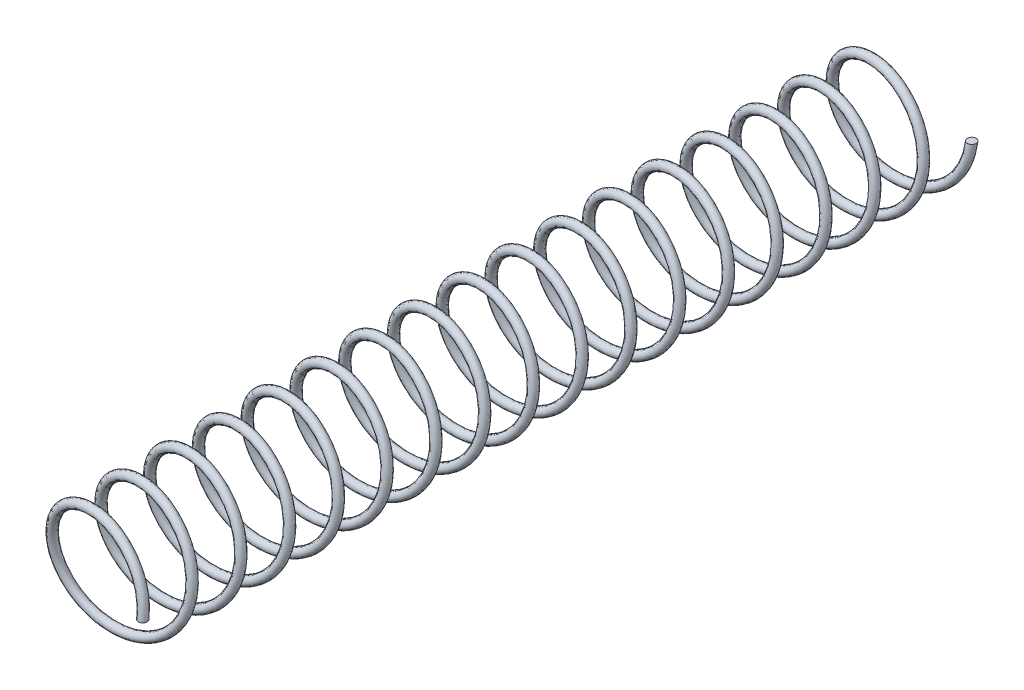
ISO-10303-21;
HEADER;
FILE_DESCRIPTION(('STEP AP214'),'2;1');
FILE_NAME('part.step','',(''),(''),'','','');
FILE_SCHEMA(('AUTOMOTIVE_DESIGN { 1 0 10303 214 1 1 1 1 }'));
ENDSEC;
DATA;
#1=APPLICATION_CONTEXT('core data for automotive mechanical design processes');
#2=APPLICATION_PROTOCOL_DEFINITION('international standard','automotive_design',2000,#1);
#3=PRODUCT_CONTEXT('',#1,'mechanical');
#4=PRODUCT('Part','Part','',(#3));
#5=PRODUCT_RELATED_PRODUCT_CATEGORY('part','',(#4));
#6=PRODUCT_DEFINITION_FORMATION('','',#4);
#7=PRODUCT_DEFINITION_CONTEXT('part definition',#1,'design');
#8=PRODUCT_DEFINITION('design','',#6,#7);
#9=PRODUCT_DEFINITION_SHAPE('','',#8);
#10=(LENGTH_UNIT() NAMED_UNIT(*) SI_UNIT(.MILLI.,.METRE.));
#11=(NAMED_UNIT(*) PLANE_ANGLE_UNIT() SI_UNIT($,.RADIAN.));
#12=(NAMED_UNIT(*) SI_UNIT($,.STERADIAN.) SOLID_ANGLE_UNIT());
#13=UNCERTAINTY_MEASURE_WITH_UNIT(LENGTH_MEASURE(1.E-05),#10,'distance_accuracy_value','');
#14=(GEOMETRIC_REPRESENTATION_CONTEXT(3) GLOBAL_UNCERTAINTY_ASSIGNED_CONTEXT((#13)) GLOBAL_UNIT_ASSIGNED_CONTEXT((#10,
#11,#12)) REPRESENTATION_CONTEXT('',''));
#15=CARTESIAN_POINT('',(0.,0.,0.));
#16=DIRECTION('',(0.,0.,1.));
#17=DIRECTION('',(1.,0.,0.));
#18=AXIS2_PLACEMENT_3D('',#15,#16,#17);
#19=CARTESIAN_POINT('',(16.,0.,0.));
#20=DIRECTION('',(0.,1.,0.));
#21=DIRECTION('',(0.,0.,1.));
#22=AXIS2_PLACEMENT_3D('',#19,#20,#21);
#23=PLANE('',#22);
#24=CARTESIAN_POINT('',(16.,0.,0.));
#25=DIRECTION('',(0.,1.,0.));
#26=DIRECTION('',(0.,0.,1.));
#27=AXIS2_PLACEMENT_3D('',#24,#25,#26);
#28=CIRCLE('',#27,1.23254957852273);
#29=CARTESIAN_POINT('',(16.,0.,1.23254957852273));
#30=VERTEX_POINT('',#29);
#31=EDGE_CURVE('E38',#30,#30,#28,.T.);
#32=ORIENTED_EDGE('',*,*,#31,.T.);
#33=EDGE_LOOP('',(#32));
#34=FACE_BOUND('',#33,.T.);
#35=ADVANCED_FACE('F31',(#34),#23,.T.);
#36=CARTESIAN_POINT('',(16.,-3.91241853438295E-12,231.5));
#37=DIRECTION('',(2.44526158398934E-13,1.,0.));
#38=DIRECTION('',(0.,0.,1.));
#39=AXIS2_PLACEMENT_3D('',#36,#37,#38);
#40=PLANE('',#39);
#41=CARTESIAN_POINT('',(16.,-3.91241853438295E-12,231.5));
#42=DIRECTION('',(2.44526158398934E-13,1.,0.));
#43=DIRECTION('',(0.,0.,1.));
#44=AXIS2_PLACEMENT_3D('',#41,#42,#43);
#45=CIRCLE('',#44,1.23254957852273);
#46=CARTESIAN_POINT('',(16.,-3.91241853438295E-12,232.732549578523));
#47=VERTEX_POINT('',#46);
#48=EDGE_CURVE('E11',#47,#47,#45,.T.);
#49=ORIENTED_EDGE('',*,*,#48,.F.);
#50=EDGE_LOOP('',(#49));
#51=FACE_BOUND('',#50,.T.);
#52=ADVANCED_FACE('F47',(#51),#40,.F.);
#53=CARTESIAN_POINT('',(16.,0.,1.23254957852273));
#54=CARTESIAN_POINT('',(16.,-6.62741699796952,2.0836525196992));
#55=CARTESIAN_POINT('',(11.3137084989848,-11.3137084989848,2.93475546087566));
#56=CARTESIAN_POINT('',(6.62741699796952,-16.,3.78585840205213));
#57=CARTESIAN_POINT('',(0.,-16.,4.6369613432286));
#58=CARTESIAN_POINT('',(-6.62741699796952,-16.,5.48806428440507));
#59=CARTESIAN_POINT('',(-11.3137084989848,-11.3137084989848,6.33916722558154));
#60=CARTESIAN_POINT('',(-16.,-6.62741699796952,7.19027016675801));
#61=CARTESIAN_POINT('',(-16.,0.,8.04137310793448));
#62=CARTESIAN_POINT('',(-16.,6.62741699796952,8.89247604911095));
#63=CARTESIAN_POINT('',(-11.3137084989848,11.3137084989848,9.74357899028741));
#64=CARTESIAN_POINT('',(-6.62741699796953,16.,10.5946819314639));
#65=CARTESIAN_POINT('',(0.,16.,11.4457848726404));
#66=CARTESIAN_POINT('',(6.62741699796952,16.,12.2968878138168));
#67=CARTESIAN_POINT('',(11.3137084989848,11.3137084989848,13.1479907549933));
#68=CARTESIAN_POINT('',(16.,6.62741699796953,13.9990936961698));
#69=CARTESIAN_POINT('',(16.,0.,14.8501966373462));
#70=CARTESIAN_POINT('',(16.,-6.62741699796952,15.7012995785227));
#71=CARTESIAN_POINT('',(11.3137084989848,-11.3137084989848,16.5524025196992));
#72=CARTESIAN_POINT('',(6.62741699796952,-16.,17.4035054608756));
#73=CARTESIAN_POINT('',(0.,-16.,18.2546084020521));
#74=CARTESIAN_POINT('',(-6.62741699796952,-16.,19.1057113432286));
#75=CARTESIAN_POINT('',(-11.3137084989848,-11.3137084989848,19.956814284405));
#76=CARTESIAN_POINT('',(-16.,-6.62741699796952,20.8079172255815));
#77=CARTESIAN_POINT('',(-16.,0.,21.659020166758));
#78=CARTESIAN_POINT('',(-16.,6.62741699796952,22.5101231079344));
#79=CARTESIAN_POINT('',(-11.3137084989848,11.3137084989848,23.3612260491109));
#80=CARTESIAN_POINT('',(-6.62741699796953,16.,24.2123289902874));
#81=CARTESIAN_POINT('',(0.,16.,25.0634319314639));
#82=CARTESIAN_POINT('',(6.62741699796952,16.,25.9145348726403));
#83=CARTESIAN_POINT('',(11.3137084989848,11.3137084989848,26.7656378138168));
#84=CARTESIAN_POINT('',(16.,6.62741699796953,27.6167407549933));
#85=CARTESIAN_POINT('',(16.,0.,28.4678436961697));
#86=CARTESIAN_POINT('',(16.,-6.62741699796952,29.3189466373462));
#87=CARTESIAN_POINT('',(11.3137084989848,-11.3137084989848,30.1700495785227));
#88=CARTESIAN_POINT('',(6.62741699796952,-16.,31.0211525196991));
#89=CARTESIAN_POINT('',(0.,-16.,31.8722554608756));
#90=CARTESIAN_POINT('',(-6.62741699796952,-16.,32.7233584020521));
#91=CARTESIAN_POINT('',(-11.3137084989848,-11.3137084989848,33.5744613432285));
#92=CARTESIAN_POINT('',(-16.,-6.62741699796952,34.425564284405));
#93=CARTESIAN_POINT('',(-16.,0.,35.2766672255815));
#94=CARTESIAN_POINT('',(-16.,6.62741699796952,36.1277701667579));
#95=CARTESIAN_POINT('',(-11.3137084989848,11.3137084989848,36.9788731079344));
#96=CARTESIAN_POINT('',(-6.62741699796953,16.,37.8299760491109));
#97=CARTESIAN_POINT('',(0.,16.,38.6810789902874));
#98=CARTESIAN_POINT('',(6.62741699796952,16.,39.5321819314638));
#99=CARTESIAN_POINT('',(11.3137084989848,11.3137084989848,40.3832848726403));
#100=CARTESIAN_POINT('',(16.,6.62741699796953,41.2343878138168));
#101=CARTESIAN_POINT('',(16.,0.,42.0854907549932));
#102=CARTESIAN_POINT('',(16.,-6.62741699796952,42.9365936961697));
#103=CARTESIAN_POINT('',(11.3137084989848,-11.3137084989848,43.7876966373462));
#104=CARTESIAN_POINT('',(6.62741699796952,-16.,44.6387995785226));
#105=CARTESIAN_POINT('',(0.,-16.,45.4899025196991));
#106=CARTESIAN_POINT('',(-6.62741699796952,-16.,46.3410054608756));
#107=CARTESIAN_POINT('',(-11.3137084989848,-11.3137084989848,47.192108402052));
#108=CARTESIAN_POINT('',(-16.,-6.62741699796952,48.0432113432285));
#109=CARTESIAN_POINT('',(-16.,0.,48.894314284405));
#110=CARTESIAN_POINT('',(-16.,6.62741699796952,49.7454172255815));
#111=CARTESIAN_POINT('',(-11.3137084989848,11.3137084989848,50.5965201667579));
#112=CARTESIAN_POINT('',(-6.62741699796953,16.,51.4476231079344));
#113=CARTESIAN_POINT('',(0.,16.,52.2987260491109));
#114=CARTESIAN_POINT('',(6.62741699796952,16.,53.1498289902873));
#115=CARTESIAN_POINT('',(11.3137084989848,11.3137084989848,54.0009319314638));
#116=CARTESIAN_POINT('',(16.,6.62741699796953,54.8520348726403));
#117=CARTESIAN_POINT('',(16.,0.,55.7031378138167));
#118=CARTESIAN_POINT('',(16.,-6.62741699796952,56.5542407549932));
#119=CARTESIAN_POINT('',(11.3137084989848,-11.3137084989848,57.4053436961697));
#120=CARTESIAN_POINT('',(6.62741699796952,-16.,58.2564466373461));
#121=CARTESIAN_POINT('',(0.,-16.,59.1075495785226));
#122=CARTESIAN_POINT('',(-6.62741699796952,-16.,59.9586525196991));
#123=CARTESIAN_POINT('',(-11.3137084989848,-11.3137084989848,60.8097554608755));
#124=CARTESIAN_POINT('',(-16.,-6.62741699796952,61.660858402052));
#125=CARTESIAN_POINT('',(-16.,0.,62.5119613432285));
#126=CARTESIAN_POINT('',(-16.,6.62741699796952,63.363064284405));
#127=CARTESIAN_POINT('',(-11.3137084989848,11.3137084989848,64.2141672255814));
#128=CARTESIAN_POINT('',(-6.62741699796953,16.,65.0652701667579));
#129=CARTESIAN_POINT('',(0.,16.,65.9163731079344));
#130=CARTESIAN_POINT('',(6.62741699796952,16.,66.7674760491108));
#131=CARTESIAN_POINT('',(11.3137084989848,11.3137084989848,67.6185789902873));
#132=CARTESIAN_POINT('',(16.,6.62741699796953,68.4696819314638));
#133=CARTESIAN_POINT('',(16.,0.,69.3207848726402));
#134=CARTESIAN_POINT('',(16.,-6.62741699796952,70.1718878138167));
#135=CARTESIAN_POINT('',(11.3137084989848,-11.3137084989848,71.0229907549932));
#136=CARTESIAN_POINT('',(6.62741699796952,-16.,71.8740936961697));
#137=CARTESIAN_POINT('',(0.,-16.,72.7251966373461));
#138=CARTESIAN_POINT('',(-6.62741699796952,-16.,73.5762995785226));
#139=CARTESIAN_POINT('',(-11.3137084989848,-11.3137084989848,74.4274025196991));
#140=CARTESIAN_POINT('',(-16.,-6.62741699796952,75.2785054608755));
#141=CARTESIAN_POINT('',(-16.,0.,76.129608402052));
#142=CARTESIAN_POINT('',(-16.,6.62741699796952,76.9807113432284));
#143=CARTESIAN_POINT('',(-11.3137084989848,11.3137084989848,77.8318142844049));
#144=CARTESIAN_POINT('',(-6.62741699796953,16.,78.6829172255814));
#145=CARTESIAN_POINT('',(0.,16.,79.5340201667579));
#146=CARTESIAN_POINT('',(6.62741699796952,16.,80.3851231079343));
#147=CARTESIAN_POINT('',(11.3137084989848,11.3137084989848,81.2362260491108));
#148=CARTESIAN_POINT('',(16.,6.62741699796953,82.0873289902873));
#149=CARTESIAN_POINT('',(16.,0.,82.9384319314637));
#150=CARTESIAN_POINT('',(16.,-6.62741699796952,83.7895348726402));
#151=CARTESIAN_POINT('',(11.3137084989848,-11.3137084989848,84.6406378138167));
#152=CARTESIAN_POINT('',(6.62741699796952,-16.,85.4917407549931));
#153=CARTESIAN_POINT('',(0.,-16.,86.3428436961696));
#154=CARTESIAN_POINT('',(-6.62741699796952,-16.,87.1939466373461));
#155=CARTESIAN_POINT('',(-11.3137084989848,-11.3137084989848,88.0450495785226));
#156=CARTESIAN_POINT('',(-16.,-6.62741699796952,88.896152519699));
#157=CARTESIAN_POINT('',(-16.,0.,89.7472554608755));
#158=CARTESIAN_POINT('',(-16.,6.62741699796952,90.598358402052));
#159=CARTESIAN_POINT('',(-11.3137084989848,11.3137084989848,91.4494613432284));
#160=CARTESIAN_POINT('',(-6.62741699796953,16.,92.3005642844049));
#161=CARTESIAN_POINT('',(0.,16.,93.1516672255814));
#162=CARTESIAN_POINT('',(6.62741699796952,16.,94.0027701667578));
#163=CARTESIAN_POINT('',(11.3137084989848,11.3137084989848,94.8538731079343));
#164=CARTESIAN_POINT('',(16.,6.62741699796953,95.7049760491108));
#165=CARTESIAN_POINT('',(16.,0.,96.5560789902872));
#166=CARTESIAN_POINT('',(16.,-6.62741699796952,97.4071819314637));
#167=CARTESIAN_POINT('',(11.3137084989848,-11.3137084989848,98.2582848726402));
#168=CARTESIAN_POINT('',(6.62741699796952,-16.,99.1093878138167));
#169=CARTESIAN_POINT('',(0.,-16.,99.9604907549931));
#170=CARTESIAN_POINT('',(-6.62741699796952,-16.,100.81159369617));
#171=CARTESIAN_POINT('',(-11.3137084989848,-11.3137084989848,101.662696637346));
#172=CARTESIAN_POINT('',(-16.,-6.62741699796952,102.513799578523));
#173=CARTESIAN_POINT('',(-16.,0.,103.364902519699));
#174=CARTESIAN_POINT('',(-16.,6.62741699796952,104.216005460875));
#175=CARTESIAN_POINT('',(-11.3137084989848,11.3137084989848,105.067108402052));
#176=CARTESIAN_POINT('',(-6.62741699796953,16.,105.918211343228));
#177=CARTESIAN_POINT('',(0.,16.,106.769314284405));
#178=CARTESIAN_POINT('',(6.62741699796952,16.,107.620417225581));
#179=CARTESIAN_POINT('',(11.3137084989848,11.3137084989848,108.471520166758));
#180=CARTESIAN_POINT('',(16.,6.62741699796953,109.322623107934));
#181=CARTESIAN_POINT('',(16.,0.,110.173726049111));
#182=CARTESIAN_POINT('',(16.,-6.62741699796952,111.024828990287));
#183=CARTESIAN_POINT('',(11.3137084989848,-11.3137084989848,111.875931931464));
#184=CARTESIAN_POINT('',(6.62741699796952,-16.,112.72703487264));
#185=CARTESIAN_POINT('',(0.,-16.,113.578137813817));
#186=CARTESIAN_POINT('',(-6.62741699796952,-16.,114.429240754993));
#187=CARTESIAN_POINT('',(-11.3137084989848,-11.3137084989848,115.28034369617));
#188=CARTESIAN_POINT('',(-16.,-6.62741699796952,116.131446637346));
#189=CARTESIAN_POINT('',(-16.,0.,116.982549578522));
#190=CARTESIAN_POINT('',(-16.,6.62741699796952,117.833652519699));
#191=CARTESIAN_POINT('',(-11.3137084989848,11.3137084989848,118.684755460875));
#192=CARTESIAN_POINT('',(-6.62741699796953,16.,119.535858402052));
#193=CARTESIAN_POINT('',(0.,16.,120.386961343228));
#194=CARTESIAN_POINT('',(6.62741699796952,16.,121.238064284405));
#195=CARTESIAN_POINT('',(11.3137084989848,11.3137084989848,122.089167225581));
#196=CARTESIAN_POINT('',(16.,6.62741699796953,122.940270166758));
#197=CARTESIAN_POINT('',(16.,0.,123.791373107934));
#198=CARTESIAN_POINT('',(16.,-6.62741699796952,124.642476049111));
#199=CARTESIAN_POINT('',(11.3137084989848,-11.3137084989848,125.493578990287));
#200=CARTESIAN_POINT('',(6.62741699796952,-16.,126.344681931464));
#201=CARTESIAN_POINT('',(0.,-16.,127.19578487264));
#202=CARTESIAN_POINT('',(-6.62741699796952,-16.,128.046887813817));
#203=CARTESIAN_POINT('',(-11.3137084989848,-11.3137084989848,128.897990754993));
#204=CARTESIAN_POINT('',(-16.,-6.62741699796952,129.74909369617));
#205=CARTESIAN_POINT('',(-16.,0.,130.600196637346));
#206=CARTESIAN_POINT('',(-16.,6.62741699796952,131.451299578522));
#207=CARTESIAN_POINT('',(-11.3137084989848,11.3137084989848,132.302402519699));
#208=CARTESIAN_POINT('',(-6.62741699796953,16.,133.153505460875));
#209=CARTESIAN_POINT('',(0.,16.,134.004608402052));
#210=CARTESIAN_POINT('',(6.62741699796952,16.,134.855711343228));
#211=CARTESIAN_POINT('',(11.3137084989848,11.3137084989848,135.706814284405));
#212=CARTESIAN_POINT('',(16.,6.62741699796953,136.557917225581));
#213=CARTESIAN_POINT('',(16.,0.,137.409020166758));
#214=CARTESIAN_POINT('',(16.,-6.62741699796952,138.260123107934));
#215=CARTESIAN_POINT('',(11.3137084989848,-11.3137084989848,139.111226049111));
#216=CARTESIAN_POINT('',(6.62741699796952,-16.,139.962328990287));
#217=CARTESIAN_POINT('',(0.,-16.,140.813431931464));
#218=CARTESIAN_POINT('',(-6.62741699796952,-16.,141.66453487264));
#219=CARTESIAN_POINT('',(-11.3137084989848,-11.3137084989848,142.515637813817));
#220=CARTESIAN_POINT('',(-16.,-6.62741699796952,143.366740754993));
#221=CARTESIAN_POINT('',(-16.,0.,144.217843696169));
#222=CARTESIAN_POINT('',(-16.,6.62741699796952,145.068946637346));
#223=CARTESIAN_POINT('',(-11.3137084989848,11.3137084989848,145.920049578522));
#224=CARTESIAN_POINT('',(-6.62741699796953,16.,146.771152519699));
#225=CARTESIAN_POINT('',(0.,16.,147.622255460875));
#226=CARTESIAN_POINT('',(6.62741699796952,16.,148.473358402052));
#227=CARTESIAN_POINT('',(11.3137084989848,11.3137084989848,149.324461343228));
#228=CARTESIAN_POINT('',(16.,6.62741699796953,150.175564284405));
#229=CARTESIAN_POINT('',(16.,0.,151.026667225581));
#230=CARTESIAN_POINT('',(16.,-6.62741699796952,151.877770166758));
#231=CARTESIAN_POINT('',(11.3137084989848,-11.3137084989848,152.728873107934));
#232=CARTESIAN_POINT('',(6.62741699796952,-16.,153.579976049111));
#233=CARTESIAN_POINT('',(0.,-16.,154.431078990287));
#234=CARTESIAN_POINT('',(-6.62741699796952,-16.,155.282181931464));
#235=CARTESIAN_POINT('',(-11.3137084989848,-11.3137084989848,156.13328487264));
#236=CARTESIAN_POINT('',(-16.,-6.62741699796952,156.984387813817));
#237=CARTESIAN_POINT('',(-16.,0.,157.835490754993));
#238=CARTESIAN_POINT('',(-16.,6.62741699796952,158.686593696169));
#239=CARTESIAN_POINT('',(-11.3137084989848,11.3137084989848,159.537696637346));
#240=CARTESIAN_POINT('',(-6.62741699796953,16.,160.388799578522));
#241=CARTESIAN_POINT('',(0.,16.,161.239902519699));
#242=CARTESIAN_POINT('',(6.62741699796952,16.,162.091005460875));
#243=CARTESIAN_POINT('',(11.3137084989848,11.3137084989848,162.942108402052));
#244=CARTESIAN_POINT('',(16.,6.62741699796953,163.793211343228));
#245=CARTESIAN_POINT('',(16.,0.,164.644314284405));
#246=CARTESIAN_POINT('',(16.,-6.62741699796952,165.495417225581));
#247=CARTESIAN_POINT('',(11.3137084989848,-11.3137084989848,166.346520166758));
#248=CARTESIAN_POINT('',(6.62741699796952,-16.,167.197623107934));
#249=CARTESIAN_POINT('',(0.,-16.,168.048726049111));
#250=CARTESIAN_POINT('',(-6.62741699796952,-16.,168.899828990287));
#251=CARTESIAN_POINT('',(-11.3137084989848,-11.3137084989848,169.750931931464));
#252=CARTESIAN_POINT('',(-16.,-6.62741699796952,170.60203487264));
#253=CARTESIAN_POINT('',(-16.,0.,171.453137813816));
#254=CARTESIAN_POINT('',(-16.,6.62741699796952,172.304240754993));
#255=CARTESIAN_POINT('',(-11.3137084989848,11.3137084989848,173.155343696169));
#256=CARTESIAN_POINT('',(-6.62741699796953,16.,174.006446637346));
#257=CARTESIAN_POINT('',(0.,16.,174.857549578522));
#258=CARTESIAN_POINT('',(6.62741699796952,16.,175.708652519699));
#259=CARTESIAN_POINT('',(11.3137084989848,11.3137084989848,176.559755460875));
#260=CARTESIAN_POINT('',(16.,6.62741699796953,177.410858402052));
#261=CARTESIAN_POINT('',(16.,0.,178.261961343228));
#262=CARTESIAN_POINT('',(16.,-6.62741699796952,179.113064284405));
#263=CARTESIAN_POINT('',(11.3137084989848,-11.3137084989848,179.964167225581));
#264=CARTESIAN_POINT('',(6.62741699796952,-16.,180.815270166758));
#265=CARTESIAN_POINT('',(0.,-16.,181.666373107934));
#266=CARTESIAN_POINT('',(-6.62741699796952,-16.,182.517476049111));
#267=CARTESIAN_POINT('',(-11.3137084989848,-11.3137084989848,183.368578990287));
#268=CARTESIAN_POINT('',(-16.,-6.62741699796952,184.219681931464));
#269=CARTESIAN_POINT('',(-16.,0.,185.07078487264));
#270=CARTESIAN_POINT('',(-16.,6.62741699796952,185.921887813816));
#271=CARTESIAN_POINT('',(-11.3137084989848,11.3137084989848,186.772990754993));
#272=CARTESIAN_POINT('',(-6.62741699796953,16.,187.624093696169));
#273=CARTESIAN_POINT('',(0.,16.,188.475196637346));
#274=CARTESIAN_POINT('',(6.62741699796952,16.,189.326299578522));
#275=CARTESIAN_POINT('',(11.3137084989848,11.3137084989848,190.177402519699));
#276=CARTESIAN_POINT('',(16.,6.62741699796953,191.028505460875));
#277=CARTESIAN_POINT('',(16.,0.,191.879608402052));
#278=CARTESIAN_POINT('',(16.,-6.62741699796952,192.730711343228));
#279=CARTESIAN_POINT('',(11.3137084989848,-11.3137084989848,193.581814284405));
#280=CARTESIAN_POINT('',(6.62741699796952,-16.,194.432917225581));
#281=CARTESIAN_POINT('',(0.,-16.,195.284020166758));
#282=CARTESIAN_POINT('',(-6.62741699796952,-16.,196.135123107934));
#283=CARTESIAN_POINT('',(-11.3137084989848,-11.3137084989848,196.986226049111));
#284=CARTESIAN_POINT('',(-16.,-6.62741699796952,197.837328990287));
#285=CARTESIAN_POINT('',(-16.,0.,198.688431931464));
#286=CARTESIAN_POINT('',(-16.,6.62741699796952,199.53953487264));
#287=CARTESIAN_POINT('',(-11.3137084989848,11.3137084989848,200.390637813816));
#288=CARTESIAN_POINT('',(-6.62741699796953,16.,201.241740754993));
#289=CARTESIAN_POINT('',(0.,16.,202.092843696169));
#290=CARTESIAN_POINT('',(6.62741699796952,16.,202.943946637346));
#291=CARTESIAN_POINT('',(11.3137084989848,11.3137084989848,203.795049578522));
#292=CARTESIAN_POINT('',(16.,6.62741699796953,204.646152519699));
#293=CARTESIAN_POINT('',(16.,0.,205.497255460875));
#294=CARTESIAN_POINT('',(16.,-6.62741699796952,206.348358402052));
#295=CARTESIAN_POINT('',(11.3137084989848,-11.3137084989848,207.199461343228));
#296=CARTESIAN_POINT('',(6.62741699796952,-16.,208.050564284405));
#297=CARTESIAN_POINT('',(0.,-16.,208.901667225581));
#298=CARTESIAN_POINT('',(-6.62741699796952,-16.,209.752770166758));
#299=CARTESIAN_POINT('',(-11.3137084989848,-11.3137084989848,210.603873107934));
#300=CARTESIAN_POINT('',(-16.,-6.62741699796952,211.454976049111));
#301=CARTESIAN_POINT('',(-16.,0.,212.306078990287));
#302=CARTESIAN_POINT('',(-16.,6.62741699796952,213.157181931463));
#303=CARTESIAN_POINT('',(-11.3137084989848,11.3137084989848,214.00828487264));
#304=CARTESIAN_POINT('',(-6.62741699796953,16.,214.859387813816));
#305=CARTESIAN_POINT('',(0.,16.,215.710490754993));
#306=CARTESIAN_POINT('',(6.62741699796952,16.,216.561593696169));
#307=CARTESIAN_POINT('',(11.3137084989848,11.3137084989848,217.412696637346));
#308=CARTESIAN_POINT('',(16.,6.62741699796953,218.263799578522));
#309=CARTESIAN_POINT('',(16.,0.,219.114902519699));
#310=CARTESIAN_POINT('',(16.,-6.62741699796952,219.966005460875));
#311=CARTESIAN_POINT('',(11.3137084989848,-11.3137084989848,220.817108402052));
#312=CARTESIAN_POINT('',(6.62741699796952,-16.,221.668211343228));
#313=CARTESIAN_POINT('',(0.,-16.,222.519314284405));
#314=CARTESIAN_POINT('',(-6.62741699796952,-16.,223.370417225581));
#315=CARTESIAN_POINT('',(-11.3137084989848,-11.3137084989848,224.221520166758));
#316=CARTESIAN_POINT('',(-16.,-6.62741699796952,225.072623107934));
#317=CARTESIAN_POINT('',(-16.,0.,225.923726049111));
#318=CARTESIAN_POINT('',(-16.,6.62741699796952,226.774828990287));
#319=CARTESIAN_POINT('',(-11.3137084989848,11.3137084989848,227.625931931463));
#320=CARTESIAN_POINT('',(-6.62741699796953,16.,228.47703487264));
#321=CARTESIAN_POINT('',(0.,16.,229.328137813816));
#322=CARTESIAN_POINT('',(6.62741699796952,16.,230.179240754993));
#323=CARTESIAN_POINT('',(11.3137084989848,11.3137084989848,231.030343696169));
#324=CARTESIAN_POINT('',(16.,6.62741699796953,231.881446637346));
#325=CARTESIAN_POINT('',(16.,0.,232.732549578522));
#326=CARTESIAN_POINT('',(16.,-6.62741699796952,233.583652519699));
#327=CARTESIAN_POINT('',(11.3137084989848,-11.3137084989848,234.434755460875));
#328=CARTESIAN_POINT('',(6.62741699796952,-16.,235.285858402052));
#329=CARTESIAN_POINT('',(0.,-16.,236.136961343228));
#330=CARTESIAN_POINT('',(-6.62741699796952,-16.,236.988064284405));
#331=CARTESIAN_POINT('',(-11.3137084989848,-11.3137084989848,237.839167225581));
#332=CARTESIAN_POINT('',(-16.,-6.62741699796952,238.690270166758));
#333=CARTESIAN_POINT('',(-16.,0.,239.541373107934));
#334=CARTESIAN_POINT('',(-16.,6.62741699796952,240.39247604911));
#335=CARTESIAN_POINT('',(-11.3137084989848,11.3137084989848,241.243578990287));
#336=CARTESIAN_POINT('',(-6.62741699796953,16.,242.094681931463));
#337=CARTESIAN_POINT('',(0.,16.,242.94578487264));
#338=CARTESIAN_POINT('',(6.62741699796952,16.,243.796887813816));
#339=CARTESIAN_POINT('',(11.3137084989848,11.3137084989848,244.647990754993));
#340=CARTESIAN_POINT('',(16.,6.62741699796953,245.499093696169));
#341=CARTESIAN_POINT('',(16.,0.,246.350196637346));
#342=CARTESIAN_POINT('',(18.4650991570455,0.,1.23254957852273));
#343=CARTESIAN_POINT('',(18.4650991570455,-7.64849450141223,2.0836525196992));
#344=CARTESIAN_POINT('',(13.0567968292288,-13.0567968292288,2.93475546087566));
#345=CARTESIAN_POINT('',(7.64849450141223,-18.4650991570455,3.78585840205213));
#346=CARTESIAN_POINT('',(0.,-18.4650991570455,4.6369613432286));
#347=CARTESIAN_POINT('',(-7.64849450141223,-18.4650991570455,5.48806428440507));
#348=CARTESIAN_POINT('',(-13.0567968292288,-13.0567968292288,6.33916722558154));
#349=CARTESIAN_POINT('',(-18.4650991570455,-7.64849450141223,7.19027016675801));
#350=CARTESIAN_POINT('',(-18.4650991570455,0.,8.04137310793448));
#351=CARTESIAN_POINT('',(-18.4650991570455,7.64849450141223,8.89247604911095));
#352=CARTESIAN_POINT('',(-13.0567968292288,13.0567968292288,9.74357899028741));
#353=CARTESIAN_POINT('',(-7.64849450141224,18.4650991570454,10.5946819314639));
#354=CARTESIAN_POINT('',(0.,18.4650991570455,11.4457848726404));
#355=CARTESIAN_POINT('',(7.64849450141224,18.4650991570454,12.2968878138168));
#356=CARTESIAN_POINT('',(13.0567968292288,13.0567968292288,13.1479907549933));
#357=CARTESIAN_POINT('',(18.4650991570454,7.64849450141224,13.9990936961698));
#358=CARTESIAN_POINT('',(18.4650991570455,0.,14.8501966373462));
#359=CARTESIAN_POINT('',(18.4650991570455,-7.64849450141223,15.7012995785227));
#360=CARTESIAN_POINT('',(13.0567968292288,-13.0567968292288,16.5524025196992));
#361=CARTESIAN_POINT('',(7.64849450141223,-18.4650991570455,17.4035054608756));
#362=CARTESIAN_POINT('',(0.,-18.4650991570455,18.2546084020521));
#363=CARTESIAN_POINT('',(-7.64849450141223,-18.4650991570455,19.1057113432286));
#364=CARTESIAN_POINT('',(-13.0567968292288,-13.0567968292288,19.956814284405));
#365=CARTESIAN_POINT('',(-18.4650991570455,-7.64849450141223,20.8079172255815));
#366=CARTESIAN_POINT('',(-18.4650991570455,0.,21.659020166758));
#367=CARTESIAN_POINT('',(-18.4650991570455,7.64849450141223,22.5101231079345));
#368=CARTESIAN_POINT('',(-13.0567968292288,13.0567968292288,23.3612260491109));
#369=CARTESIAN_POINT('',(-7.64849450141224,18.4650991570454,24.2123289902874));
#370=CARTESIAN_POINT('',(0.,18.4650991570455,25.0634319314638));
#371=CARTESIAN_POINT('',(7.64849450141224,18.4650991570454,25.9145348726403));
#372=CARTESIAN_POINT('',(13.0567968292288,13.0567968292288,26.7656378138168));
#373=CARTESIAN_POINT('',(18.4650991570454,7.64849450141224,27.6167407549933));
#374=CARTESIAN_POINT('',(18.4650991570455,0.,28.4678436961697));
#375=CARTESIAN_POINT('',(18.4650991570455,-7.64849450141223,29.3189466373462));
#376=CARTESIAN_POINT('',(13.0567968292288,-13.0567968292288,30.1700495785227));
#377=CARTESIAN_POINT('',(7.64849450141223,-18.4650991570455,31.0211525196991));
#378=CARTESIAN_POINT('',(0.,-18.4650991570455,31.8722554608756));
#379=CARTESIAN_POINT('',(-7.64849450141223,-18.4650991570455,32.7233584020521));
#380=CARTESIAN_POINT('',(-13.0567968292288,-13.0567968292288,33.5744613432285));
#381=CARTESIAN_POINT('',(-18.4650991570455,-7.64849450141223,34.425564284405));
#382=CARTESIAN_POINT('',(-18.4650991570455,0.,35.2766672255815));
#383=CARTESIAN_POINT('',(-18.4650991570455,7.64849450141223,36.1277701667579));
#384=CARTESIAN_POINT('',(-13.0567968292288,13.0567968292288,36.9788731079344));
#385=CARTESIAN_POINT('',(-7.64849450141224,18.4650991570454,37.8299760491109));
#386=CARTESIAN_POINT('',(0.,18.4650991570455,38.6810789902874));
#387=CARTESIAN_POINT('',(7.64849450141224,18.4650991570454,39.5321819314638));
#388=CARTESIAN_POINT('',(13.0567968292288,13.0567968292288,40.3832848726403));
#389=CARTESIAN_POINT('',(18.4650991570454,7.64849450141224,41.2343878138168));
#390=CARTESIAN_POINT('',(18.4650991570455,0.,42.0854907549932));
#391=CARTESIAN_POINT('',(18.4650991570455,-7.64849450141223,42.9365936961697));
#392=CARTESIAN_POINT('',(13.0567968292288,-13.0567968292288,43.7876966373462));
#393=CARTESIAN_POINT('',(7.64849450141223,-18.4650991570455,44.6387995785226));
#394=CARTESIAN_POINT('',(0.,-18.4650991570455,45.4899025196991));
#395=CARTESIAN_POINT('',(-7.64849450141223,-18.4650991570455,46.3410054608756));
#396=CARTESIAN_POINT('',(-13.0567968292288,-13.0567968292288,47.192108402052));
#397=CARTESIAN_POINT('',(-18.4650991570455,-7.64849450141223,48.0432113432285));
#398=CARTESIAN_POINT('',(-18.4650991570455,0.,48.894314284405));
#399=CARTESIAN_POINT('',(-18.4650991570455,7.64849450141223,49.7454172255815));
#400=CARTESIAN_POINT('',(-13.0567968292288,13.0567968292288,50.5965201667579));
#401=CARTESIAN_POINT('',(-7.64849450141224,18.4650991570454,51.4476231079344));
#402=CARTESIAN_POINT('',(0.,18.4650991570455,52.2987260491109));
#403=CARTESIAN_POINT('',(7.64849450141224,18.4650991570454,53.1498289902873));
#404=CARTESIAN_POINT('',(13.0567968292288,13.0567968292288,54.0009319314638));
#405=CARTESIAN_POINT('',(18.4650991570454,7.64849450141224,54.8520348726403));
#406=CARTESIAN_POINT('',(18.4650991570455,0.,55.7031378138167));
#407=CARTESIAN_POINT('',(18.4650991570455,-7.64849450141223,56.5542407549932));
#408=CARTESIAN_POINT('',(13.0567968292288,-13.0567968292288,57.4053436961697));
#409=CARTESIAN_POINT('',(7.64849450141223,-18.4650991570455,58.2564466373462));
#410=CARTESIAN_POINT('',(0.,-18.4650991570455,59.1075495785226));
#411=CARTESIAN_POINT('',(-7.64849450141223,-18.4650991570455,59.9586525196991));
#412=CARTESIAN_POINT('',(-13.0567968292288,-13.0567968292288,60.8097554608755));
#413=CARTESIAN_POINT('',(-18.4650991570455,-7.64849450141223,61.660858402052));
#414=CARTESIAN_POINT('',(-18.4650991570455,0.,62.5119613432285));
#415=CARTESIAN_POINT('',(-18.4650991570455,7.64849450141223,63.363064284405));
#416=CARTESIAN_POINT('',(-13.0567968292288,13.0567968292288,64.2141672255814));
#417=CARTESIAN_POINT('',(-7.64849450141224,18.4650991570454,65.0652701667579));
#418=CARTESIAN_POINT('',(0.,18.4650991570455,65.9163731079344));
#419=CARTESIAN_POINT('',(7.64849450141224,18.4650991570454,66.7674760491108));
#420=CARTESIAN_POINT('',(13.0567968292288,13.0567968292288,67.6185789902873));
#421=CARTESIAN_POINT('',(18.4650991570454,7.64849450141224,68.4696819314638));
#422=CARTESIAN_POINT('',(18.4650991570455,0.,69.3207848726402));
#423=CARTESIAN_POINT('',(18.4650991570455,-7.64849450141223,70.1718878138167));
#424=CARTESIAN_POINT('',(13.0567968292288,-13.0567968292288,71.0229907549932));
#425=CARTESIAN_POINT('',(7.64849450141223,-18.4650991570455,71.8740936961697));
#426=CARTESIAN_POINT('',(0.,-18.4650991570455,72.7251966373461));
#427=CARTESIAN_POINT('',(-7.64849450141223,-18.4650991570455,73.5762995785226));
#428=CARTESIAN_POINT('',(-13.0567968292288,-13.0567968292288,74.4274025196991));
#429=CARTESIAN_POINT('',(-18.4650991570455,-7.64849450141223,75.2785054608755));
#430=CARTESIAN_POINT('',(-18.4650991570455,0.,76.129608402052));
#431=CARTESIAN_POINT('',(-18.4650991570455,7.64849450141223,76.9807113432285));
#432=CARTESIAN_POINT('',(-13.0567968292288,13.0567968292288,77.8318142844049));
#433=CARTESIAN_POINT('',(-7.64849450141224,18.4650991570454,78.6829172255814));
#434=CARTESIAN_POINT('',(0.,18.4650991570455,79.5340201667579));
#435=CARTESIAN_POINT('',(7.64849450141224,18.4650991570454,80.3851231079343));
#436=CARTESIAN_POINT('',(13.0567968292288,13.0567968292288,81.2362260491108));
#437=CARTESIAN_POINT('',(18.4650991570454,7.64849450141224,82.0873289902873));
#438=CARTESIAN_POINT('',(18.4650991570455,0.,82.9384319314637));
#439=CARTESIAN_POINT('',(18.4650991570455,-7.64849450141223,83.7895348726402));
#440=CARTESIAN_POINT('',(13.0567968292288,-13.0567968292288,84.6406378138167));
#441=CARTESIAN_POINT('',(7.64849450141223,-18.4650991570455,85.4917407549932));
#442=CARTESIAN_POINT('',(0.,-18.4650991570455,86.3428436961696));
#443=CARTESIAN_POINT('',(-7.64849450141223,-18.4650991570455,87.1939466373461));
#444=CARTESIAN_POINT('',(-13.0567968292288,-13.0567968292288,88.0450495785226));
#445=CARTESIAN_POINT('',(-18.4650991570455,-7.64849450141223,88.896152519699));
#446=CARTESIAN_POINT('',(-18.4650991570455,0.,89.7472554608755));
#447=CARTESIAN_POINT('',(-18.4650991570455,7.64849450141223,90.598358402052));
#448=CARTESIAN_POINT('',(-13.0567968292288,13.0567968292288,91.4494613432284));
#449=CARTESIAN_POINT('',(-7.64849450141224,18.4650991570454,92.3005642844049));
#450=CARTESIAN_POINT('',(0.,18.4650991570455,93.1516672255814));
#451=CARTESIAN_POINT('',(7.64849450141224,18.4650991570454,94.0027701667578));
#452=CARTESIAN_POINT('',(13.0567968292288,13.0567968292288,94.8538731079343));
#453=CARTESIAN_POINT('',(18.4650991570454,7.64849450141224,95.7049760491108));
#454=CARTESIAN_POINT('',(18.4650991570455,0.,96.5560789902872));
#455=CARTESIAN_POINT('',(18.4650991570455,-7.64849450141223,97.4071819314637));
#456=CARTESIAN_POINT('',(13.0567968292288,-13.0567968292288,98.2582848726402));
#457=CARTESIAN_POINT('',(7.64849450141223,-18.4650991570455,99.1093878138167));
#458=CARTESIAN_POINT('',(0.,-18.4650991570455,99.9604907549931));
#459=CARTESIAN_POINT('',(-7.64849450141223,-18.4650991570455,100.81159369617));
#460=CARTESIAN_POINT('',(-13.0567968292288,-13.0567968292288,101.662696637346));
#461=CARTESIAN_POINT('',(-18.4650991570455,-7.64849450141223,102.513799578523));
#462=CARTESIAN_POINT('',(-18.4650991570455,0.,103.364902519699));
#463=CARTESIAN_POINT('',(-18.4650991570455,7.64849450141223,104.216005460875));
#464=CARTESIAN_POINT('',(-13.0567968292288,13.0567968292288,105.067108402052));
#465=CARTESIAN_POINT('',(-7.64849450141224,18.4650991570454,105.918211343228));
#466=CARTESIAN_POINT('',(0.,18.4650991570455,106.769314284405));
#467=CARTESIAN_POINT('',(7.64849450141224,18.4650991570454,107.620417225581));
#468=CARTESIAN_POINT('',(13.0567968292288,13.0567968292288,108.471520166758));
#469=CARTESIAN_POINT('',(18.4650991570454,7.64849450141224,109.322623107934));
#470=CARTESIAN_POINT('',(18.4650991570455,0.,110.173726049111));
#471=CARTESIAN_POINT('',(18.4650991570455,-7.64849450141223,111.024828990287));
#472=CARTESIAN_POINT('',(13.0567968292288,-13.0567968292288,111.875931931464));
#473=CARTESIAN_POINT('',(7.64849450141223,-18.4650991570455,112.72703487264));
#474=CARTESIAN_POINT('',(0.,-18.4650991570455,113.578137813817));
#475=CARTESIAN_POINT('',(-7.64849450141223,-18.4650991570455,114.429240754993));
#476=CARTESIAN_POINT('',(-13.0567968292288,-13.0567968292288,115.28034369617));
#477=CARTESIAN_POINT('',(-18.4650991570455,-7.64849450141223,116.131446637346));
#478=CARTESIAN_POINT('',(-18.4650991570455,0.,116.982549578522));
#479=CARTESIAN_POINT('',(-18.4650991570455,7.64849450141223,117.833652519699));
#480=CARTESIAN_POINT('',(-13.0567968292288,13.0567968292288,118.684755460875));
#481=CARTESIAN_POINT('',(-7.64849450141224,18.4650991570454,119.535858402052));
#482=CARTESIAN_POINT('',(0.,18.4650991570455,120.386961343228));
#483=CARTESIAN_POINT('',(7.64849450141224,18.4650991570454,121.238064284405));
#484=CARTESIAN_POINT('',(13.0567968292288,13.0567968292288,122.089167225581));
#485=CARTESIAN_POINT('',(18.4650991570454,7.64849450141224,122.940270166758));
#486=CARTESIAN_POINT('',(18.4650991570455,0.,123.791373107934));
#487=CARTESIAN_POINT('',(18.4650991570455,-7.64849450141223,124.642476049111));
#488=CARTESIAN_POINT('',(13.0567968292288,-13.0567968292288,125.493578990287));
#489=CARTESIAN_POINT('',(7.64849450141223,-18.4650991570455,126.344681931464));
#490=CARTESIAN_POINT('',(0.,-18.4650991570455,127.19578487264));
#491=CARTESIAN_POINT('',(-7.64849450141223,-18.4650991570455,128.046887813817));
#492=CARTESIAN_POINT('',(-13.0567968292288,-13.0567968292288,128.897990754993));
#493=CARTESIAN_POINT('',(-18.4650991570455,-7.64849450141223,129.74909369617));
#494=CARTESIAN_POINT('',(-18.4650991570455,0.,130.600196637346));
#495=CARTESIAN_POINT('',(-18.4650991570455,7.64849450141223,131.451299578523));
#496=CARTESIAN_POINT('',(-13.0567968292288,13.0567968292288,132.302402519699));
#497=CARTESIAN_POINT('',(-7.64849450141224,18.4650991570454,133.153505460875));
#498=CARTESIAN_POINT('',(0.,18.4650991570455,134.004608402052));
#499=CARTESIAN_POINT('',(7.64849450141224,18.4650991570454,134.855711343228));
#500=CARTESIAN_POINT('',(13.0567968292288,13.0567968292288,135.706814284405));
#501=CARTESIAN_POINT('',(18.4650991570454,7.64849450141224,136.557917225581));
#502=CARTESIAN_POINT('',(18.4650991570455,0.,137.409020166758));
#503=CARTESIAN_POINT('',(18.4650991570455,-7.64849450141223,138.260123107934));
#504=CARTESIAN_POINT('',(13.0567968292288,-13.0567968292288,139.111226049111));
#505=CARTESIAN_POINT('',(7.64849450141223,-18.4650991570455,139.962328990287));
#506=CARTESIAN_POINT('',(0.,-18.4650991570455,140.813431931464));
#507=CARTESIAN_POINT('',(-7.64849450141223,-18.4650991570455,141.66453487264));
#508=CARTESIAN_POINT('',(-13.0567968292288,-13.0567968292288,142.515637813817));
#509=CARTESIAN_POINT('',(-18.4650991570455,-7.64849450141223,143.366740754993));
#510=CARTESIAN_POINT('',(-18.4650991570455,0.,144.217843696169));
#511=CARTESIAN_POINT('',(-18.4650991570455,7.64849450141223,145.068946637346));
#512=CARTESIAN_POINT('',(-13.0567968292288,13.0567968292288,145.920049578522));
#513=CARTESIAN_POINT('',(-7.64849450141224,18.4650991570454,146.771152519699));
#514=CARTESIAN_POINT('',(0.,18.4650991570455,147.622255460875));
#515=CARTESIAN_POINT('',(7.64849450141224,18.4650991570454,148.473358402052));
#516=CARTESIAN_POINT('',(13.0567968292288,13.0567968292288,149.324461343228));
#517=CARTESIAN_POINT('',(18.4650991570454,7.64849450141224,150.175564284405));
#518=CARTESIAN_POINT('',(18.4650991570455,0.,151.026667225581));
#519=CARTESIAN_POINT('',(18.4650991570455,-7.64849450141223,151.877770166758));
#520=CARTESIAN_POINT('',(13.0567968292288,-13.0567968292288,152.728873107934));
#521=CARTESIAN_POINT('',(7.64849450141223,-18.4650991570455,153.579976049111));
#522=CARTESIAN_POINT('',(0.,-18.4650991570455,154.431078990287));
#523=CARTESIAN_POINT('',(-7.64849450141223,-18.4650991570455,155.282181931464));
#524=CARTESIAN_POINT('',(-13.0567968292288,-13.0567968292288,156.13328487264));
#525=CARTESIAN_POINT('',(-18.4650991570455,-7.64849450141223,156.984387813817));
#526=CARTESIAN_POINT('',(-18.4650991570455,0.,157.835490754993));
#527=CARTESIAN_POINT('',(-18.4650991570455,7.64849450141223,158.686593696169));
#528=CARTESIAN_POINT('',(-13.0567968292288,13.0567968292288,159.537696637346));
#529=CARTESIAN_POINT('',(-7.64849450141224,18.4650991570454,160.388799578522));
#530=CARTESIAN_POINT('',(0.,18.4650991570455,161.239902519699));
#531=CARTESIAN_POINT('',(7.64849450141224,18.4650991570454,162.091005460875));
#532=CARTESIAN_POINT('',(13.0567968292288,13.0567968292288,162.942108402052));
#533=CARTESIAN_POINT('',(18.4650991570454,7.64849450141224,163.793211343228));
#534=CARTESIAN_POINT('',(18.4650991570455,0.,164.644314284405));
#535=CARTESIAN_POINT('',(18.4650991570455,-7.64849450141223,165.495417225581));
#536=CARTESIAN_POINT('',(13.0567968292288,-13.0567968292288,166.346520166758));
#537=CARTESIAN_POINT('',(7.64849450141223,-18.4650991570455,167.197623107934));
#538=CARTESIAN_POINT('',(0.,-18.4650991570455,168.048726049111));
#539=CARTESIAN_POINT('',(-7.64849450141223,-18.4650991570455,168.899828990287));
#540=CARTESIAN_POINT('',(-13.0567968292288,-13.0567968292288,169.750931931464));
#541=CARTESIAN_POINT('',(-18.4650991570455,-7.64849450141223,170.60203487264));
#542=CARTESIAN_POINT('',(-18.4650991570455,0.,171.453137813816));
#543=CARTESIAN_POINT('',(-18.4650991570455,7.64849450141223,172.304240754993));
#544=CARTESIAN_POINT('',(-13.0567968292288,13.0567968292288,173.155343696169));
#545=CARTESIAN_POINT('',(-7.64849450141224,18.4650991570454,174.006446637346));
#546=CARTESIAN_POINT('',(0.,18.4650991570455,174.857549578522));
#547=CARTESIAN_POINT('',(7.64849450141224,18.4650991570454,175.708652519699));
#548=CARTESIAN_POINT('',(13.0567968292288,13.0567968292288,176.559755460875));
#549=CARTESIAN_POINT('',(18.4650991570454,7.64849450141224,177.410858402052));
#550=CARTESIAN_POINT('',(18.4650991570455,0.,178.261961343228));
#551=CARTESIAN_POINT('',(18.4650991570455,-7.64849450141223,179.113064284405));
#552=CARTESIAN_POINT('',(13.0567968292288,-13.0567968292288,179.964167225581));
#553=CARTESIAN_POINT('',(7.64849450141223,-18.4650991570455,180.815270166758));
#554=CARTESIAN_POINT('',(0.,-18.4650991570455,181.666373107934));
#555=CARTESIAN_POINT('',(-7.64849450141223,-18.4650991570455,182.517476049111));
#556=CARTESIAN_POINT('',(-13.0567968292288,-13.0567968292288,183.368578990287));
#557=CARTESIAN_POINT('',(-18.4650991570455,-7.64849450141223,184.219681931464));
#558=CARTESIAN_POINT('',(-18.4650991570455,0.,185.07078487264));
#559=CARTESIAN_POINT('',(-18.4650991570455,7.64849450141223,185.921887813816));
#560=CARTESIAN_POINT('',(-13.0567968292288,13.0567968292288,186.772990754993));
#561=CARTESIAN_POINT('',(-7.64849450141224,18.4650991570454,187.624093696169));
#562=CARTESIAN_POINT('',(0.,18.4650991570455,188.475196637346));
#563=CARTESIAN_POINT('',(7.64849450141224,18.4650991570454,189.326299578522));
#564=CARTESIAN_POINT('',(13.0567968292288,13.0567968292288,190.177402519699));
#565=CARTESIAN_POINT('',(18.4650991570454,7.64849450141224,191.028505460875));
#566=CARTESIAN_POINT('',(18.4650991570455,0.,191.879608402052));
#567=CARTESIAN_POINT('',(18.4650991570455,-7.64849450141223,192.730711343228));
#568=CARTESIAN_POINT('',(13.0567968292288,-13.0567968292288,193.581814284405));
#569=CARTESIAN_POINT('',(7.64849450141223,-18.4650991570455,194.432917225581));
#570=CARTESIAN_POINT('',(0.,-18.4650991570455,195.284020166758));
#571=CARTESIAN_POINT('',(-7.64849450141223,-18.4650991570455,196.135123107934));
#572=CARTESIAN_POINT('',(-13.0567968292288,-13.0567968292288,196.986226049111));
#573=CARTESIAN_POINT('',(-18.4650991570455,-7.64849450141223,197.837328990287));
#574=CARTESIAN_POINT('',(-18.4650991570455,0.,198.688431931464));
#575=CARTESIAN_POINT('',(-18.4650991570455,7.64849450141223,199.53953487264));
#576=CARTESIAN_POINT('',(-13.0567968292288,13.0567968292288,200.390637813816));
#577=CARTESIAN_POINT('',(-7.64849450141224,18.4650991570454,201.241740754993));
#578=CARTESIAN_POINT('',(0.,18.4650991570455,202.092843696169));
#579=CARTESIAN_POINT('',(7.64849450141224,18.4650991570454,202.943946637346));
#580=CARTESIAN_POINT('',(13.0567968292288,13.0567968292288,203.795049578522));
#581=CARTESIAN_POINT('',(18.4650991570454,7.64849450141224,204.646152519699));
#582=CARTESIAN_POINT('',(18.4650991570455,0.,205.497255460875));
#583=CARTESIAN_POINT('',(18.4650991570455,-7.64849450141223,206.348358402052));
#584=CARTESIAN_POINT('',(13.0567968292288,-13.0567968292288,207.199461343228));
#585=CARTESIAN_POINT('',(7.64849450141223,-18.4650991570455,208.050564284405));
#586=CARTESIAN_POINT('',(0.,-18.4650991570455,208.901667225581));
#587=CARTESIAN_POINT('',(-7.64849450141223,-18.4650991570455,209.752770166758));
#588=CARTESIAN_POINT('',(-13.0567968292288,-13.0567968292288,210.603873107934));
#589=CARTESIAN_POINT('',(-18.4650991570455,-7.64849450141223,211.454976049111));
#590=CARTESIAN_POINT('',(-18.4650991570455,0.,212.306078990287));
#591=CARTESIAN_POINT('',(-18.4650991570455,7.64849450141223,213.157181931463));
#592=CARTESIAN_POINT('',(-13.0567968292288,13.0567968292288,214.00828487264));
#593=CARTESIAN_POINT('',(-7.64849450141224,18.4650991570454,214.859387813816));
#594=CARTESIAN_POINT('',(0.,18.4650991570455,215.710490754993));
#595=CARTESIAN_POINT('',(7.64849450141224,18.4650991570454,216.561593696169));
#596=CARTESIAN_POINT('',(13.0567968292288,13.0567968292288,217.412696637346));
#597=CARTESIAN_POINT('',(18.4650991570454,7.64849450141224,218.263799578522));
#598=CARTESIAN_POINT('',(18.4650991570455,0.,219.114902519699));
#599=CARTESIAN_POINT('',(18.4650991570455,-7.64849450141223,219.966005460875));
#600=CARTESIAN_POINT('',(13.0567968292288,-13.0567968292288,220.817108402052));
#601=CARTESIAN_POINT('',(7.64849450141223,-18.4650991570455,221.668211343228));
#602=CARTESIAN_POINT('',(0.,-18.4650991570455,222.519314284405));
#603=CARTESIAN_POINT('',(-7.64849450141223,-18.4650991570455,223.370417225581));
#604=CARTESIAN_POINT('',(-13.0567968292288,-13.0567968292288,224.221520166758));
#605=CARTESIAN_POINT('',(-18.4650991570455,-7.64849450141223,225.072623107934));
#606=CARTESIAN_POINT('',(-18.4650991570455,0.,225.92372604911));
#607=CARTESIAN_POINT('',(-18.4650991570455,7.64849450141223,226.774828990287));
#608=CARTESIAN_POINT('',(-13.0567968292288,13.0567968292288,227.625931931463));
#609=CARTESIAN_POINT('',(-7.64849450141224,18.4650991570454,228.47703487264));
#610=CARTESIAN_POINT('',(0.,18.4650991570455,229.328137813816));
#611=CARTESIAN_POINT('',(7.64849450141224,18.4650991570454,230.179240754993));
#612=CARTESIAN_POINT('',(13.0567968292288,13.0567968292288,231.030343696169));
#613=CARTESIAN_POINT('',(18.4650991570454,7.64849450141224,231.881446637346));
#614=CARTESIAN_POINT('',(18.4650991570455,0.,232.732549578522));
#615=CARTESIAN_POINT('',(18.4650991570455,-7.64849450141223,233.583652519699));
#616=CARTESIAN_POINT('',(13.0567968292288,-13.0567968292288,234.434755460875));
#617=CARTESIAN_POINT('',(7.64849450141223,-18.4650991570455,235.285858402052));
#618=CARTESIAN_POINT('',(0.,-18.4650991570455,236.136961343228));
#619=CARTESIAN_POINT('',(-7.64849450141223,-18.4650991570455,236.988064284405));
#620=CARTESIAN_POINT('',(-13.0567968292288,-13.0567968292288,237.839167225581));
#621=CARTESIAN_POINT('',(-18.4650991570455,-7.64849450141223,238.690270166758));
#622=CARTESIAN_POINT('',(-18.4650991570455,0.,239.541373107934));
#623=CARTESIAN_POINT('',(-18.4650991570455,7.64849450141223,240.39247604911));
#624=CARTESIAN_POINT('',(-13.0567968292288,13.0567968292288,241.243578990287));
#625=CARTESIAN_POINT('',(-7.64849450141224,18.4650991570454,242.094681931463));
#626=CARTESIAN_POINT('',(0.,18.4650991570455,242.94578487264));
#627=CARTESIAN_POINT('',(7.64849450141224,18.4650991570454,243.796887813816));
#628=CARTESIAN_POINT('',(13.0567968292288,13.0567968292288,244.647990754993));
#629=CARTESIAN_POINT('',(18.4650991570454,7.64849450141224,245.499093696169));
#630=CARTESIAN_POINT('',(18.4650991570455,0.,246.350196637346));
#631=CARTESIAN_POINT('',(18.4650991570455,0.,-1.23254957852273));
#632=CARTESIAN_POINT('',(18.4650991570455,-7.64849450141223,-0.381446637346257));
#633=CARTESIAN_POINT('',(13.0567968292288,-13.0567968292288,0.469656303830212));
#634=CARTESIAN_POINT('',(7.64849450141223,-18.4650991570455,1.32075924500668));
#635=CARTESIAN_POINT('',(0.,-18.4650991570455,2.17186218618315));
#636=CARTESIAN_POINT('',(-7.64849450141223,-18.4650991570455,3.02296512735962));
#637=CARTESIAN_POINT('',(-13.0567968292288,-13.0567968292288,3.87406806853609));
#638=CARTESIAN_POINT('',(-18.4650991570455,-7.64849450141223,4.72517100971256));
#639=CARTESIAN_POINT('',(-18.4650991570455,0.,5.57627395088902));
#640=CARTESIAN_POINT('',(-18.4650991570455,7.64849450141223,6.4273768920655));
#641=CARTESIAN_POINT('',(-13.0567968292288,13.0567968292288,7.27847983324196));
#642=CARTESIAN_POINT('',(-7.64849450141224,18.4650991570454,8.12958277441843));
#643=CARTESIAN_POINT('',(0.,18.4650991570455,8.9806857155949));
#644=CARTESIAN_POINT('',(7.64849450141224,18.4650991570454,9.83178865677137));
#645=CARTESIAN_POINT('',(13.0567968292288,13.0567968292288,10.6828915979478));
#646=CARTESIAN_POINT('',(18.4650991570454,7.64849450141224,11.5339945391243));
#647=CARTESIAN_POINT('',(18.4650991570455,0.,12.3850974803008));
#648=CARTESIAN_POINT('',(18.4650991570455,-7.64849450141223,13.2362004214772));
#649=CARTESIAN_POINT('',(13.0567968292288,-13.0567968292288,14.0873033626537));
#650=CARTESIAN_POINT('',(7.64849450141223,-18.4650991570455,14.9384063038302));
#651=CARTESIAN_POINT('',(0.,-18.4650991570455,15.7895092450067));
#652=CARTESIAN_POINT('',(-7.64849450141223,-18.4650991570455,16.6406121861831));
#653=CARTESIAN_POINT('',(-13.0567968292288,-13.0567968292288,17.4917151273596));
#654=CARTESIAN_POINT('',(-18.4650991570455,-7.64849450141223,18.3428180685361));
#655=CARTESIAN_POINT('',(-18.4650991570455,0.,19.1939210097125));
#656=CARTESIAN_POINT('',(-18.4650991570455,7.64849450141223,20.045023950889));
#657=CARTESIAN_POINT('',(-13.0567968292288,13.0567968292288,20.8961268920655));
#658=CARTESIAN_POINT('',(-7.64849450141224,18.4650991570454,21.7472298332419));
#659=CARTESIAN_POINT('',(0.,18.4650991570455,22.5983327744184));
#660=CARTESIAN_POINT('',(7.64849450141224,18.4650991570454,23.4494357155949));
#661=CARTESIAN_POINT('',(13.0567968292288,13.0567968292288,24.3005386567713));
#662=CARTESIAN_POINT('',(18.4650991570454,7.64849450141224,25.1516415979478));
#663=CARTESIAN_POINT('',(18.4650991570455,0.,26.0027445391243));
#664=CARTESIAN_POINT('',(18.4650991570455,-7.64849450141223,26.8538474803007));
#665=CARTESIAN_POINT('',(13.0567968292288,-13.0567968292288,27.7049504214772));
#666=CARTESIAN_POINT('',(7.64849450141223,-18.4650991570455,28.5560533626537));
#667=CARTESIAN_POINT('',(0.,-18.4650991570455,29.4071563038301));
#668=CARTESIAN_POINT('',(-7.64849450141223,-18.4650991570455,30.2582592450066));
#669=CARTESIAN_POINT('',(-13.0567968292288,-13.0567968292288,31.1093621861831));
#670=CARTESIAN_POINT('',(-18.4650991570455,-7.64849450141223,31.9604651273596));
#671=CARTESIAN_POINT('',(-18.4650991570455,0.,32.811568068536));
#672=CARTESIAN_POINT('',(-18.4650991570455,7.64849450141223,33.6626710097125));
#673=CARTESIAN_POINT('',(-13.0567968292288,13.0567968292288,34.513773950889));
#674=CARTESIAN_POINT('',(-7.64849450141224,18.4650991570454,35.3648768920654));
#675=CARTESIAN_POINT('',(0.,18.4650991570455,36.2159798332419));
#676=CARTESIAN_POINT('',(7.64849450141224,18.4650991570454,37.0670827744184));
#677=CARTESIAN_POINT('',(13.0567968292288,13.0567968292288,37.9181857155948));
#678=CARTESIAN_POINT('',(18.4650991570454,7.64849450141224,38.7692886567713));
#679=CARTESIAN_POINT('',(18.4650991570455,0.,39.6203915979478));
#680=CARTESIAN_POINT('',(18.4650991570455,-7.64849450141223,40.4714945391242));
#681=CARTESIAN_POINT('',(13.0567968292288,-13.0567968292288,41.3225974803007));
#682=CARTESIAN_POINT('',(7.64849450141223,-18.4650991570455,42.1737004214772));
#683=CARTESIAN_POINT('',(0.,-18.4650991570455,43.0248033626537));
#684=CARTESIAN_POINT('',(-7.64849450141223,-18.4650991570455,43.8759063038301));
#685=CARTESIAN_POINT('',(-13.0567968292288,-13.0567968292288,44.7270092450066));
#686=CARTESIAN_POINT('',(-18.4650991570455,-7.64849450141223,45.5781121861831));
#687=CARTESIAN_POINT('',(-18.4650991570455,0.,46.4292151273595));
#688=CARTESIAN_POINT('',(-18.4650991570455,7.64849450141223,47.280318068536));
#689=CARTESIAN_POINT('',(-13.0567968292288,13.0567968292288,48.1314210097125));
#690=CARTESIAN_POINT('',(-7.64849450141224,18.4650991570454,48.9825239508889));
#691=CARTESIAN_POINT('',(0.,18.4650991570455,49.8336268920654));
#692=CARTESIAN_POINT('',(7.64849450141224,18.4650991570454,50.6847298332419));
#693=CARTESIAN_POINT('',(13.0567968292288,13.0567968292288,51.5358327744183));
#694=CARTESIAN_POINT('',(18.4650991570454,7.64849450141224,52.3869357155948));
#695=CARTESIAN_POINT('',(18.4650991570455,0.,53.2380386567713));
#696=CARTESIAN_POINT('',(18.4650991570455,-7.64849450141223,54.0891415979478));
#697=CARTESIAN_POINT('',(13.0567968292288,-13.0567968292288,54.9402445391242));
#698=CARTESIAN_POINT('',(7.64849450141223,-18.4650991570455,55.7913474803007));
#699=CARTESIAN_POINT('',(0.,-18.4650991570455,56.6424504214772));
#700=CARTESIAN_POINT('',(-7.64849450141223,-18.4650991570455,57.4935533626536));
#701=CARTESIAN_POINT('',(-13.0567968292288,-13.0567968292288,58.3446563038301));
#702=CARTESIAN_POINT('',(-18.4650991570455,-7.64849450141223,59.1957592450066));
#703=CARTESIAN_POINT('',(-18.4650991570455,0.,60.046862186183));
#704=CARTESIAN_POINT('',(-18.4650991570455,7.64849450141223,60.8979651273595));
#705=CARTESIAN_POINT('',(-13.0567968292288,13.0567968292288,61.749068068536));
#706=CARTESIAN_POINT('',(-7.64849450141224,18.4650991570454,62.6001710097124));
#707=CARTESIAN_POINT('',(0.,18.4650991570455,63.4512739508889));
#708=CARTESIAN_POINT('',(7.64849450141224,18.4650991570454,64.3023768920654));
#709=CARTESIAN_POINT('',(13.0567968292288,13.0567968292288,65.1534798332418));
#710=CARTESIAN_POINT('',(18.4650991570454,7.64849450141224,66.0045827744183));
#711=CARTESIAN_POINT('',(18.4650991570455,0.,66.8556857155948));
#712=CARTESIAN_POINT('',(18.4650991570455,-7.64849450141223,67.7067886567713));
#713=CARTESIAN_POINT('',(13.0567968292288,-13.0567968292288,68.5578915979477));
#714=CARTESIAN_POINT('',(7.64849450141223,-18.4650991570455,69.4089945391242));
#715=CARTESIAN_POINT('',(0.,-18.4650991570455,70.2600974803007));
#716=CARTESIAN_POINT('',(-7.64849450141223,-18.4650991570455,71.1112004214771));
#717=CARTESIAN_POINT('',(-13.0567968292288,-13.0567968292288,71.9623033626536));
#718=CARTESIAN_POINT('',(-18.4650991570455,-7.64849450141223,72.81340630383));
#719=CARTESIAN_POINT('',(-18.4650991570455,0.,73.6645092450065));
#720=CARTESIAN_POINT('',(-18.4650991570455,7.64849450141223,74.515612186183));
#721=CARTESIAN_POINT('',(-13.0567968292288,13.0567968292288,75.3667151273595));
#722=CARTESIAN_POINT('',(-7.64849450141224,18.4650991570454,76.2178180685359));
#723=CARTESIAN_POINT('',(0.,18.4650991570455,77.0689210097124));
#724=CARTESIAN_POINT('',(7.64849450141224,18.4650991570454,77.9200239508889));
#725=CARTESIAN_POINT('',(13.0567968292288,13.0567968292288,78.7711268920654));
#726=CARTESIAN_POINT('',(18.4650991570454,7.64849450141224,79.6222298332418));
#727=CARTESIAN_POINT('',(18.4650991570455,0.,80.4733327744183));
#728=CARTESIAN_POINT('',(18.4650991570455,-7.64849450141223,81.3244357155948));
#729=CARTESIAN_POINT('',(13.0567968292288,-13.0567968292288,82.1755386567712));
#730=CARTESIAN_POINT('',(7.64849450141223,-18.4650991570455,83.0266415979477));
#731=CARTESIAN_POINT('',(0.,-18.4650991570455,83.8777445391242));
#732=CARTESIAN_POINT('',(-7.64849450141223,-18.4650991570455,84.7288474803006));
#733=CARTESIAN_POINT('',(-13.0567968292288,-13.0567968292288,85.5799504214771));
#734=CARTESIAN_POINT('',(-18.4650991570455,-7.64849450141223,86.4310533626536));
#735=CARTESIAN_POINT('',(-18.4650991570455,0.,87.28215630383));
#736=CARTESIAN_POINT('',(-18.4650991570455,7.64849450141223,88.1332592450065));
#737=CARTESIAN_POINT('',(-13.0567968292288,13.0567968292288,88.984362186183));
#738=CARTESIAN_POINT('',(-7.64849450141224,18.4650991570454,89.8354651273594));
#739=CARTESIAN_POINT('',(0.,18.4650991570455,90.6865680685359));
#740=CARTESIAN_POINT('',(7.64849450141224,18.4650991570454,91.5376710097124));
#741=CARTESIAN_POINT('',(13.0567968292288,13.0567968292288,92.3887739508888));
#742=CARTESIAN_POINT('',(18.4650991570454,7.64849450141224,93.2398768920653));
#743=CARTESIAN_POINT('',(18.4650991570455,0.,94.0909798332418));
#744=CARTESIAN_POINT('',(18.4650991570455,-7.64849450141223,94.9420827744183));
#745=CARTESIAN_POINT('',(13.0567968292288,-13.0567968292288,95.7931857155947));
#746=CARTESIAN_POINT('',(7.64849450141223,-18.4650991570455,96.6442886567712));
#747=CARTESIAN_POINT('',(0.,-18.4650991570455,97.4953915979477));
#748=CARTESIAN_POINT('',(-7.64849450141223,-18.4650991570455,98.3464945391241));
#749=CARTESIAN_POINT('',(-13.0567968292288,-13.0567968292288,99.1975974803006));
#750=CARTESIAN_POINT('',(-18.4650991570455,-7.64849450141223,100.048700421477));
#751=CARTESIAN_POINT('',(-18.4650991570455,0.,100.899803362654));
#752=CARTESIAN_POINT('',(-18.4650991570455,7.64849450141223,101.75090630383));
#753=CARTESIAN_POINT('',(-13.0567968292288,13.0567968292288,102.602009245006));
#754=CARTESIAN_POINT('',(-7.64849450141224,18.4650991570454,103.453112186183));
#755=CARTESIAN_POINT('',(0.,18.4650991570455,104.304215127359));
#756=CARTESIAN_POINT('',(7.64849450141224,18.4650991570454,105.155318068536));
#757=CARTESIAN_POINT('',(13.0567968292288,13.0567968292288,106.006421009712));
#758=CARTESIAN_POINT('',(18.4650991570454,7.64849450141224,106.857523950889));
#759=CARTESIAN_POINT('',(18.4650991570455,0.,107.708626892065));
#760=CARTESIAN_POINT('',(18.4650991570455,-7.64849450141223,108.559729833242));
#761=CARTESIAN_POINT('',(13.0567968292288,-13.0567968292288,109.410832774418));
#762=CARTESIAN_POINT('',(7.64849450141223,-18.4650991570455,110.261935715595));
#763=CARTESIAN_POINT('',(0.,-18.4650991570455,111.113038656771));
#764=CARTESIAN_POINT('',(-7.64849450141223,-18.4650991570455,111.964141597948));
#765=CARTESIAN_POINT('',(-13.0567968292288,-13.0567968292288,112.815244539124));
#766=CARTESIAN_POINT('',(-18.4650991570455,-7.64849450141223,113.666347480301));
#767=CARTESIAN_POINT('',(-18.4650991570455,0.,114.517450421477));
#768=CARTESIAN_POINT('',(-18.4650991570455,7.64849450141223,115.368553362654));
#769=CARTESIAN_POINT('',(-13.0567968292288,13.0567968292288,116.21965630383));
#770=CARTESIAN_POINT('',(-7.64849450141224,18.4650991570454,117.070759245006));
#771=CARTESIAN_POINT('',(0.,18.4650991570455,117.921862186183));
#772=CARTESIAN_POINT('',(7.64849450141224,18.4650991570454,118.772965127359));
#773=CARTESIAN_POINT('',(13.0567968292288,13.0567968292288,119.624068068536));
#774=CARTESIAN_POINT('',(18.4650991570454,7.64849450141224,120.475171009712));
#775=CARTESIAN_POINT('',(18.4650991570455,0.,121.326273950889));
#776=CARTESIAN_POINT('',(18.4650991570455,-7.64849450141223,122.177376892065));
#777=CARTESIAN_POINT('',(13.0567968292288,-13.0567968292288,123.028479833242));
#778=CARTESIAN_POINT('',(7.64849450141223,-18.4650991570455,123.879582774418));
#779=CARTESIAN_POINT('',(0.,-18.4650991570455,124.730685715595));
#780=CARTESIAN_POINT('',(-7.64849450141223,-18.4650991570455,125.581788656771));
#781=CARTESIAN_POINT('',(-13.0567968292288,-13.0567968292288,126.432891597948));
#782=CARTESIAN_POINT('',(-18.4650991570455,-7.64849450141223,127.283994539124));
#783=CARTESIAN_POINT('',(-18.4650991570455,0.,128.135097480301));
#784=CARTESIAN_POINT('',(-18.4650991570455,7.64849450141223,128.986200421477));
#785=CARTESIAN_POINT('',(-13.0567968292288,13.0567968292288,129.837303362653));
#786=CARTESIAN_POINT('',(-7.64849450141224,18.4650991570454,130.68840630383));
#787=CARTESIAN_POINT('',(0.,18.4650991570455,131.539509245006));
#788=CARTESIAN_POINT('',(7.64849450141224,18.4650991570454,132.390612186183));
#789=CARTESIAN_POINT('',(13.0567968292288,13.0567968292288,133.241715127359));
#790=CARTESIAN_POINT('',(18.4650991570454,7.64849450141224,134.092818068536));
#791=CARTESIAN_POINT('',(18.4650991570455,0.,134.943921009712));
#792=CARTESIAN_POINT('',(18.4650991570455,-7.64849450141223,135.795023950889));
#793=CARTESIAN_POINT('',(13.0567968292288,-13.0567968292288,136.646126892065));
#794=CARTESIAN_POINT('',(7.64849450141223,-18.4650991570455,137.497229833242));
#795=CARTESIAN_POINT('',(0.,-18.4650991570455,138.348332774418));
#796=CARTESIAN_POINT('',(-7.64849450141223,-18.4650991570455,139.199435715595));
#797=CARTESIAN_POINT('',(-13.0567968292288,-13.0567968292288,140.050538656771));
#798=CARTESIAN_POINT('',(-18.4650991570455,-7.64849450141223,140.901641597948));
#799=CARTESIAN_POINT('',(-18.4650991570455,0.,141.752744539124));
#800=CARTESIAN_POINT('',(-18.4650991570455,7.64849450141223,142.603847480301));
#801=CARTESIAN_POINT('',(-13.0567968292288,13.0567968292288,143.454950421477));
#802=CARTESIAN_POINT('',(-7.64849450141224,18.4650991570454,144.306053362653));
#803=CARTESIAN_POINT('',(0.,18.4650991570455,145.15715630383));
#804=CARTESIAN_POINT('',(7.64849450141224,18.4650991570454,146.008259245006));
#805=CARTESIAN_POINT('',(13.0567968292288,13.0567968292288,146.859362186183));
#806=CARTESIAN_POINT('',(18.4650991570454,7.64849450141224,147.710465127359));
#807=CARTESIAN_POINT('',(18.4650991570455,0.,148.561568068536));
#808=CARTESIAN_POINT('',(18.4650991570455,-7.64849450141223,149.412671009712));
#809=CARTESIAN_POINT('',(13.0567968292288,-13.0567968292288,150.263773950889));
#810=CARTESIAN_POINT('',(7.64849450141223,-18.4650991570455,151.114876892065));
#811=CARTESIAN_POINT('',(0.,-18.4650991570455,151.965979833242));
#812=CARTESIAN_POINT('',(-7.64849450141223,-18.4650991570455,152.817082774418));
#813=CARTESIAN_POINT('',(-13.0567968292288,-13.0567968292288,153.668185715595));
#814=CARTESIAN_POINT('',(-18.4650991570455,-7.64849450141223,154.519288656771));
#815=CARTESIAN_POINT('',(-18.4650991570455,0.,155.370391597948));
#816=CARTESIAN_POINT('',(-18.4650991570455,7.64849450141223,156.221494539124));
#817=CARTESIAN_POINT('',(-13.0567968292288,13.0567968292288,157.0725974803));
#818=CARTESIAN_POINT('',(-7.64849450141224,18.4650991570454,157.923700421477));
#819=CARTESIAN_POINT('',(0.,18.4650991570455,158.774803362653));
#820=CARTESIAN_POINT('',(7.64849450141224,18.4650991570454,159.62590630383));
#821=CARTESIAN_POINT('',(13.0567968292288,13.0567968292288,160.477009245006));
#822=CARTESIAN_POINT('',(18.4650991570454,7.64849450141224,161.328112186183));
#823=CARTESIAN_POINT('',(18.4650991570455,0.,162.179215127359));
#824=CARTESIAN_POINT('',(18.4650991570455,-7.64849450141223,163.030318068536));
#825=CARTESIAN_POINT('',(13.0567968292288,-13.0567968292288,163.881421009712));
#826=CARTESIAN_POINT('',(7.64849450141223,-18.4650991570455,164.732523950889));
#827=CARTESIAN_POINT('',(0.,-18.4650991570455,165.583626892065));
#828=CARTESIAN_POINT('',(-7.64849450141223,-18.4650991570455,166.434729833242));
#829=CARTESIAN_POINT('',(-13.0567968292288,-13.0567968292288,167.285832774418));
#830=CARTESIAN_POINT('',(-18.4650991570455,-7.64849450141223,168.136935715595));
#831=CARTESIAN_POINT('',(-18.4650991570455,0.,168.988038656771));
#832=CARTESIAN_POINT('',(-18.4650991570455,7.64849450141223,169.839141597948));
#833=CARTESIAN_POINT('',(-13.0567968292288,13.0567968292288,170.690244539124));
#834=CARTESIAN_POINT('',(-7.64849450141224,18.4650991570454,171.5413474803));
#835=CARTESIAN_POINT('',(0.,18.4650991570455,172.392450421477));
#836=CARTESIAN_POINT('',(7.64849450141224,18.4650991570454,173.243553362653));
#837=CARTESIAN_POINT('',(13.0567968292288,13.0567968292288,174.09465630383));
#838=CARTESIAN_POINT('',(18.4650991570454,7.64849450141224,174.945759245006));
#839=CARTESIAN_POINT('',(18.4650991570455,0.,175.796862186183));
#840=CARTESIAN_POINT('',(18.4650991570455,-7.64849450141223,176.647965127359));
#841=CARTESIAN_POINT('',(13.0567968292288,-13.0567968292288,177.499068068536));
#842=CARTESIAN_POINT('',(7.64849450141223,-18.4650991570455,178.350171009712));
#843=CARTESIAN_POINT('',(0.,-18.4650991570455,179.201273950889));
#844=CARTESIAN_POINT('',(-7.64849450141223,-18.4650991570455,180.052376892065));
#845=CARTESIAN_POINT('',(-13.0567968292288,-13.0567968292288,180.903479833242));
#846=CARTESIAN_POINT('',(-18.4650991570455,-7.64849450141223,181.754582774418));
#847=CARTESIAN_POINT('',(-18.4650991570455,0.,182.605685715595));
#848=CARTESIAN_POINT('',(-18.4650991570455,7.64849450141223,183.456788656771));
#849=CARTESIAN_POINT('',(-13.0567968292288,13.0567968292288,184.307891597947));
#850=CARTESIAN_POINT('',(-7.64849450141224,18.4650991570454,185.158994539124));
#851=CARTESIAN_POINT('',(0.,18.4650991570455,186.0100974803));
#852=CARTESIAN_POINT('',(7.64849450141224,18.4650991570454,186.861200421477));
#853=CARTESIAN_POINT('',(13.0567968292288,13.0567968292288,187.712303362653));
#854=CARTESIAN_POINT('',(18.4650991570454,7.64849450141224,188.56340630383));
#855=CARTESIAN_POINT('',(18.4650991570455,0.,189.414509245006));
#856=CARTESIAN_POINT('',(18.4650991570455,-7.64849450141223,190.265612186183));
#857=CARTESIAN_POINT('',(13.0567968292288,-13.0567968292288,191.116715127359));
#858=CARTESIAN_POINT('',(7.64849450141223,-18.4650991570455,191.967818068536));
#859=CARTESIAN_POINT('',(0.,-18.4650991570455,192.818921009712));
#860=CARTESIAN_POINT('',(-7.64849450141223,-18.4650991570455,193.670023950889));
#861=CARTESIAN_POINT('',(-13.0567968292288,-13.0567968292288,194.521126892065));
#862=CARTESIAN_POINT('',(-18.4650991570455,-7.64849450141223,195.372229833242));
#863=CARTESIAN_POINT('',(-18.4650991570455,0.,196.223332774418));
#864=CARTESIAN_POINT('',(-18.4650991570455,7.64849450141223,197.074435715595));
#865=CARTESIAN_POINT('',(-13.0567968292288,13.0567968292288,197.925538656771));
#866=CARTESIAN_POINT('',(-7.64849450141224,18.4650991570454,198.776641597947));
#867=CARTESIAN_POINT('',(0.,18.4650991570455,199.627744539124));
#868=CARTESIAN_POINT('',(7.64849450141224,18.4650991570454,200.4788474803));
#869=CARTESIAN_POINT('',(13.0567968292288,13.0567968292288,201.329950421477));
#870=CARTESIAN_POINT('',(18.4650991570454,7.64849450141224,202.181053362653));
#871=CARTESIAN_POINT('',(18.4650991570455,0.,203.03215630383));
#872=CARTESIAN_POINT('',(18.4650991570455,-7.64849450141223,203.883259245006));
#873=CARTESIAN_POINT('',(13.0567968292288,-13.0567968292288,204.734362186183));
#874=CARTESIAN_POINT('',(7.64849450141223,-18.4650991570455,205.585465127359));
#875=CARTESIAN_POINT('',(0.,-18.4650991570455,206.436568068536));
#876=CARTESIAN_POINT('',(-7.64849450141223,-18.4650991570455,207.287671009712));
#877=CARTESIAN_POINT('',(-13.0567968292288,-13.0567968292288,208.138773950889));
#878=CARTESIAN_POINT('',(-18.4650991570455,-7.64849450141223,208.989876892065));
#879=CARTESIAN_POINT('',(-18.4650991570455,0.,209.840979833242));
#880=CARTESIAN_POINT('',(-18.4650991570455,7.64849450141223,210.692082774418));
#881=CARTESIAN_POINT('',(-13.0567968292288,13.0567968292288,211.543185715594));
#882=CARTESIAN_POINT('',(-7.64849450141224,18.4650991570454,212.394288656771));
#883=CARTESIAN_POINT('',(0.,18.4650991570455,213.245391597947));
#884=CARTESIAN_POINT('',(7.64849450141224,18.4650991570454,214.096494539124));
#885=CARTESIAN_POINT('',(13.0567968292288,13.0567968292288,214.9475974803));
#886=CARTESIAN_POINT('',(18.4650991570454,7.64849450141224,215.798700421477));
#887=CARTESIAN_POINT('',(18.4650991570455,0.,216.649803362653));
#888=CARTESIAN_POINT('',(18.4650991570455,-7.64849450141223,217.50090630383));
#889=CARTESIAN_POINT('',(13.0567968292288,-13.0567968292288,218.352009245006));
#890=CARTESIAN_POINT('',(7.64849450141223,-18.4650991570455,219.203112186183));
#891=CARTESIAN_POINT('',(0.,-18.4650991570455,220.054215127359));
#892=CARTESIAN_POINT('',(-7.64849450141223,-18.4650991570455,220.905318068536));
#893=CARTESIAN_POINT('',(-13.0567968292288,-13.0567968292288,221.756421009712));
#894=CARTESIAN_POINT('',(-18.4650991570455,-7.64849450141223,222.607523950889));
#895=CARTESIAN_POINT('',(-18.4650991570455,0.,223.458626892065));
#896=CARTESIAN_POINT('',(-18.4650991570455,7.64849450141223,224.309729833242));
#897=CARTESIAN_POINT('',(-13.0567968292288,13.0567968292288,225.160832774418));
#898=CARTESIAN_POINT('',(-7.64849450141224,18.4650991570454,226.011935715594));
#899=CARTESIAN_POINT('',(0.,18.4650991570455,226.863038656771));
#900=CARTESIAN_POINT('',(7.64849450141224,18.4650991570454,227.714141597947));
#901=CARTESIAN_POINT('',(13.0567968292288,13.0567968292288,228.565244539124));
#902=CARTESIAN_POINT('',(18.4650991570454,7.64849450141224,229.4163474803));
#903=CARTESIAN_POINT('',(18.4650991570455,0.,230.267450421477));
#904=CARTESIAN_POINT('',(18.4650991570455,-7.64849450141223,231.118553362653));
#905=CARTESIAN_POINT('',(13.0567968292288,-13.0567968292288,231.96965630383));
#906=CARTESIAN_POINT('',(7.64849450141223,-18.4650991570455,232.820759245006));
#907=CARTESIAN_POINT('',(0.,-18.4650991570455,233.671862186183));
#908=CARTESIAN_POINT('',(-7.64849450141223,-18.4650991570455,234.522965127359));
#909=CARTESIAN_POINT('',(-13.0567968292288,-13.0567968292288,235.374068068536));
#910=CARTESIAN_POINT('',(-18.4650991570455,-7.64849450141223,236.225171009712));
#911=CARTESIAN_POINT('',(-18.4650991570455,0.,237.076273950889));
#912=CARTESIAN_POINT('',(-18.4650991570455,7.64849450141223,237.927376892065));
#913=CARTESIAN_POINT('',(-13.0567968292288,13.0567968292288,238.778479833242));
#914=CARTESIAN_POINT('',(-7.64849450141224,18.4650991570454,239.629582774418));
#915=CARTESIAN_POINT('',(0.,18.4650991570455,240.480685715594));
#916=CARTESIAN_POINT('',(7.64849450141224,18.4650991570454,241.331788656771));
#917=CARTESIAN_POINT('',(13.0567968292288,13.0567968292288,242.182891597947));
#918=CARTESIAN_POINT('',(18.4650991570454,7.64849450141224,243.033994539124));
#919=CARTESIAN_POINT('',(18.4650991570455,0.,243.8850974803));
#920=CARTESIAN_POINT('',(16.,0.,-1.23254957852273));
#921=CARTESIAN_POINT('',(16.,-6.62741699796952,-0.381446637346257));
#922=CARTESIAN_POINT('',(11.3137084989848,-11.3137084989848,0.469656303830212));
#923=CARTESIAN_POINT('',(6.62741699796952,-16.,1.32075924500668));
#924=CARTESIAN_POINT('',(0.,-16.,2.17186218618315));
#925=CARTESIAN_POINT('',(-6.62741699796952,-16.,3.02296512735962));
#926=CARTESIAN_POINT('',(-11.3137084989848,-11.3137084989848,3.87406806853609));
#927=CARTESIAN_POINT('',(-16.,-6.62741699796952,4.72517100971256));
#928=CARTESIAN_POINT('',(-16.,0.,5.57627395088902));
#929=CARTESIAN_POINT('',(-16.,6.62741699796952,6.42737689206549));
#930=CARTESIAN_POINT('',(-11.3137084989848,11.3137084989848,7.27847983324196));
#931=CARTESIAN_POINT('',(-6.62741699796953,16.,8.12958277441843));
#932=CARTESIAN_POINT('',(0.,16.,8.9806857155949));
#933=CARTESIAN_POINT('',(6.62741699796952,16.,9.83178865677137));
#934=CARTESIAN_POINT('',(11.3137084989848,11.3137084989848,10.6828915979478));
#935=CARTESIAN_POINT('',(16.,6.62741699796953,11.5339945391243));
#936=CARTESIAN_POINT('',(16.,0.,12.3850974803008));
#937=CARTESIAN_POINT('',(16.,-6.62741699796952,13.2362004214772));
#938=CARTESIAN_POINT('',(11.3137084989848,-11.3137084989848,14.0873033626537));
#939=CARTESIAN_POINT('',(6.62741699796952,-16.,14.9384063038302));
#940=CARTESIAN_POINT('',(0.,-16.,15.7895092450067));
#941=CARTESIAN_POINT('',(-6.62741699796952,-16.,16.6406121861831));
#942=CARTESIAN_POINT('',(-11.3137084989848,-11.3137084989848,17.4917151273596));
#943=CARTESIAN_POINT('',(-16.,-6.62741699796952,18.3428180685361));
#944=CARTESIAN_POINT('',(-16.,0.,19.1939210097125));
#945=CARTESIAN_POINT('',(-16.,6.62741699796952,20.045023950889));
#946=CARTESIAN_POINT('',(-11.3137084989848,11.3137084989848,20.8961268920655));
#947=CARTESIAN_POINT('',(-6.62741699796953,16.,21.7472298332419));
#948=CARTESIAN_POINT('',(0.,16.,22.5983327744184));
#949=CARTESIAN_POINT('',(6.62741699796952,16.,23.4494357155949));
#950=CARTESIAN_POINT('',(11.3137084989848,11.3137084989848,24.3005386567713));
#951=CARTESIAN_POINT('',(16.,6.62741699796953,25.1516415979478));
#952=CARTESIAN_POINT('',(16.,0.,26.0027445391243));
#953=CARTESIAN_POINT('',(16.,-6.62741699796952,26.8538474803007));
#954=CARTESIAN_POINT('',(11.3137084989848,-11.3137084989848,27.7049504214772));
#955=CARTESIAN_POINT('',(6.62741699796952,-16.,28.5560533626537));
#956=CARTESIAN_POINT('',(0.,-16.,29.4071563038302));
#957=CARTESIAN_POINT('',(-6.62741699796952,-16.,30.2582592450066));
#958=CARTESIAN_POINT('',(-11.3137084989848,-11.3137084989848,31.1093621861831));
#959=CARTESIAN_POINT('',(-16.,-6.62741699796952,31.9604651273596));
#960=CARTESIAN_POINT('',(-16.,0.,32.811568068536));
#961=CARTESIAN_POINT('',(-16.,6.62741699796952,33.6626710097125));
#962=CARTESIAN_POINT('',(-11.3137084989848,11.3137084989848,34.513773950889));
#963=CARTESIAN_POINT('',(-6.62741699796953,16.,35.3648768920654));
#964=CARTESIAN_POINT('',(0.,16.,36.2159798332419));
#965=CARTESIAN_POINT('',(6.62741699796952,16.,37.0670827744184));
#966=CARTESIAN_POINT('',(11.3137084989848,11.3137084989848,37.9181857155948));
#967=CARTESIAN_POINT('',(16.,6.62741699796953,38.7692886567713));
#968=CARTESIAN_POINT('',(16.,0.,39.6203915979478));
#969=CARTESIAN_POINT('',(16.,-6.62741699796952,40.4714945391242));
#970=CARTESIAN_POINT('',(11.3137084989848,-11.3137084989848,41.3225974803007));
#971=CARTESIAN_POINT('',(6.62741699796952,-16.,42.1737004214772));
#972=CARTESIAN_POINT('',(0.,-16.,43.0248033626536));
#973=CARTESIAN_POINT('',(-6.62741699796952,-16.,43.8759063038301));
#974=CARTESIAN_POINT('',(-11.3137084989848,-11.3137084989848,44.7270092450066));
#975=CARTESIAN_POINT('',(-16.,-6.62741699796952,45.5781121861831));
#976=CARTESIAN_POINT('',(-16.,0.,46.4292151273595));
#977=CARTESIAN_POINT('',(-16.,6.62741699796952,47.280318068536));
#978=CARTESIAN_POINT('',(-11.3137084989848,11.3137084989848,48.1314210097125));
#979=CARTESIAN_POINT('',(-6.62741699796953,16.,48.9825239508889));
#980=CARTESIAN_POINT('',(0.,16.,49.8336268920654));
#981=CARTESIAN_POINT('',(6.62741699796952,16.,50.6847298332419));
#982=CARTESIAN_POINT('',(11.3137084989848,11.3137084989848,51.5358327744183));
#983=CARTESIAN_POINT('',(16.,6.62741699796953,52.3869357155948));
#984=CARTESIAN_POINT('',(16.,0.,53.2380386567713));
#985=CARTESIAN_POINT('',(16.,-6.62741699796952,54.0891415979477));
#986=CARTESIAN_POINT('',(11.3137084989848,-11.3137084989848,54.9402445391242));
#987=CARTESIAN_POINT('',(6.62741699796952,-16.,55.7913474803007));
#988=CARTESIAN_POINT('',(0.,-16.,56.6424504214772));
#989=CARTESIAN_POINT('',(-6.62741699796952,-16.,57.4935533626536));
#990=CARTESIAN_POINT('',(-11.3137084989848,-11.3137084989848,58.3446563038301));
#991=CARTESIAN_POINT('',(-16.,-6.62741699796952,59.1957592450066));
#992=CARTESIAN_POINT('',(-16.,0.,60.046862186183));
#993=CARTESIAN_POINT('',(-16.,6.62741699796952,60.8979651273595));
#994=CARTESIAN_POINT('',(-11.3137084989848,11.3137084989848,61.749068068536));
#995=CARTESIAN_POINT('',(-6.62741699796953,16.,62.6001710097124));
#996=CARTESIAN_POINT('',(0.,16.,63.4512739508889));
#997=CARTESIAN_POINT('',(6.62741699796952,16.,64.3023768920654));
#998=CARTESIAN_POINT('',(11.3137084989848,11.3137084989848,65.1534798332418));
#999=CARTESIAN_POINT('',(16.,6.62741699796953,66.0045827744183));
#1000=CARTESIAN_POINT('',(16.,0.,66.8556857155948));
#1001=CARTESIAN_POINT('',(16.,-6.62741699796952,67.7067886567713));
#1002=CARTESIAN_POINT('',(11.3137084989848,-11.3137084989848,68.5578915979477));
#1003=CARTESIAN_POINT('',(6.62741699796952,-16.,69.4089945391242));
#1004=CARTESIAN_POINT('',(0.,-16.,70.2600974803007));
#1005=CARTESIAN_POINT('',(-6.62741699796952,-16.,71.1112004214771));
#1006=CARTESIAN_POINT('',(-11.3137084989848,-11.3137084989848,71.9623033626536));
#1007=CARTESIAN_POINT('',(-16.,-6.62741699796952,72.81340630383));
#1008=CARTESIAN_POINT('',(-16.,0.,73.6645092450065));
#1009=CARTESIAN_POINT('',(-16.,6.62741699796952,74.515612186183));
#1010=CARTESIAN_POINT('',(-11.3137084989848,11.3137084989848,75.3667151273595));
#1011=CARTESIAN_POINT('',(-6.62741699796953,16.,76.2178180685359));
#1012=CARTESIAN_POINT('',(0.,16.,77.0689210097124));
#1013=CARTESIAN_POINT('',(6.62741699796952,16.,77.9200239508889));
#1014=CARTESIAN_POINT('',(11.3137084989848,11.3137084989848,78.7711268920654));
#1015=CARTESIAN_POINT('',(16.,6.62741699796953,79.6222298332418));
#1016=CARTESIAN_POINT('',(16.,0.,80.4733327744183));
#1017=CARTESIAN_POINT('',(16.,-6.62741699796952,81.3244357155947));
#1018=CARTESIAN_POINT('',(11.3137084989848,-11.3137084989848,82.1755386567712));
#1019=CARTESIAN_POINT('',(6.62741699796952,-16.,83.0266415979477));
#1020=CARTESIAN_POINT('',(0.,-16.,83.8777445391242));
#1021=CARTESIAN_POINT('',(-6.62741699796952,-16.,84.7288474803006));
#1022=CARTESIAN_POINT('',(-11.3137084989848,-11.3137084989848,85.5799504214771));
#1023=CARTESIAN_POINT('',(-16.,-6.62741699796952,86.4310533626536));
#1024=CARTESIAN_POINT('',(-16.,0.,87.28215630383));
#1025=CARTESIAN_POINT('',(-16.,6.62741699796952,88.1332592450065));
#1026=CARTESIAN_POINT('',(-11.3137084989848,11.3137084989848,88.984362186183));
#1027=CARTESIAN_POINT('',(-6.62741699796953,16.,89.8354651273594));
#1028=CARTESIAN_POINT('',(0.,16.,90.6865680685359));
#1029=CARTESIAN_POINT('',(6.62741699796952,16.,91.5376710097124));
#1030=CARTESIAN_POINT('',(11.3137084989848,11.3137084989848,92.3887739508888));
#1031=CARTESIAN_POINT('',(16.,6.62741699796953,93.2398768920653));
#1032=CARTESIAN_POINT('',(16.,0.,94.0909798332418));
#1033=CARTESIAN_POINT('',(16.,-6.62741699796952,94.9420827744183));
#1034=CARTESIAN_POINT('',(11.3137084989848,-11.3137084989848,95.7931857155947));
#1035=CARTESIAN_POINT('',(6.62741699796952,-16.,96.6442886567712));
#1036=CARTESIAN_POINT('',(0.,-16.,97.4953915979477));
#1037=CARTESIAN_POINT('',(-6.62741699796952,-16.,98.3464945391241));
#1038=CARTESIAN_POINT('',(-11.3137084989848,-11.3137084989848,99.1975974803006));
#1039=CARTESIAN_POINT('',(-16.,-6.62741699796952,100.048700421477));
#1040=CARTESIAN_POINT('',(-16.,0.,100.899803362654));
#1041=CARTESIAN_POINT('',(-16.,6.62741699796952,101.75090630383));
#1042=CARTESIAN_POINT('',(-11.3137084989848,11.3137084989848,102.602009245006));
#1043=CARTESIAN_POINT('',(-6.62741699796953,16.,103.453112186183));
#1044=CARTESIAN_POINT('',(0.,16.,104.304215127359));
#1045=CARTESIAN_POINT('',(6.62741699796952,16.,105.155318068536));
#1046=CARTESIAN_POINT('',(11.3137084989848,11.3137084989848,106.006421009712));
#1047=CARTESIAN_POINT('',(16.,6.62741699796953,106.857523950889));
#1048=CARTESIAN_POINT('',(16.,0.,107.708626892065));
#1049=CARTESIAN_POINT('',(16.,-6.62741699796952,108.559729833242));
#1050=CARTESIAN_POINT('',(11.3137084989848,-11.3137084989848,109.410832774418));
#1051=CARTESIAN_POINT('',(6.62741699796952,-16.,110.261935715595));
#1052=CARTESIAN_POINT('',(0.,-16.,111.113038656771));
#1053=CARTESIAN_POINT('',(-6.62741699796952,-16.,111.964141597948));
#1054=CARTESIAN_POINT('',(-11.3137084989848,-11.3137084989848,112.815244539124));
#1055=CARTESIAN_POINT('',(-16.,-6.62741699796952,113.666347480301));
#1056=CARTESIAN_POINT('',(-16.,0.,114.517450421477));
#1057=CARTESIAN_POINT('',(-16.,6.62741699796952,115.368553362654));
#1058=CARTESIAN_POINT('',(-11.3137084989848,11.3137084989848,116.21965630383));
#1059=CARTESIAN_POINT('',(-6.62741699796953,16.,117.070759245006));
#1060=CARTESIAN_POINT('',(0.,16.,117.921862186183));
#1061=CARTESIAN_POINT('',(6.62741699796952,16.,118.772965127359));
#1062=CARTESIAN_POINT('',(11.3137084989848,11.3137084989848,119.624068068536));
#1063=CARTESIAN_POINT('',(16.,6.62741699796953,120.475171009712));
#1064=CARTESIAN_POINT('',(16.,0.,121.326273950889));
#1065=CARTESIAN_POINT('',(16.,-6.62741699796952,122.177376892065));
#1066=CARTESIAN_POINT('',(11.3137084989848,-11.3137084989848,123.028479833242));
#1067=CARTESIAN_POINT('',(6.62741699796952,-16.,123.879582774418));
#1068=CARTESIAN_POINT('',(0.,-16.,124.730685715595));
#1069=CARTESIAN_POINT('',(-6.62741699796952,-16.,125.581788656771));
#1070=CARTESIAN_POINT('',(-11.3137084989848,-11.3137084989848,126.432891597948));
#1071=CARTESIAN_POINT('',(-16.,-6.62741699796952,127.283994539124));
#1072=CARTESIAN_POINT('',(-16.,0.,128.135097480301));
#1073=CARTESIAN_POINT('',(-16.,6.62741699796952,128.986200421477));
#1074=CARTESIAN_POINT('',(-11.3137084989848,11.3137084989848,129.837303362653));
#1075=CARTESIAN_POINT('',(-6.62741699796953,16.,130.68840630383));
#1076=CARTESIAN_POINT('',(0.,16.,131.539509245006));
#1077=CARTESIAN_POINT('',(6.62741699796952,16.,132.390612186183));
#1078=CARTESIAN_POINT('',(11.3137084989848,11.3137084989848,133.241715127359));
#1079=CARTESIAN_POINT('',(16.,6.62741699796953,134.092818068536));
#1080=CARTESIAN_POINT('',(16.,0.,134.943921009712));
#1081=CARTESIAN_POINT('',(16.,-6.62741699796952,135.795023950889));
#1082=CARTESIAN_POINT('',(11.3137084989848,-11.3137084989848,136.646126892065));
#1083=CARTESIAN_POINT('',(6.62741699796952,-16.,137.497229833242));
#1084=CARTESIAN_POINT('',(0.,-16.,138.348332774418));
#1085=CARTESIAN_POINT('',(-6.62741699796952,-16.,139.199435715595));
#1086=CARTESIAN_POINT('',(-11.3137084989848,-11.3137084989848,140.050538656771));
#1087=CARTESIAN_POINT('',(-16.,-6.62741699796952,140.901641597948));
#1088=CARTESIAN_POINT('',(-16.,0.,141.752744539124));
#1089=CARTESIAN_POINT('',(-16.,6.62741699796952,142.6038474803));
#1090=CARTESIAN_POINT('',(-11.3137084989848,11.3137084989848,143.454950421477));
#1091=CARTESIAN_POINT('',(-6.62741699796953,16.,144.306053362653));
#1092=CARTESIAN_POINT('',(0.,16.,145.15715630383));
#1093=CARTESIAN_POINT('',(6.62741699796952,16.,146.008259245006));
#1094=CARTESIAN_POINT('',(11.3137084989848,11.3137084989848,146.859362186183));
#1095=CARTESIAN_POINT('',(16.,6.62741699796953,147.710465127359));
#1096=CARTESIAN_POINT('',(16.,0.,148.561568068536));
#1097=CARTESIAN_POINT('',(16.,-6.62741699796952,149.412671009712));
#1098=CARTESIAN_POINT('',(11.3137084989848,-11.3137084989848,150.263773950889));
#1099=CARTESIAN_POINT('',(6.62741699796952,-16.,151.114876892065));
#1100=CARTESIAN_POINT('',(0.,-16.,151.965979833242));
#1101=CARTESIAN_POINT('',(-6.62741699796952,-16.,152.817082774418));
#1102=CARTESIAN_POINT('',(-11.3137084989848,-11.3137084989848,153.668185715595));
#1103=CARTESIAN_POINT('',(-16.,-6.62741699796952,154.519288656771));
#1104=CARTESIAN_POINT('',(-16.,0.,155.370391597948));
#1105=CARTESIAN_POINT('',(-16.,6.62741699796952,156.221494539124));
#1106=CARTESIAN_POINT('',(-11.3137084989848,11.3137084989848,157.0725974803));
#1107=CARTESIAN_POINT('',(-6.62741699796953,16.,157.923700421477));
#1108=CARTESIAN_POINT('',(0.,16.,158.774803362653));
#1109=CARTESIAN_POINT('',(6.62741699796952,16.,159.62590630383));
#1110=CARTESIAN_POINT('',(11.3137084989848,11.3137084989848,160.477009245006));
#1111=CARTESIAN_POINT('',(16.,6.62741699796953,161.328112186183));
#1112=CARTESIAN_POINT('',(16.,0.,162.179215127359));
#1113=CARTESIAN_POINT('',(16.,-6.62741699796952,163.030318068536));
#1114=CARTESIAN_POINT('',(11.3137084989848,-11.3137084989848,163.881421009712));
#1115=CARTESIAN_POINT('',(6.62741699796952,-16.,164.732523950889));
#1116=CARTESIAN_POINT('',(0.,-16.,165.583626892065));
#1117=CARTESIAN_POINT('',(-6.62741699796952,-16.,166.434729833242));
#1118=CARTESIAN_POINT('',(-11.3137084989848,-11.3137084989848,167.285832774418));
#1119=CARTESIAN_POINT('',(-16.,-6.62741699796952,168.136935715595));
#1120=CARTESIAN_POINT('',(-16.,0.,168.988038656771));
#1121=CARTESIAN_POINT('',(-16.,6.62741699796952,169.839141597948));
#1122=CARTESIAN_POINT('',(-11.3137084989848,11.3137084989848,170.690244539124));
#1123=CARTESIAN_POINT('',(-6.62741699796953,16.,171.5413474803));
#1124=CARTESIAN_POINT('',(0.,16.,172.392450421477));
#1125=CARTESIAN_POINT('',(6.62741699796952,16.,173.243553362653));
#1126=CARTESIAN_POINT('',(11.3137084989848,11.3137084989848,174.09465630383));
#1127=CARTESIAN_POINT('',(16.,6.62741699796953,174.945759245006));
#1128=CARTESIAN_POINT('',(16.,0.,175.796862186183));
#1129=CARTESIAN_POINT('',(16.,-6.62741699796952,176.647965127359));
#1130=CARTESIAN_POINT('',(11.3137084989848,-11.3137084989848,177.499068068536));
#1131=CARTESIAN_POINT('',(6.62741699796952,-16.,178.350171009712));
#1132=CARTESIAN_POINT('',(0.,-16.,179.201273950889));
#1133=CARTESIAN_POINT('',(-6.62741699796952,-16.,180.052376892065));
#1134=CARTESIAN_POINT('',(-11.3137084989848,-11.3137084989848,180.903479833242));
#1135=CARTESIAN_POINT('',(-16.,-6.62741699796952,181.754582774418));
#1136=CARTESIAN_POINT('',(-16.,0.,182.605685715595));
#1137=CARTESIAN_POINT('',(-16.,6.62741699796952,183.456788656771));
#1138=CARTESIAN_POINT('',(-11.3137084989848,11.3137084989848,184.307891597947));
#1139=CARTESIAN_POINT('',(-6.62741699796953,16.,185.158994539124));
#1140=CARTESIAN_POINT('',(0.,16.,186.0100974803));
#1141=CARTESIAN_POINT('',(6.62741699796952,16.,186.861200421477));
#1142=CARTESIAN_POINT('',(11.3137084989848,11.3137084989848,187.712303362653));
#1143=CARTESIAN_POINT('',(16.,6.62741699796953,188.56340630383));
#1144=CARTESIAN_POINT('',(16.,0.,189.414509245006));
#1145=CARTESIAN_POINT('',(16.,-6.62741699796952,190.265612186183));
#1146=CARTESIAN_POINT('',(11.3137084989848,-11.3137084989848,191.116715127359));
#1147=CARTESIAN_POINT('',(6.62741699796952,-16.,191.967818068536));
#1148=CARTESIAN_POINT('',(0.,-16.,192.818921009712));
#1149=CARTESIAN_POINT('',(-6.62741699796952,-16.,193.670023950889));
#1150=CARTESIAN_POINT('',(-11.3137084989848,-11.3137084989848,194.521126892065));
#1151=CARTESIAN_POINT('',(-16.,-6.62741699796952,195.372229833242));
#1152=CARTESIAN_POINT('',(-16.,0.,196.223332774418));
#1153=CARTESIAN_POINT('',(-16.,6.62741699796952,197.074435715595));
#1154=CARTESIAN_POINT('',(-11.3137084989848,11.3137084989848,197.925538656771));
#1155=CARTESIAN_POINT('',(-6.62741699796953,16.,198.776641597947));
#1156=CARTESIAN_POINT('',(0.,16.,199.627744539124));
#1157=CARTESIAN_POINT('',(6.62741699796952,16.,200.4788474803));
#1158=CARTESIAN_POINT('',(11.3137084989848,11.3137084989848,201.329950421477));
#1159=CARTESIAN_POINT('',(16.,6.62741699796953,202.181053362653));
#1160=CARTESIAN_POINT('',(16.,0.,203.03215630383));
#1161=CARTESIAN_POINT('',(16.,-6.62741699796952,203.883259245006));
#1162=CARTESIAN_POINT('',(11.3137084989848,-11.3137084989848,204.734362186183));
#1163=CARTESIAN_POINT('',(6.62741699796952,-16.,205.585465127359));
#1164=CARTESIAN_POINT('',(0.,-16.,206.436568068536));
#1165=CARTESIAN_POINT('',(-6.62741699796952,-16.,207.287671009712));
#1166=CARTESIAN_POINT('',(-11.3137084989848,-11.3137084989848,208.138773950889));
#1167=CARTESIAN_POINT('',(-16.,-6.62741699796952,208.989876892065));
#1168=CARTESIAN_POINT('',(-16.,0.,209.840979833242));
#1169=CARTESIAN_POINT('',(-16.,6.62741699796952,210.692082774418));
#1170=CARTESIAN_POINT('',(-11.3137084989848,11.3137084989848,211.543185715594));
#1171=CARTESIAN_POINT('',(-6.62741699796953,16.,212.394288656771));
#1172=CARTESIAN_POINT('',(0.,16.,213.245391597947));
#1173=CARTESIAN_POINT('',(6.62741699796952,16.,214.096494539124));
#1174=CARTESIAN_POINT('',(11.3137084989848,11.3137084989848,214.9475974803));
#1175=CARTESIAN_POINT('',(16.,6.62741699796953,215.798700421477));
#1176=CARTESIAN_POINT('',(16.,0.,216.649803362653));
#1177=CARTESIAN_POINT('',(16.,-6.62741699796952,217.50090630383));
#1178=CARTESIAN_POINT('',(11.3137084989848,-11.3137084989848,218.352009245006));
#1179=CARTESIAN_POINT('',(6.62741699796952,-16.,219.203112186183));
#1180=CARTESIAN_POINT('',(0.,-16.,220.054215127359));
#1181=CARTESIAN_POINT('',(-6.62741699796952,-16.,220.905318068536));
#1182=CARTESIAN_POINT('',(-11.3137084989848,-11.3137084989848,221.756421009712));
#1183=CARTESIAN_POINT('',(-16.,-6.62741699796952,222.607523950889));
#1184=CARTESIAN_POINT('',(-16.,0.,223.458626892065));
#1185=CARTESIAN_POINT('',(-16.,6.62741699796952,224.309729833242));
#1186=CARTESIAN_POINT('',(-11.3137084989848,11.3137084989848,225.160832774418));
#1187=CARTESIAN_POINT('',(-6.62741699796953,16.,226.011935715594));
#1188=CARTESIAN_POINT('',(0.,16.,226.863038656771));
#1189=CARTESIAN_POINT('',(6.62741699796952,16.,227.714141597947));
#1190=CARTESIAN_POINT('',(11.3137084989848,11.3137084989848,228.565244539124));
#1191=CARTESIAN_POINT('',(16.,6.62741699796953,229.4163474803));
#1192=CARTESIAN_POINT('',(16.,0.,230.267450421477));
#1193=CARTESIAN_POINT('',(16.,-6.62741699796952,231.118553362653));
#1194=CARTESIAN_POINT('',(11.3137084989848,-11.3137084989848,231.96965630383));
#1195=CARTESIAN_POINT('',(6.62741699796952,-16.,232.820759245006));
#1196=CARTESIAN_POINT('',(0.,-16.,233.671862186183));
#1197=CARTESIAN_POINT('',(-6.62741699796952,-16.,234.522965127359));
#1198=CARTESIAN_POINT('',(-11.3137084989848,-11.3137084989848,235.374068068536));
#1199=CARTESIAN_POINT('',(-16.,-6.62741699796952,236.225171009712));
#1200=CARTESIAN_POINT('',(-16.,0.,237.076273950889));
#1201=CARTESIAN_POINT('',(-16.,6.62741699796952,237.927376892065));
#1202=CARTESIAN_POINT('',(-11.3137084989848,11.3137084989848,238.778479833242));
#1203=CARTESIAN_POINT('',(-6.62741699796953,16.,239.629582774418));
#1204=CARTESIAN_POINT('',(0.,16.,240.480685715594));
#1205=CARTESIAN_POINT('',(6.62741699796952,16.,241.331788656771));
#1206=CARTESIAN_POINT('',(11.3137084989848,11.3137084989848,242.182891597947));
#1207=CARTESIAN_POINT('',(16.,6.62741699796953,243.033994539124));
#1208=CARTESIAN_POINT('',(16.,0.,243.8850974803));
#1209=CARTESIAN_POINT('',(13.5349008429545,0.,-1.23254957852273));
#1210=CARTESIAN_POINT('',(13.5349008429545,-5.60633949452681,-0.381446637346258));
#1211=CARTESIAN_POINT('',(9.57062016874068,-9.57062016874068,0.469656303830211));
#1212=CARTESIAN_POINT('',(5.60633949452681,-13.5349008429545,1.32075924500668));
#1213=CARTESIAN_POINT('',(0.,-13.5349008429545,2.17186218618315));
#1214=CARTESIAN_POINT('',(-5.60633949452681,-13.5349008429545,3.02296512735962));
#1215=CARTESIAN_POINT('',(-9.57062016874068,-9.57062016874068,3.87406806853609));
#1216=CARTESIAN_POINT('',(-13.5349008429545,-5.60633949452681,4.72517100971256));
#1217=CARTESIAN_POINT('',(-13.5349008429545,0.,5.57627395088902));
#1218=CARTESIAN_POINT('',(-13.5349008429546,5.60633949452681,6.4273768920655));
#1219=CARTESIAN_POINT('',(-9.57062016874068,9.57062016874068,7.27847983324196));
#1220=CARTESIAN_POINT('',(-5.60633949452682,13.5349008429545,8.12958277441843));
#1221=CARTESIAN_POINT('',(0.,13.5349008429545,8.9806857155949));
#1222=CARTESIAN_POINT('',(5.60633949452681,13.5349008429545,9.83178865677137));
#1223=CARTESIAN_POINT('',(9.57062016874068,9.57062016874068,10.6828915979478));
#1224=CARTESIAN_POINT('',(13.5349008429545,5.60633949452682,11.5339945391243));
#1225=CARTESIAN_POINT('',(13.5349008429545,0.,12.3850974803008));
#1226=CARTESIAN_POINT('',(13.5349008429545,-5.60633949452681,13.2362004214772));
#1227=CARTESIAN_POINT('',(9.57062016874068,-9.57062016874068,14.0873033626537));
#1228=CARTESIAN_POINT('',(5.60633949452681,-13.5349008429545,14.9384063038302));
#1229=CARTESIAN_POINT('',(0.,-13.5349008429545,15.7895092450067));
#1230=CARTESIAN_POINT('',(-5.60633949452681,-13.5349008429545,16.6406121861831));
#1231=CARTESIAN_POINT('',(-9.57062016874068,-9.57062016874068,17.4917151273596));
#1232=CARTESIAN_POINT('',(-13.5349008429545,-5.60633949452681,18.3428180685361));
#1233=CARTESIAN_POINT('',(-13.5349008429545,0.,19.1939210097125));
#1234=CARTESIAN_POINT('',(-13.5349008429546,5.60633949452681,20.045023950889));
#1235=CARTESIAN_POINT('',(-9.57062016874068,9.57062016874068,20.8961268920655));
#1236=CARTESIAN_POINT('',(-5.60633949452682,13.5349008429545,21.7472298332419));
#1237=CARTESIAN_POINT('',(0.,13.5349008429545,22.5983327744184));
#1238=CARTESIAN_POINT('',(5.60633949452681,13.5349008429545,23.4494357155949));
#1239=CARTESIAN_POINT('',(9.57062016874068,9.57062016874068,24.3005386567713));
#1240=CARTESIAN_POINT('',(13.5349008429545,5.60633949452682,25.1516415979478));
#1241=CARTESIAN_POINT('',(13.5349008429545,0.,26.0027445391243));
#1242=CARTESIAN_POINT('',(13.5349008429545,-5.60633949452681,26.8538474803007));
#1243=CARTESIAN_POINT('',(9.57062016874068,-9.57062016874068,27.7049504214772));
#1244=CARTESIAN_POINT('',(5.60633949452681,-13.5349008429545,28.5560533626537));
#1245=CARTESIAN_POINT('',(0.,-13.5349008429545,29.4071563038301));
#1246=CARTESIAN_POINT('',(-5.60633949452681,-13.5349008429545,30.2582592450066));
#1247=CARTESIAN_POINT('',(-9.57062016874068,-9.57062016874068,31.1093621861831));
#1248=CARTESIAN_POINT('',(-13.5349008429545,-5.60633949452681,31.9604651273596));
#1249=CARTESIAN_POINT('',(-13.5349008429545,0.,32.811568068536));
#1250=CARTESIAN_POINT('',(-13.5349008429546,5.60633949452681,33.6626710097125));
#1251=CARTESIAN_POINT('',(-9.57062016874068,9.57062016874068,34.513773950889));
#1252=CARTESIAN_POINT('',(-5.60633949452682,13.5349008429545,35.3648768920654));
#1253=CARTESIAN_POINT('',(0.,13.5349008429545,36.2159798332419));
#1254=CARTESIAN_POINT('',(5.60633949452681,13.5349008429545,37.0670827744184));
#1255=CARTESIAN_POINT('',(9.57062016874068,9.57062016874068,37.9181857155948));
#1256=CARTESIAN_POINT('',(13.5349008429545,5.60633949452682,38.7692886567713));
#1257=CARTESIAN_POINT('',(13.5349008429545,0.,39.6203915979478));
#1258=CARTESIAN_POINT('',(13.5349008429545,-5.60633949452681,40.4714945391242));
#1259=CARTESIAN_POINT('',(9.57062016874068,-9.57062016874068,41.3225974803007));
#1260=CARTESIAN_POINT('',(5.60633949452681,-13.5349008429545,42.1737004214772));
#1261=CARTESIAN_POINT('',(0.,-13.5349008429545,43.0248033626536));
#1262=CARTESIAN_POINT('',(-5.60633949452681,-13.5349008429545,43.8759063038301));
#1263=CARTESIAN_POINT('',(-9.57062016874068,-9.57062016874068,44.7270092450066));
#1264=CARTESIAN_POINT('',(-13.5349008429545,-5.60633949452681,45.5781121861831));
#1265=CARTESIAN_POINT('',(-13.5349008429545,0.,46.4292151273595));
#1266=CARTESIAN_POINT('',(-13.5349008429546,5.60633949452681,47.280318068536));
#1267=CARTESIAN_POINT('',(-9.57062016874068,9.57062016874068,48.1314210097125));
#1268=CARTESIAN_POINT('',(-5.60633949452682,13.5349008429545,48.9825239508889));
#1269=CARTESIAN_POINT('',(0.,13.5349008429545,49.8336268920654));
#1270=CARTESIAN_POINT('',(5.60633949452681,13.5349008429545,50.6847298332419));
#1271=CARTESIAN_POINT('',(9.57062016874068,9.57062016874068,51.5358327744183));
#1272=CARTESIAN_POINT('',(13.5349008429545,5.60633949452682,52.3869357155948));
#1273=CARTESIAN_POINT('',(13.5349008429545,0.,53.2380386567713));
#1274=CARTESIAN_POINT('',(13.5349008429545,-5.60633949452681,54.0891415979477));
#1275=CARTESIAN_POINT('',(9.57062016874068,-9.57062016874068,54.9402445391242));
#1276=CARTESIAN_POINT('',(5.60633949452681,-13.5349008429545,55.7913474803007));
#1277=CARTESIAN_POINT('',(0.,-13.5349008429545,56.6424504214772));
#1278=CARTESIAN_POINT('',(-5.60633949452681,-13.5349008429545,57.4935533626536));
#1279=CARTESIAN_POINT('',(-9.57062016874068,-9.57062016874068,58.3446563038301));
#1280=CARTESIAN_POINT('',(-13.5349008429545,-5.60633949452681,59.1957592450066));
#1281=CARTESIAN_POINT('',(-13.5349008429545,0.,60.046862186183));
#1282=CARTESIAN_POINT('',(-13.5349008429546,5.60633949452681,60.8979651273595));
#1283=CARTESIAN_POINT('',(-9.57062016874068,9.57062016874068,61.749068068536));
#1284=CARTESIAN_POINT('',(-5.60633949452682,13.5349008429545,62.6001710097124));
#1285=CARTESIAN_POINT('',(0.,13.5349008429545,63.4512739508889));
#1286=CARTESIAN_POINT('',(5.60633949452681,13.5349008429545,64.3023768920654));
#1287=CARTESIAN_POINT('',(9.57062016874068,9.57062016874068,65.1534798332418));
#1288=CARTESIAN_POINT('',(13.5349008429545,5.60633949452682,66.0045827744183));
#1289=CARTESIAN_POINT('',(13.5349008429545,0.,66.8556857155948));
#1290=CARTESIAN_POINT('',(13.5349008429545,-5.60633949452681,67.7067886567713));
#1291=CARTESIAN_POINT('',(9.57062016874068,-9.57062016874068,68.5578915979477));
#1292=CARTESIAN_POINT('',(5.60633949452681,-13.5349008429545,69.4089945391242));
#1293=CARTESIAN_POINT('',(0.,-13.5349008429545,70.2600974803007));
#1294=CARTESIAN_POINT('',(-5.60633949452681,-13.5349008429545,71.1112004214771));
#1295=CARTESIAN_POINT('',(-9.57062016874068,-9.57062016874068,71.9623033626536));
#1296=CARTESIAN_POINT('',(-13.5349008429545,-5.60633949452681,72.81340630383));
#1297=CARTESIAN_POINT('',(-13.5349008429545,0.,73.6645092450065));
#1298=CARTESIAN_POINT('',(-13.5349008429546,5.60633949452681,74.515612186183));
#1299=CARTESIAN_POINT('',(-9.57062016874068,9.57062016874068,75.3667151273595));
#1300=CARTESIAN_POINT('',(-5.60633949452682,13.5349008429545,76.2178180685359));
#1301=CARTESIAN_POINT('',(0.,13.5349008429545,77.0689210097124));
#1302=CARTESIAN_POINT('',(5.60633949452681,13.5349008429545,77.9200239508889));
#1303=CARTESIAN_POINT('',(9.57062016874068,9.57062016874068,78.7711268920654));
#1304=CARTESIAN_POINT('',(13.5349008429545,5.60633949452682,79.6222298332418));
#1305=CARTESIAN_POINT('',(13.5349008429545,0.,80.4733327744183));
#1306=CARTESIAN_POINT('',(13.5349008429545,-5.60633949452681,81.3244357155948));
#1307=CARTESIAN_POINT('',(9.57062016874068,-9.57062016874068,82.1755386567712));
#1308=CARTESIAN_POINT('',(5.60633949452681,-13.5349008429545,83.0266415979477));
#1309=CARTESIAN_POINT('',(0.,-13.5349008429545,83.8777445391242));
#1310=CARTESIAN_POINT('',(-5.60633949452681,-13.5349008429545,84.7288474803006));
#1311=CARTESIAN_POINT('',(-9.57062016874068,-9.57062016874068,85.5799504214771));
#1312=CARTESIAN_POINT('',(-13.5349008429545,-5.60633949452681,86.4310533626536));
#1313=CARTESIAN_POINT('',(-13.5349008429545,0.,87.28215630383));
#1314=CARTESIAN_POINT('',(-13.5349008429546,5.60633949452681,88.1332592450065));
#1315=CARTESIAN_POINT('',(-9.57062016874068,9.57062016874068,88.984362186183));
#1316=CARTESIAN_POINT('',(-5.60633949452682,13.5349008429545,89.8354651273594));
#1317=CARTESIAN_POINT('',(0.,13.5349008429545,90.6865680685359));
#1318=CARTESIAN_POINT('',(5.60633949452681,13.5349008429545,91.5376710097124));
#1319=CARTESIAN_POINT('',(9.57062016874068,9.57062016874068,92.3887739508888));
#1320=CARTESIAN_POINT('',(13.5349008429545,5.60633949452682,93.2398768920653));
#1321=CARTESIAN_POINT('',(13.5349008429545,0.,94.0909798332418));
#1322=CARTESIAN_POINT('',(13.5349008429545,-5.60633949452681,94.9420827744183));
#1323=CARTESIAN_POINT('',(9.57062016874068,-9.57062016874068,95.7931857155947));
#1324=CARTESIAN_POINT('',(5.60633949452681,-13.5349008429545,96.6442886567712));
#1325=CARTESIAN_POINT('',(0.,-13.5349008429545,97.4953915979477));
#1326=CARTESIAN_POINT('',(-5.60633949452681,-13.5349008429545,98.3464945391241));
#1327=CARTESIAN_POINT('',(-9.57062016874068,-9.57062016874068,99.1975974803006));
#1328=CARTESIAN_POINT('',(-13.5349008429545,-5.60633949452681,100.048700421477));
#1329=CARTESIAN_POINT('',(-13.5349008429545,0.,100.899803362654));
#1330=CARTESIAN_POINT('',(-13.5349008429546,5.60633949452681,101.75090630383));
#1331=CARTESIAN_POINT('',(-9.57062016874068,9.57062016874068,102.602009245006));
#1332=CARTESIAN_POINT('',(-5.60633949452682,13.5349008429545,103.453112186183));
#1333=CARTESIAN_POINT('',(0.,13.5349008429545,104.304215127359));
#1334=CARTESIAN_POINT('',(5.60633949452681,13.5349008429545,105.155318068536));
#1335=CARTESIAN_POINT('',(9.57062016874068,9.57062016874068,106.006421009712));
#1336=CARTESIAN_POINT('',(13.5349008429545,5.60633949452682,106.857523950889));
#1337=CARTESIAN_POINT('',(13.5349008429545,0.,107.708626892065));
#1338=CARTESIAN_POINT('',(13.5349008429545,-5.60633949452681,108.559729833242));
#1339=CARTESIAN_POINT('',(9.57062016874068,-9.57062016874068,109.410832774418));
#1340=CARTESIAN_POINT('',(5.60633949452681,-13.5349008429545,110.261935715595));
#1341=CARTESIAN_POINT('',(0.,-13.5349008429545,111.113038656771));
#1342=CARTESIAN_POINT('',(-5.60633949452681,-13.5349008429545,111.964141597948));
#1343=CARTESIAN_POINT('',(-9.57062016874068,-9.57062016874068,112.815244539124));
#1344=CARTESIAN_POINT('',(-13.5349008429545,-5.60633949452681,113.666347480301));
#1345=CARTESIAN_POINT('',(-13.5349008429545,0.,114.517450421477));
#1346=CARTESIAN_POINT('',(-13.5349008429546,5.60633949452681,115.368553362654));
#1347=CARTESIAN_POINT('',(-9.57062016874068,9.57062016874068,116.21965630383));
#1348=CARTESIAN_POINT('',(-5.60633949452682,13.5349008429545,117.070759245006));
#1349=CARTESIAN_POINT('',(0.,13.5349008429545,117.921862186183));
#1350=CARTESIAN_POINT('',(5.60633949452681,13.5349008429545,118.772965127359));
#1351=CARTESIAN_POINT('',(9.57062016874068,9.57062016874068,119.624068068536));
#1352=CARTESIAN_POINT('',(13.5349008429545,5.60633949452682,120.475171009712));
#1353=CARTESIAN_POINT('',(13.5349008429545,0.,121.326273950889));
#1354=CARTESIAN_POINT('',(13.5349008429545,-5.60633949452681,122.177376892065));
#1355=CARTESIAN_POINT('',(9.57062016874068,-9.57062016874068,123.028479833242));
#1356=CARTESIAN_POINT('',(5.60633949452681,-13.5349008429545,123.879582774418));
#1357=CARTESIAN_POINT('',(0.,-13.5349008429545,124.730685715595));
#1358=CARTESIAN_POINT('',(-5.60633949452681,-13.5349008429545,125.581788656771));
#1359=CARTESIAN_POINT('',(-9.57062016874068,-9.57062016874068,126.432891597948));
#1360=CARTESIAN_POINT('',(-13.5349008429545,-5.60633949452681,127.283994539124));
#1361=CARTESIAN_POINT('',(-13.5349008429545,0.,128.135097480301));
#1362=CARTESIAN_POINT('',(-13.5349008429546,5.60633949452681,128.986200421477));
#1363=CARTESIAN_POINT('',(-9.57062016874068,9.57062016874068,129.837303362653));
#1364=CARTESIAN_POINT('',(-5.60633949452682,13.5349008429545,130.68840630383));
#1365=CARTESIAN_POINT('',(0.,13.5349008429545,131.539509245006));
#1366=CARTESIAN_POINT('',(5.60633949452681,13.5349008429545,132.390612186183));
#1367=CARTESIAN_POINT('',(9.57062016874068,9.57062016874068,133.241715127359));
#1368=CARTESIAN_POINT('',(13.5349008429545,5.60633949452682,134.092818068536));
#1369=CARTESIAN_POINT('',(13.5349008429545,0.,134.943921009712));
#1370=CARTESIAN_POINT('',(13.5349008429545,-5.60633949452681,135.795023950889));
#1371=CARTESIAN_POINT('',(9.57062016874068,-9.57062016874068,136.646126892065));
#1372=CARTESIAN_POINT('',(5.60633949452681,-13.5349008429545,137.497229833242));
#1373=CARTESIAN_POINT('',(0.,-13.5349008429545,138.348332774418));
#1374=CARTESIAN_POINT('',(-5.60633949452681,-13.5349008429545,139.199435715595));
#1375=CARTESIAN_POINT('',(-9.57062016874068,-9.57062016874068,140.050538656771));
#1376=CARTESIAN_POINT('',(-13.5349008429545,-5.60633949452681,140.901641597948));
#1377=CARTESIAN_POINT('',(-13.5349008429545,0.,141.752744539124));
#1378=CARTESIAN_POINT('',(-13.5349008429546,5.60633949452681,142.603847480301));
#1379=CARTESIAN_POINT('',(-9.57062016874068,9.57062016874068,143.454950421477));
#1380=CARTESIAN_POINT('',(-5.60633949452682,13.5349008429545,144.306053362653));
#1381=CARTESIAN_POINT('',(0.,13.5349008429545,145.15715630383));
#1382=CARTESIAN_POINT('',(5.60633949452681,13.5349008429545,146.008259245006));
#1383=CARTESIAN_POINT('',(9.57062016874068,9.57062016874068,146.859362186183));
#1384=CARTESIAN_POINT('',(13.5349008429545,5.60633949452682,147.710465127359));
#1385=CARTESIAN_POINT('',(13.5349008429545,0.,148.561568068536));
#1386=CARTESIAN_POINT('',(13.5349008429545,-5.60633949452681,149.412671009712));
#1387=CARTESIAN_POINT('',(9.57062016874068,-9.57062016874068,150.263773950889));
#1388=CARTESIAN_POINT('',(5.60633949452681,-13.5349008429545,151.114876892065));
#1389=CARTESIAN_POINT('',(0.,-13.5349008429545,151.965979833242));
#1390=CARTESIAN_POINT('',(-5.60633949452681,-13.5349008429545,152.817082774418));
#1391=CARTESIAN_POINT('',(-9.57062016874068,-9.57062016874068,153.668185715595));
#1392=CARTESIAN_POINT('',(-13.5349008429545,-5.60633949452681,154.519288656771));
#1393=CARTESIAN_POINT('',(-13.5349008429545,0.,155.370391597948));
#1394=CARTESIAN_POINT('',(-13.5349008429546,5.60633949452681,156.221494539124));
#1395=CARTESIAN_POINT('',(-9.57062016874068,9.57062016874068,157.0725974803));
#1396=CARTESIAN_POINT('',(-5.60633949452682,13.5349008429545,157.923700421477));
#1397=CARTESIAN_POINT('',(0.,13.5349008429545,158.774803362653));
#1398=CARTESIAN_POINT('',(5.60633949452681,13.5349008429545,159.62590630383));
#1399=CARTESIAN_POINT('',(9.57062016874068,9.57062016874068,160.477009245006));
#1400=CARTESIAN_POINT('',(13.5349008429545,5.60633949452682,161.328112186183));
#1401=CARTESIAN_POINT('',(13.5349008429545,0.,162.179215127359));
#1402=CARTESIAN_POINT('',(13.5349008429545,-5.60633949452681,163.030318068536));
#1403=CARTESIAN_POINT('',(9.57062016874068,-9.57062016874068,163.881421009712));
#1404=CARTESIAN_POINT('',(5.60633949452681,-13.5349008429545,164.732523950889));
#1405=CARTESIAN_POINT('',(0.,-13.5349008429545,165.583626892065));
#1406=CARTESIAN_POINT('',(-5.60633949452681,-13.5349008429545,166.434729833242));
#1407=CARTESIAN_POINT('',(-9.57062016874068,-9.57062016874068,167.285832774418));
#1408=CARTESIAN_POINT('',(-13.5349008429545,-5.60633949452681,168.136935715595));
#1409=CARTESIAN_POINT('',(-13.5349008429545,0.,168.988038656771));
#1410=CARTESIAN_POINT('',(-13.5349008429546,5.60633949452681,169.839141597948));
#1411=CARTESIAN_POINT('',(-9.57062016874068,9.57062016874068,170.690244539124));
#1412=CARTESIAN_POINT('',(-5.60633949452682,13.5349008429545,171.5413474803));
#1413=CARTESIAN_POINT('',(0.,13.5349008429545,172.392450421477));
#1414=CARTESIAN_POINT('',(5.60633949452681,13.5349008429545,173.243553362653));
#1415=CARTESIAN_POINT('',(9.57062016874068,9.57062016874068,174.09465630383));
#1416=CARTESIAN_POINT('',(13.5349008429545,5.60633949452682,174.945759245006));
#1417=CARTESIAN_POINT('',(13.5349008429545,0.,175.796862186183));
#1418=CARTESIAN_POINT('',(13.5349008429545,-5.60633949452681,176.647965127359));
#1419=CARTESIAN_POINT('',(9.57062016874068,-9.57062016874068,177.499068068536));
#1420=CARTESIAN_POINT('',(5.60633949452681,-13.5349008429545,178.350171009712));
#1421=CARTESIAN_POINT('',(0.,-13.5349008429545,179.201273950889));
#1422=CARTESIAN_POINT('',(-5.60633949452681,-13.5349008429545,180.052376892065));
#1423=CARTESIAN_POINT('',(-9.57062016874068,-9.57062016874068,180.903479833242));
#1424=CARTESIAN_POINT('',(-13.5349008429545,-5.60633949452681,181.754582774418));
#1425=CARTESIAN_POINT('',(-13.5349008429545,0.,182.605685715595));
#1426=CARTESIAN_POINT('',(-13.5349008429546,5.60633949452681,183.456788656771));
#1427=CARTESIAN_POINT('',(-9.57062016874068,9.57062016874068,184.307891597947));
#1428=CARTESIAN_POINT('',(-5.60633949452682,13.5349008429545,185.158994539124));
#1429=CARTESIAN_POINT('',(0.,13.5349008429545,186.0100974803));
#1430=CARTESIAN_POINT('',(5.60633949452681,13.5349008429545,186.861200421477));
#1431=CARTESIAN_POINT('',(9.57062016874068,9.57062016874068,187.712303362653));
#1432=CARTESIAN_POINT('',(13.5349008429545,5.60633949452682,188.56340630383));
#1433=CARTESIAN_POINT('',(13.5349008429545,0.,189.414509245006));
#1434=CARTESIAN_POINT('',(13.5349008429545,-5.60633949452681,190.265612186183));
#1435=CARTESIAN_POINT('',(9.57062016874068,-9.57062016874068,191.116715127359));
#1436=CARTESIAN_POINT('',(5.60633949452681,-13.5349008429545,191.967818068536));
#1437=CARTESIAN_POINT('',(0.,-13.5349008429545,192.818921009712));
#1438=CARTESIAN_POINT('',(-5.60633949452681,-13.5349008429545,193.670023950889));
#1439=CARTESIAN_POINT('',(-9.57062016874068,-9.57062016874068,194.521126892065));
#1440=CARTESIAN_POINT('',(-13.5349008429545,-5.60633949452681,195.372229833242));
#1441=CARTESIAN_POINT('',(-13.5349008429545,0.,196.223332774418));
#1442=CARTESIAN_POINT('',(-13.5349008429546,5.60633949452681,197.074435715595));
#1443=CARTESIAN_POINT('',(-9.57062016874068,9.57062016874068,197.925538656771));
#1444=CARTESIAN_POINT('',(-5.60633949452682,13.5349008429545,198.776641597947));
#1445=CARTESIAN_POINT('',(0.,13.5349008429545,199.627744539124));
#1446=CARTESIAN_POINT('',(5.60633949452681,13.5349008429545,200.4788474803));
#1447=CARTESIAN_POINT('',(9.57062016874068,9.57062016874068,201.329950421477));
#1448=CARTESIAN_POINT('',(13.5349008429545,5.60633949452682,202.181053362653));
#1449=CARTESIAN_POINT('',(13.5349008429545,0.,203.03215630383));
#1450=CARTESIAN_POINT('',(13.5349008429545,-5.60633949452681,203.883259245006));
#1451=CARTESIAN_POINT('',(9.57062016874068,-9.57062016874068,204.734362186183));
#1452=CARTESIAN_POINT('',(5.60633949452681,-13.5349008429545,205.585465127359));
#1453=CARTESIAN_POINT('',(0.,-13.5349008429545,206.436568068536));
#1454=CARTESIAN_POINT('',(-5.60633949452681,-13.5349008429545,207.287671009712));
#1455=CARTESIAN_POINT('',(-9.57062016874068,-9.57062016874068,208.138773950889));
#1456=CARTESIAN_POINT('',(-13.5349008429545,-5.60633949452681,208.989876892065));
#1457=CARTESIAN_POINT('',(-13.5349008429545,0.,209.840979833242));
#1458=CARTESIAN_POINT('',(-13.5349008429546,5.60633949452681,210.692082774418));
#1459=CARTESIAN_POINT('',(-9.57062016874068,9.57062016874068,211.543185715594));
#1460=CARTESIAN_POINT('',(-5.60633949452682,13.5349008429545,212.394288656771));
#1461=CARTESIAN_POINT('',(0.,13.5349008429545,213.245391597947));
#1462=CARTESIAN_POINT('',(5.60633949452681,13.5349008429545,214.096494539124));
#1463=CARTESIAN_POINT('',(9.57062016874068,9.57062016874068,214.9475974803));
#1464=CARTESIAN_POINT('',(13.5349008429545,5.60633949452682,215.798700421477));
#1465=CARTESIAN_POINT('',(13.5349008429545,0.,216.649803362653));
#1466=CARTESIAN_POINT('',(13.5349008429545,-5.60633949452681,217.50090630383));
#1467=CARTESIAN_POINT('',(9.57062016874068,-9.57062016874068,218.352009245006));
#1468=CARTESIAN_POINT('',(5.60633949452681,-13.5349008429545,219.203112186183));
#1469=CARTESIAN_POINT('',(0.,-13.5349008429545,220.054215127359));
#1470=CARTESIAN_POINT('',(-5.60633949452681,-13.5349008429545,220.905318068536));
#1471=CARTESIAN_POINT('',(-9.57062016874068,-9.57062016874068,221.756421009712));
#1472=CARTESIAN_POINT('',(-13.5349008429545,-5.60633949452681,222.607523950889));
#1473=CARTESIAN_POINT('',(-13.5349008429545,0.,223.458626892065));
#1474=CARTESIAN_POINT('',(-13.5349008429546,5.60633949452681,224.309729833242));
#1475=CARTESIAN_POINT('',(-9.57062016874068,9.57062016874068,225.160832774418));
#1476=CARTESIAN_POINT('',(-5.60633949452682,13.5349008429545,226.011935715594));
#1477=CARTESIAN_POINT('',(0.,13.5349008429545,226.863038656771));
#1478=CARTESIAN_POINT('',(5.60633949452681,13.5349008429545,227.714141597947));
#1479=CARTESIAN_POINT('',(9.57062016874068,9.57062016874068,228.565244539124));
#1480=CARTESIAN_POINT('',(13.5349008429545,5.60633949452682,229.4163474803));
#1481=CARTESIAN_POINT('',(13.5349008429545,0.,230.267450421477));
#1482=CARTESIAN_POINT('',(13.5349008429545,-5.60633949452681,231.118553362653));
#1483=CARTESIAN_POINT('',(9.57062016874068,-9.57062016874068,231.96965630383));
#1484=CARTESIAN_POINT('',(5.60633949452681,-13.5349008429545,232.820759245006));
#1485=CARTESIAN_POINT('',(0.,-13.5349008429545,233.671862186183));
#1486=CARTESIAN_POINT('',(-5.60633949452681,-13.5349008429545,234.522965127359));
#1487=CARTESIAN_POINT('',(-9.57062016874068,-9.57062016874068,235.374068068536));
#1488=CARTESIAN_POINT('',(-13.5349008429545,-5.60633949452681,236.225171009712));
#1489=CARTESIAN_POINT('',(-13.5349008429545,0.,237.076273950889));
#1490=CARTESIAN_POINT('',(-13.5349008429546,5.60633949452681,237.927376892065));
#1491=CARTESIAN_POINT('',(-9.57062016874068,9.57062016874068,238.778479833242));
#1492=CARTESIAN_POINT('',(-5.60633949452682,13.5349008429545,239.629582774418));
#1493=CARTESIAN_POINT('',(0.,13.5349008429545,240.480685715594));
#1494=CARTESIAN_POINT('',(5.60633949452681,13.5349008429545,241.331788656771));
#1495=CARTESIAN_POINT('',(9.57062016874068,9.57062016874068,242.182891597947));
#1496=CARTESIAN_POINT('',(13.5349008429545,5.60633949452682,243.033994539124));
#1497=CARTESIAN_POINT('',(13.5349008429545,0.,243.8850974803));
#1498=CARTESIAN_POINT('',(13.5349008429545,0.,1.23254957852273));
#1499=CARTESIAN_POINT('',(13.5349008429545,-5.60633949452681,2.0836525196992));
#1500=CARTESIAN_POINT('',(9.57062016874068,-9.57062016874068,2.93475546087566));
#1501=CARTESIAN_POINT('',(5.60633949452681,-13.5349008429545,3.78585840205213));
#1502=CARTESIAN_POINT('',(0.,-13.5349008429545,4.6369613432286));
#1503=CARTESIAN_POINT('',(-5.60633949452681,-13.5349008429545,5.48806428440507));
#1504=CARTESIAN_POINT('',(-9.57062016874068,-9.57062016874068,6.33916722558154));
#1505=CARTESIAN_POINT('',(-13.5349008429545,-5.60633949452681,7.19027016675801));
#1506=CARTESIAN_POINT('',(-13.5349008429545,0.,8.04137310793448));
#1507=CARTESIAN_POINT('',(-13.5349008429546,5.60633949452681,8.89247604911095));
#1508=CARTESIAN_POINT('',(-9.57062016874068,9.57062016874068,9.74357899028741));
#1509=CARTESIAN_POINT('',(-5.60633949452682,13.5349008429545,10.5946819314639));
#1510=CARTESIAN_POINT('',(0.,13.5349008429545,11.4457848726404));
#1511=CARTESIAN_POINT('',(5.60633949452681,13.5349008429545,12.2968878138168));
#1512=CARTESIAN_POINT('',(9.57062016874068,9.57062016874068,13.1479907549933));
#1513=CARTESIAN_POINT('',(13.5349008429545,5.60633949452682,13.9990936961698));
#1514=CARTESIAN_POINT('',(13.5349008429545,0.,14.8501966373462));
#1515=CARTESIAN_POINT('',(13.5349008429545,-5.60633949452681,15.7012995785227));
#1516=CARTESIAN_POINT('',(9.57062016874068,-9.57062016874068,16.5524025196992));
#1517=CARTESIAN_POINT('',(5.60633949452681,-13.5349008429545,17.4035054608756));
#1518=CARTESIAN_POINT('',(0.,-13.5349008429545,18.2546084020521));
#1519=CARTESIAN_POINT('',(-5.60633949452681,-13.5349008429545,19.1057113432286));
#1520=CARTESIAN_POINT('',(-9.57062016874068,-9.57062016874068,19.956814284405));
#1521=CARTESIAN_POINT('',(-13.5349008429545,-5.60633949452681,20.8079172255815));
#1522=CARTESIAN_POINT('',(-13.5349008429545,0.,21.659020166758));
#1523=CARTESIAN_POINT('',(-13.5349008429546,5.60633949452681,22.5101231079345));
#1524=CARTESIAN_POINT('',(-9.57062016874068,9.57062016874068,23.3612260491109));
#1525=CARTESIAN_POINT('',(-5.60633949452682,13.5349008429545,24.2123289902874));
#1526=CARTESIAN_POINT('',(0.,13.5349008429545,25.0634319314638));
#1527=CARTESIAN_POINT('',(5.60633949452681,13.5349008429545,25.9145348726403));
#1528=CARTESIAN_POINT('',(9.57062016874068,9.57062016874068,26.7656378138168));
#1529=CARTESIAN_POINT('',(13.5349008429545,5.60633949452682,27.6167407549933));
#1530=CARTESIAN_POINT('',(13.5349008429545,0.,28.4678436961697));
#1531=CARTESIAN_POINT('',(13.5349008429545,-5.60633949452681,29.3189466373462));
#1532=CARTESIAN_POINT('',(9.57062016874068,-9.57062016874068,30.1700495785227));
#1533=CARTESIAN_POINT('',(5.60633949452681,-13.5349008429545,31.0211525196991));
#1534=CARTESIAN_POINT('',(0.,-13.5349008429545,31.8722554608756));
#1535=CARTESIAN_POINT('',(-5.60633949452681,-13.5349008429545,32.7233584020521));
#1536=CARTESIAN_POINT('',(-9.57062016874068,-9.57062016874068,33.5744613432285));
#1537=CARTESIAN_POINT('',(-13.5349008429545,-5.60633949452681,34.425564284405));
#1538=CARTESIAN_POINT('',(-13.5349008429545,0.,35.2766672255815));
#1539=CARTESIAN_POINT('',(-13.5349008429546,5.60633949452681,36.1277701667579));
#1540=CARTESIAN_POINT('',(-9.57062016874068,9.57062016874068,36.9788731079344));
#1541=CARTESIAN_POINT('',(-5.60633949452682,13.5349008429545,37.8299760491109));
#1542=CARTESIAN_POINT('',(0.,13.5349008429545,38.6810789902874));
#1543=CARTESIAN_POINT('',(5.60633949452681,13.5349008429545,39.5321819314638));
#1544=CARTESIAN_POINT('',(9.57062016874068,9.57062016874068,40.3832848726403));
#1545=CARTESIAN_POINT('',(13.5349008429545,5.60633949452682,41.2343878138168));
#1546=CARTESIAN_POINT('',(13.5349008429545,0.,42.0854907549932));
#1547=CARTESIAN_POINT('',(13.5349008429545,-5.60633949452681,42.9365936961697));
#1548=CARTESIAN_POINT('',(9.57062016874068,-9.57062016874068,43.7876966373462));
#1549=CARTESIAN_POINT('',(5.60633949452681,-13.5349008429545,44.6387995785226));
#1550=CARTESIAN_POINT('',(0.,-13.5349008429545,45.4899025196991));
#1551=CARTESIAN_POINT('',(-5.60633949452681,-13.5349008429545,46.3410054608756));
#1552=CARTESIAN_POINT('',(-9.57062016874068,-9.57062016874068,47.192108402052));
#1553=CARTESIAN_POINT('',(-13.5349008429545,-5.60633949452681,48.0432113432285));
#1554=CARTESIAN_POINT('',(-13.5349008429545,0.,48.894314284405));
#1555=CARTESIAN_POINT('',(-13.5349008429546,5.60633949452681,49.7454172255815));
#1556=CARTESIAN_POINT('',(-9.57062016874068,9.57062016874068,50.5965201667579));
#1557=CARTESIAN_POINT('',(-5.60633949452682,13.5349008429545,51.4476231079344));
#1558=CARTESIAN_POINT('',(0.,13.5349008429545,52.2987260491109));
#1559=CARTESIAN_POINT('',(5.60633949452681,13.5349008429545,53.1498289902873));
#1560=CARTESIAN_POINT('',(9.57062016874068,9.57062016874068,54.0009319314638));
#1561=CARTESIAN_POINT('',(13.5349008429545,5.60633949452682,54.8520348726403));
#1562=CARTESIAN_POINT('',(13.5349008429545,0.,55.7031378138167));
#1563=CARTESIAN_POINT('',(13.5349008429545,-5.60633949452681,56.5542407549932));
#1564=CARTESIAN_POINT('',(9.57062016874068,-9.57062016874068,57.4053436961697));
#1565=CARTESIAN_POINT('',(5.60633949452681,-13.5349008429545,58.2564466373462));
#1566=CARTESIAN_POINT('',(0.,-13.5349008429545,59.1075495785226));
#1567=CARTESIAN_POINT('',(-5.60633949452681,-13.5349008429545,59.9586525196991));
#1568=CARTESIAN_POINT('',(-9.57062016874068,-9.57062016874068,60.8097554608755));
#1569=CARTESIAN_POINT('',(-13.5349008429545,-5.60633949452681,61.660858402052));
#1570=CARTESIAN_POINT('',(-13.5349008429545,0.,62.5119613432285));
#1571=CARTESIAN_POINT('',(-13.5349008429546,5.60633949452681,63.363064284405));
#1572=CARTESIAN_POINT('',(-9.57062016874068,9.57062016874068,64.2141672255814));
#1573=CARTESIAN_POINT('',(-5.60633949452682,13.5349008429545,65.0652701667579));
#1574=CARTESIAN_POINT('',(0.,13.5349008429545,65.9163731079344));
#1575=CARTESIAN_POINT('',(5.60633949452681,13.5349008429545,66.7674760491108));
#1576=CARTESIAN_POINT('',(9.57062016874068,9.57062016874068,67.6185789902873));
#1577=CARTESIAN_POINT('',(13.5349008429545,5.60633949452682,68.4696819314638));
#1578=CARTESIAN_POINT('',(13.5349008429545,0.,69.3207848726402));
#1579=CARTESIAN_POINT('',(13.5349008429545,-5.60633949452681,70.1718878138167));
#1580=CARTESIAN_POINT('',(9.57062016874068,-9.57062016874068,71.0229907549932));
#1581=CARTESIAN_POINT('',(5.60633949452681,-13.5349008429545,71.8740936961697));
#1582=CARTESIAN_POINT('',(0.,-13.5349008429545,72.7251966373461));
#1583=CARTESIAN_POINT('',(-5.60633949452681,-13.5349008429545,73.5762995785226));
#1584=CARTESIAN_POINT('',(-9.57062016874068,-9.57062016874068,74.4274025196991));
#1585=CARTESIAN_POINT('',(-13.5349008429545,-5.60633949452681,75.2785054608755));
#1586=CARTESIAN_POINT('',(-13.5349008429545,0.,76.129608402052));
#1587=CARTESIAN_POINT('',(-13.5349008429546,5.60633949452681,76.9807113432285));
#1588=CARTESIAN_POINT('',(-9.57062016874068,9.57062016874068,77.8318142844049));
#1589=CARTESIAN_POINT('',(-5.60633949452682,13.5349008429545,78.6829172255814));
#1590=CARTESIAN_POINT('',(0.,13.5349008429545,79.5340201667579));
#1591=CARTESIAN_POINT('',(5.60633949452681,13.5349008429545,80.3851231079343));
#1592=CARTESIAN_POINT('',(9.57062016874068,9.57062016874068,81.2362260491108));
#1593=CARTESIAN_POINT('',(13.5349008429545,5.60633949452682,82.0873289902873));
#1594=CARTESIAN_POINT('',(13.5349008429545,0.,82.9384319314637));
#1595=CARTESIAN_POINT('',(13.5349008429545,-5.60633949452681,83.7895348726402));
#1596=CARTESIAN_POINT('',(9.57062016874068,-9.57062016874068,84.6406378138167));
#1597=CARTESIAN_POINT('',(5.60633949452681,-13.5349008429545,85.4917407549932));
#1598=CARTESIAN_POINT('',(0.,-13.5349008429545,86.3428436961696));
#1599=CARTESIAN_POINT('',(-5.60633949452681,-13.5349008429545,87.1939466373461));
#1600=CARTESIAN_POINT('',(-9.57062016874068,-9.57062016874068,88.0450495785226));
#1601=CARTESIAN_POINT('',(-13.5349008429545,-5.60633949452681,88.896152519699));
#1602=CARTESIAN_POINT('',(-13.5349008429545,0.,89.7472554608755));
#1603=CARTESIAN_POINT('',(-13.5349008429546,5.60633949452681,90.598358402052));
#1604=CARTESIAN_POINT('',(-9.57062016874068,9.57062016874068,91.4494613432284));
#1605=CARTESIAN_POINT('',(-5.60633949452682,13.5349008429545,92.3005642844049));
#1606=CARTESIAN_POINT('',(0.,13.5349008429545,93.1516672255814));
#1607=CARTESIAN_POINT('',(5.60633949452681,13.5349008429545,94.0027701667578));
#1608=CARTESIAN_POINT('',(9.57062016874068,9.57062016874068,94.8538731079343));
#1609=CARTESIAN_POINT('',(13.5349008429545,5.60633949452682,95.7049760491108));
#1610=CARTESIAN_POINT('',(13.5349008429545,0.,96.5560789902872));
#1611=CARTESIAN_POINT('',(13.5349008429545,-5.60633949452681,97.4071819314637));
#1612=CARTESIAN_POINT('',(9.57062016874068,-9.57062016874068,98.2582848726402));
#1613=CARTESIAN_POINT('',(5.60633949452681,-13.5349008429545,99.1093878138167));
#1614=CARTESIAN_POINT('',(0.,-13.5349008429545,99.9604907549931));
#1615=CARTESIAN_POINT('',(-5.60633949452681,-13.5349008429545,100.81159369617));
#1616=CARTESIAN_POINT('',(-9.57062016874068,-9.57062016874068,101.662696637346));
#1617=CARTESIAN_POINT('',(-13.5349008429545,-5.60633949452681,102.513799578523));
#1618=CARTESIAN_POINT('',(-13.5349008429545,0.,103.364902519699));
#1619=CARTESIAN_POINT('',(-13.5349008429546,5.60633949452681,104.216005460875));
#1620=CARTESIAN_POINT('',(-9.57062016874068,9.57062016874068,105.067108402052));
#1621=CARTESIAN_POINT('',(-5.60633949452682,13.5349008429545,105.918211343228));
#1622=CARTESIAN_POINT('',(0.,13.5349008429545,106.769314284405));
#1623=CARTESIAN_POINT('',(5.60633949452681,13.5349008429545,107.620417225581));
#1624=CARTESIAN_POINT('',(9.57062016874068,9.57062016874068,108.471520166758));
#1625=CARTESIAN_POINT('',(13.5349008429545,5.60633949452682,109.322623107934));
#1626=CARTESIAN_POINT('',(13.5349008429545,0.,110.173726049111));
#1627=CARTESIAN_POINT('',(13.5349008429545,-5.60633949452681,111.024828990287));
#1628=CARTESIAN_POINT('',(9.57062016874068,-9.57062016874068,111.875931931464));
#1629=CARTESIAN_POINT('',(5.60633949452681,-13.5349008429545,112.72703487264));
#1630=CARTESIAN_POINT('',(0.,-13.5349008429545,113.578137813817));
#1631=CARTESIAN_POINT('',(-5.60633949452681,-13.5349008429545,114.429240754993));
#1632=CARTESIAN_POINT('',(-9.57062016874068,-9.57062016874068,115.28034369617));
#1633=CARTESIAN_POINT('',(-13.5349008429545,-5.60633949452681,116.131446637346));
#1634=CARTESIAN_POINT('',(-13.5349008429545,0.,116.982549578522));
#1635=CARTESIAN_POINT('',(-13.5349008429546,5.60633949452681,117.833652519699));
#1636=CARTESIAN_POINT('',(-9.57062016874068,9.57062016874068,118.684755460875));
#1637=CARTESIAN_POINT('',(-5.60633949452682,13.5349008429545,119.535858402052));
#1638=CARTESIAN_POINT('',(0.,13.5349008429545,120.386961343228));
#1639=CARTESIAN_POINT('',(5.60633949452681,13.5349008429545,121.238064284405));
#1640=CARTESIAN_POINT('',(9.57062016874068,9.57062016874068,122.089167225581));
#1641=CARTESIAN_POINT('',(13.5349008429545,5.60633949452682,122.940270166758));
#1642=CARTESIAN_POINT('',(13.5349008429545,0.,123.791373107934));
#1643=CARTESIAN_POINT('',(13.5349008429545,-5.60633949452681,124.642476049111));
#1644=CARTESIAN_POINT('',(9.57062016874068,-9.57062016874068,125.493578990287));
#1645=CARTESIAN_POINT('',(5.60633949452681,-13.5349008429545,126.344681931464));
#1646=CARTESIAN_POINT('',(0.,-13.5349008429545,127.19578487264));
#1647=CARTESIAN_POINT('',(-5.60633949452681,-13.5349008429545,128.046887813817));
#1648=CARTESIAN_POINT('',(-9.57062016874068,-9.57062016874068,128.897990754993));
#1649=CARTESIAN_POINT('',(-13.5349008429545,-5.60633949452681,129.74909369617));
#1650=CARTESIAN_POINT('',(-13.5349008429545,0.,130.600196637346));
#1651=CARTESIAN_POINT('',(-13.5349008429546,5.60633949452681,131.451299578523));
#1652=CARTESIAN_POINT('',(-9.57062016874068,9.57062016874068,132.302402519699));
#1653=CARTESIAN_POINT('',(-5.60633949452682,13.5349008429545,133.153505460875));
#1654=CARTESIAN_POINT('',(0.,13.5349008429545,134.004608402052));
#1655=CARTESIAN_POINT('',(5.60633949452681,13.5349008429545,134.855711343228));
#1656=CARTESIAN_POINT('',(9.57062016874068,9.57062016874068,135.706814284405));
#1657=CARTESIAN_POINT('',(13.5349008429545,5.60633949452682,136.557917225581));
#1658=CARTESIAN_POINT('',(13.5349008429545,0.,137.409020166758));
#1659=CARTESIAN_POINT('',(13.5349008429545,-5.60633949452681,138.260123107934));
#1660=CARTESIAN_POINT('',(9.57062016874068,-9.57062016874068,139.111226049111));
#1661=CARTESIAN_POINT('',(5.60633949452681,-13.5349008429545,139.962328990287));
#1662=CARTESIAN_POINT('',(0.,-13.5349008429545,140.813431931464));
#1663=CARTESIAN_POINT('',(-5.60633949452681,-13.5349008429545,141.66453487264));
#1664=CARTESIAN_POINT('',(-9.57062016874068,-9.57062016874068,142.515637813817));
#1665=CARTESIAN_POINT('',(-13.5349008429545,-5.60633949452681,143.366740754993));
#1666=CARTESIAN_POINT('',(-13.5349008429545,0.,144.217843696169));
#1667=CARTESIAN_POINT('',(-13.5349008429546,5.60633949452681,145.068946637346));
#1668=CARTESIAN_POINT('',(-9.57062016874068,9.57062016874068,145.920049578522));
#1669=CARTESIAN_POINT('',(-5.60633949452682,13.5349008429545,146.771152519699));
#1670=CARTESIAN_POINT('',(0.,13.5349008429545,147.622255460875));
#1671=CARTESIAN_POINT('',(5.60633949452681,13.5349008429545,148.473358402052));
#1672=CARTESIAN_POINT('',(9.57062016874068,9.57062016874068,149.324461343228));
#1673=CARTESIAN_POINT('',(13.5349008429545,5.60633949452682,150.175564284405));
#1674=CARTESIAN_POINT('',(13.5349008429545,0.,151.026667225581));
#1675=CARTESIAN_POINT('',(13.5349008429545,-5.60633949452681,151.877770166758));
#1676=CARTESIAN_POINT('',(9.57062016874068,-9.57062016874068,152.728873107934));
#1677=CARTESIAN_POINT('',(5.60633949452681,-13.5349008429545,153.579976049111));
#1678=CARTESIAN_POINT('',(0.,-13.5349008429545,154.431078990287));
#1679=CARTESIAN_POINT('',(-5.60633949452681,-13.5349008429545,155.282181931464));
#1680=CARTESIAN_POINT('',(-9.57062016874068,-9.57062016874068,156.13328487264));
#1681=CARTESIAN_POINT('',(-13.5349008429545,-5.60633949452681,156.984387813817));
#1682=CARTESIAN_POINT('',(-13.5349008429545,0.,157.835490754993));
#1683=CARTESIAN_POINT('',(-13.5349008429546,5.60633949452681,158.686593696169));
#1684=CARTESIAN_POINT('',(-9.57062016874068,9.57062016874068,159.537696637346));
#1685=CARTESIAN_POINT('',(-5.60633949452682,13.5349008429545,160.388799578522));
#1686=CARTESIAN_POINT('',(0.,13.5349008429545,161.239902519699));
#1687=CARTESIAN_POINT('',(5.60633949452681,13.5349008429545,162.091005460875));
#1688=CARTESIAN_POINT('',(9.57062016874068,9.57062016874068,162.942108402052));
#1689=CARTESIAN_POINT('',(13.5349008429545,5.60633949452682,163.793211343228));
#1690=CARTESIAN_POINT('',(13.5349008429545,0.,164.644314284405));
#1691=CARTESIAN_POINT('',(13.5349008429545,-5.60633949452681,165.495417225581));
#1692=CARTESIAN_POINT('',(9.57062016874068,-9.57062016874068,166.346520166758));
#1693=CARTESIAN_POINT('',(5.60633949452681,-13.5349008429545,167.197623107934));
#1694=CARTESIAN_POINT('',(0.,-13.5349008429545,168.048726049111));
#1695=CARTESIAN_POINT('',(-5.60633949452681,-13.5349008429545,168.899828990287));
#1696=CARTESIAN_POINT('',(-9.57062016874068,-9.57062016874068,169.750931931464));
#1697=CARTESIAN_POINT('',(-13.5349008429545,-5.60633949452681,170.60203487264));
#1698=CARTESIAN_POINT('',(-13.5349008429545,0.,171.453137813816));
#1699=CARTESIAN_POINT('',(-13.5349008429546,5.60633949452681,172.304240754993));
#1700=CARTESIAN_POINT('',(-9.57062016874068,9.57062016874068,173.155343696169));
#1701=CARTESIAN_POINT('',(-5.60633949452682,13.5349008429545,174.006446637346));
#1702=CARTESIAN_POINT('',(0.,13.5349008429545,174.857549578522));
#1703=CARTESIAN_POINT('',(5.60633949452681,13.5349008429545,175.708652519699));
#1704=CARTESIAN_POINT('',(9.57062016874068,9.57062016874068,176.559755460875));
#1705=CARTESIAN_POINT('',(13.5349008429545,5.60633949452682,177.410858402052));
#1706=CARTESIAN_POINT('',(13.5349008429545,0.,178.261961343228));
#1707=CARTESIAN_POINT('',(13.5349008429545,-5.60633949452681,179.113064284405));
#1708=CARTESIAN_POINT('',(9.57062016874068,-9.57062016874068,179.964167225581));
#1709=CARTESIAN_POINT('',(5.60633949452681,-13.5349008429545,180.815270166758));
#1710=CARTESIAN_POINT('',(0.,-13.5349008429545,181.666373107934));
#1711=CARTESIAN_POINT('',(-5.60633949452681,-13.5349008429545,182.517476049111));
#1712=CARTESIAN_POINT('',(-9.57062016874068,-9.57062016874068,183.368578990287));
#1713=CARTESIAN_POINT('',(-13.5349008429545,-5.60633949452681,184.219681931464));
#1714=CARTESIAN_POINT('',(-13.5349008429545,0.,185.07078487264));
#1715=CARTESIAN_POINT('',(-13.5349008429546,5.60633949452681,185.921887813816));
#1716=CARTESIAN_POINT('',(-9.57062016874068,9.57062016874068,186.772990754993));
#1717=CARTESIAN_POINT('',(-5.60633949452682,13.5349008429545,187.624093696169));
#1718=CARTESIAN_POINT('',(0.,13.5349008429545,188.475196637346));
#1719=CARTESIAN_POINT('',(5.60633949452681,13.5349008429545,189.326299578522));
#1720=CARTESIAN_POINT('',(9.57062016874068,9.57062016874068,190.177402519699));
#1721=CARTESIAN_POINT('',(13.5349008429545,5.60633949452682,191.028505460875));
#1722=CARTESIAN_POINT('',(13.5349008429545,0.,191.879608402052));
#1723=CARTESIAN_POINT('',(13.5349008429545,-5.60633949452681,192.730711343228));
#1724=CARTESIAN_POINT('',(9.57062016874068,-9.57062016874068,193.581814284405));
#1725=CARTESIAN_POINT('',(5.60633949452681,-13.5349008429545,194.432917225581));
#1726=CARTESIAN_POINT('',(0.,-13.5349008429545,195.284020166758));
#1727=CARTESIAN_POINT('',(-5.60633949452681,-13.5349008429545,196.135123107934));
#1728=CARTESIAN_POINT('',(-9.57062016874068,-9.57062016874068,196.986226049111));
#1729=CARTESIAN_POINT('',(-13.5349008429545,-5.60633949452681,197.837328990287));
#1730=CARTESIAN_POINT('',(-13.5349008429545,0.,198.688431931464));
#1731=CARTESIAN_POINT('',(-13.5349008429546,5.60633949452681,199.53953487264));
#1732=CARTESIAN_POINT('',(-9.57062016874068,9.57062016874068,200.390637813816));
#1733=CARTESIAN_POINT('',(-5.60633949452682,13.5349008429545,201.241740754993));
#1734=CARTESIAN_POINT('',(0.,13.5349008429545,202.092843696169));
#1735=CARTESIAN_POINT('',(5.60633949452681,13.5349008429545,202.943946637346));
#1736=CARTESIAN_POINT('',(9.57062016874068,9.57062016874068,203.795049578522));
#1737=CARTESIAN_POINT('',(13.5349008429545,5.60633949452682,204.646152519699));
#1738=CARTESIAN_POINT('',(13.5349008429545,0.,205.497255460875));
#1739=CARTESIAN_POINT('',(13.5349008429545,-5.60633949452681,206.348358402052));
#1740=CARTESIAN_POINT('',(9.57062016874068,-9.57062016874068,207.199461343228));
#1741=CARTESIAN_POINT('',(5.60633949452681,-13.5349008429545,208.050564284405));
#1742=CARTESIAN_POINT('',(0.,-13.5349008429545,208.901667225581));
#1743=CARTESIAN_POINT('',(-5.60633949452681,-13.5349008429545,209.752770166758));
#1744=CARTESIAN_POINT('',(-9.57062016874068,-9.57062016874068,210.603873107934));
#1745=CARTESIAN_POINT('',(-13.5349008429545,-5.60633949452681,211.454976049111));
#1746=CARTESIAN_POINT('',(-13.5349008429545,0.,212.306078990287));
#1747=CARTESIAN_POINT('',(-13.5349008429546,5.60633949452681,213.157181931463));
#1748=CARTESIAN_POINT('',(-9.57062016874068,9.57062016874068,214.00828487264));
#1749=CARTESIAN_POINT('',(-5.60633949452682,13.5349008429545,214.859387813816));
#1750=CARTESIAN_POINT('',(0.,13.5349008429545,215.710490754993));
#1751=CARTESIAN_POINT('',(5.60633949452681,13.5349008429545,216.561593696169));
#1752=CARTESIAN_POINT('',(9.57062016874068,9.57062016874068,217.412696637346));
#1753=CARTESIAN_POINT('',(13.5349008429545,5.60633949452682,218.263799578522));
#1754=CARTESIAN_POINT('',(13.5349008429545,0.,219.114902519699));
#1755=CARTESIAN_POINT('',(13.5349008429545,-5.60633949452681,219.966005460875));
#1756=CARTESIAN_POINT('',(9.57062016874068,-9.57062016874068,220.817108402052));
#1757=CARTESIAN_POINT('',(5.60633949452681,-13.5349008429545,221.668211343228));
#1758=CARTESIAN_POINT('',(0.,-13.5349008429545,222.519314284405));
#1759=CARTESIAN_POINT('',(-5.60633949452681,-13.5349008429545,223.370417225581));
#1760=CARTESIAN_POINT('',(-9.57062016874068,-9.57062016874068,224.221520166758));
#1761=CARTESIAN_POINT('',(-13.5349008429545,-5.60633949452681,225.072623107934));
#1762=CARTESIAN_POINT('',(-13.5349008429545,0.,225.92372604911));
#1763=CARTESIAN_POINT('',(-13.5349008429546,5.60633949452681,226.774828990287));
#1764=CARTESIAN_POINT('',(-9.57062016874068,9.57062016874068,227.625931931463));
#1765=CARTESIAN_POINT('',(-5.60633949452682,13.5349008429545,228.47703487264));
#1766=CARTESIAN_POINT('',(0.,13.5349008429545,229.328137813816));
#1767=CARTESIAN_POINT('',(5.60633949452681,13.5349008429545,230.179240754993));
#1768=CARTESIAN_POINT('',(9.57062016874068,9.57062016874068,231.030343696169));
#1769=CARTESIAN_POINT('',(13.5349008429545,5.60633949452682,231.881446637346));
#1770=CARTESIAN_POINT('',(13.5349008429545,0.,232.732549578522));
#1771=CARTESIAN_POINT('',(13.5349008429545,-5.60633949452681,233.583652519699));
#1772=CARTESIAN_POINT('',(9.57062016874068,-9.57062016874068,234.434755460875));
#1773=CARTESIAN_POINT('',(5.60633949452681,-13.5349008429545,235.285858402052));
#1774=CARTESIAN_POINT('',(0.,-13.5349008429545,236.136961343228));
#1775=CARTESIAN_POINT('',(-5.60633949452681,-13.5349008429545,236.988064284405));
#1776=CARTESIAN_POINT('',(-9.57062016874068,-9.57062016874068,237.839167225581));
#1777=CARTESIAN_POINT('',(-13.5349008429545,-5.60633949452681,238.690270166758));
#1778=CARTESIAN_POINT('',(-13.5349008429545,0.,239.541373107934));
#1779=CARTESIAN_POINT('',(-13.5349008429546,5.60633949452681,240.39247604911));
#1780=CARTESIAN_POINT('',(-9.57062016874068,9.57062016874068,241.243578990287));
#1781=CARTESIAN_POINT('',(-5.60633949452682,13.5349008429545,242.094681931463));
#1782=CARTESIAN_POINT('',(0.,13.5349008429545,242.94578487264));
#1783=CARTESIAN_POINT('',(5.60633949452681,13.5349008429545,243.796887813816));
#1784=CARTESIAN_POINT('',(9.57062016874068,9.57062016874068,244.647990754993));
#1785=CARTESIAN_POINT('',(13.5349008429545,5.60633949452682,245.499093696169));
#1786=CARTESIAN_POINT('',(13.5349008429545,0.,246.350196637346));
#1787=CARTESIAN_POINT('',(16.,0.,1.23254957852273));
#1788=CARTESIAN_POINT('',(16.,-6.62741699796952,2.0836525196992));
#1789=CARTESIAN_POINT('',(11.3137084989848,-11.3137084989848,2.93475546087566));
#1790=CARTESIAN_POINT('',(6.62741699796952,-16.,3.78585840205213));
#1791=CARTESIAN_POINT('',(0.,-16.,4.6369613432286));
#1792=CARTESIAN_POINT('',(-6.62741699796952,-16.,5.48806428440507));
#1793=CARTESIAN_POINT('',(-11.3137084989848,-11.3137084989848,6.33916722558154));
#1794=CARTESIAN_POINT('',(-16.,-6.62741699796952,7.19027016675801));
#1795=CARTESIAN_POINT('',(-16.,0.,8.04137310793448));
#1796=CARTESIAN_POINT('',(-16.,6.62741699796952,8.89247604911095));
#1797=CARTESIAN_POINT('',(-11.3137084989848,11.3137084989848,9.74357899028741));
#1798=CARTESIAN_POINT('',(-6.62741699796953,16.,10.5946819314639));
#1799=CARTESIAN_POINT('',(0.,16.,11.4457848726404));
#1800=CARTESIAN_POINT('',(6.62741699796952,16.,12.2968878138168));
#1801=CARTESIAN_POINT('',(11.3137084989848,11.3137084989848,13.1479907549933));
#1802=CARTESIAN_POINT('',(16.,6.62741699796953,13.9990936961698));
#1803=CARTESIAN_POINT('',(16.,0.,14.8501966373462));
#1804=CARTESIAN_POINT('',(16.,-6.62741699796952,15.7012995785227));
#1805=CARTESIAN_POINT('',(11.3137084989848,-11.3137084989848,16.5524025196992));
#1806=CARTESIAN_POINT('',(6.62741699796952,-16.,17.4035054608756));
#1807=CARTESIAN_POINT('',(0.,-16.,18.2546084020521));
#1808=CARTESIAN_POINT('',(-6.62741699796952,-16.,19.1057113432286));
#1809=CARTESIAN_POINT('',(-11.3137084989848,-11.3137084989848,19.956814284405));
#1810=CARTESIAN_POINT('',(-16.,-6.62741699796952,20.8079172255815));
#1811=CARTESIAN_POINT('',(-16.,0.,21.659020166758));
#1812=CARTESIAN_POINT('',(-16.,6.62741699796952,22.5101231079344));
#1813=CARTESIAN_POINT('',(-11.3137084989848,11.3137084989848,23.3612260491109));
#1814=CARTESIAN_POINT('',(-6.62741699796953,16.,24.2123289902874));
#1815=CARTESIAN_POINT('',(0.,16.,25.0634319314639));
#1816=CARTESIAN_POINT('',(6.62741699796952,16.,25.9145348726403));
#1817=CARTESIAN_POINT('',(11.3137084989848,11.3137084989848,26.7656378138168));
#1818=CARTESIAN_POINT('',(16.,6.62741699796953,27.6167407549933));
#1819=CARTESIAN_POINT('',(16.,0.,28.4678436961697));
#1820=CARTESIAN_POINT('',(16.,-6.62741699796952,29.3189466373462));
#1821=CARTESIAN_POINT('',(11.3137084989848,-11.3137084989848,30.1700495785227));
#1822=CARTESIAN_POINT('',(6.62741699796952,-16.,31.0211525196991));
#1823=CARTESIAN_POINT('',(0.,-16.,31.8722554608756));
#1824=CARTESIAN_POINT('',(-6.62741699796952,-16.,32.7233584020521));
#1825=CARTESIAN_POINT('',(-11.3137084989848,-11.3137084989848,33.5744613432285));
#1826=CARTESIAN_POINT('',(-16.,-6.62741699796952,34.425564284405));
#1827=CARTESIAN_POINT('',(-16.,0.,35.2766672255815));
#1828=CARTESIAN_POINT('',(-16.,6.62741699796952,36.1277701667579));
#1829=CARTESIAN_POINT('',(-11.3137084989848,11.3137084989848,36.9788731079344));
#1830=CARTESIAN_POINT('',(-6.62741699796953,16.,37.8299760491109));
#1831=CARTESIAN_POINT('',(0.,16.,38.6810789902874));
#1832=CARTESIAN_POINT('',(6.62741699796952,16.,39.5321819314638));
#1833=CARTESIAN_POINT('',(11.3137084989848,11.3137084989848,40.3832848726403));
#1834=CARTESIAN_POINT('',(16.,6.62741699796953,41.2343878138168));
#1835=CARTESIAN_POINT('',(16.,0.,42.0854907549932));
#1836=CARTESIAN_POINT('',(16.,-6.62741699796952,42.9365936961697));
#1837=CARTESIAN_POINT('',(11.3137084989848,-11.3137084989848,43.7876966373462));
#1838=CARTESIAN_POINT('',(6.62741699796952,-16.,44.6387995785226));
#1839=CARTESIAN_POINT('',(0.,-16.,45.4899025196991));
#1840=CARTESIAN_POINT('',(-6.62741699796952,-16.,46.3410054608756));
#1841=CARTESIAN_POINT('',(-11.3137084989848,-11.3137084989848,47.192108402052));
#1842=CARTESIAN_POINT('',(-16.,-6.62741699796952,48.0432113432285));
#1843=CARTESIAN_POINT('',(-16.,0.,48.894314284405));
#1844=CARTESIAN_POINT('',(-16.,6.62741699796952,49.7454172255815));
#1845=CARTESIAN_POINT('',(-11.3137084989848,11.3137084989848,50.5965201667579));
#1846=CARTESIAN_POINT('',(-6.62741699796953,16.,51.4476231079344));
#1847=CARTESIAN_POINT('',(0.,16.,52.2987260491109));
#1848=CARTESIAN_POINT('',(6.62741699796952,16.,53.1498289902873));
#1849=CARTESIAN_POINT('',(11.3137084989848,11.3137084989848,54.0009319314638));
#1850=CARTESIAN_POINT('',(16.,6.62741699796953,54.8520348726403));
#1851=CARTESIAN_POINT('',(16.,0.,55.7031378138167));
#1852=CARTESIAN_POINT('',(16.,-6.62741699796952,56.5542407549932));
#1853=CARTESIAN_POINT('',(11.3137084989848,-11.3137084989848,57.4053436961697));
#1854=CARTESIAN_POINT('',(6.62741699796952,-16.,58.2564466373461));
#1855=CARTESIAN_POINT('',(0.,-16.,59.1075495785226));
#1856=CARTESIAN_POINT('',(-6.62741699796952,-16.,59.9586525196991));
#1857=CARTESIAN_POINT('',(-11.3137084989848,-11.3137084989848,60.8097554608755));
#1858=CARTESIAN_POINT('',(-16.,-6.62741699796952,61.660858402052));
#1859=CARTESIAN_POINT('',(-16.,0.,62.5119613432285));
#1860=CARTESIAN_POINT('',(-16.,6.62741699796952,63.363064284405));
#1861=CARTESIAN_POINT('',(-11.3137084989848,11.3137084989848,64.2141672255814));
#1862=CARTESIAN_POINT('',(-6.62741699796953,16.,65.0652701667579));
#1863=CARTESIAN_POINT('',(0.,16.,65.9163731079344));
#1864=CARTESIAN_POINT('',(6.62741699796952,16.,66.7674760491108));
#1865=CARTESIAN_POINT('',(11.3137084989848,11.3137084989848,67.6185789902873));
#1866=CARTESIAN_POINT('',(16.,6.62741699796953,68.4696819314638));
#1867=CARTESIAN_POINT('',(16.,0.,69.3207848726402));
#1868=CARTESIAN_POINT('',(16.,-6.62741699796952,70.1718878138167));
#1869=CARTESIAN_POINT('',(11.3137084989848,-11.3137084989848,71.0229907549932));
#1870=CARTESIAN_POINT('',(6.62741699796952,-16.,71.8740936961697));
#1871=CARTESIAN_POINT('',(0.,-16.,72.7251966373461));
#1872=CARTESIAN_POINT('',(-6.62741699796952,-16.,73.5762995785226));
#1873=CARTESIAN_POINT('',(-11.3137084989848,-11.3137084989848,74.4274025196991));
#1874=CARTESIAN_POINT('',(-16.,-6.62741699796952,75.2785054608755));
#1875=CARTESIAN_POINT('',(-16.,0.,76.129608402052));
#1876=CARTESIAN_POINT('',(-16.,6.62741699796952,76.9807113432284));
#1877=CARTESIAN_POINT('',(-11.3137084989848,11.3137084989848,77.8318142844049));
#1878=CARTESIAN_POINT('',(-6.62741699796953,16.,78.6829172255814));
#1879=CARTESIAN_POINT('',(0.,16.,79.5340201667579));
#1880=CARTESIAN_POINT('',(6.62741699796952,16.,80.3851231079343));
#1881=CARTESIAN_POINT('',(11.3137084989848,11.3137084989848,81.2362260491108));
#1882=CARTESIAN_POINT('',(16.,6.62741699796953,82.0873289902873));
#1883=CARTESIAN_POINT('',(16.,0.,82.9384319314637));
#1884=CARTESIAN_POINT('',(16.,-6.62741699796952,83.7895348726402));
#1885=CARTESIAN_POINT('',(11.3137084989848,-11.3137084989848,84.6406378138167));
#1886=CARTESIAN_POINT('',(6.62741699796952,-16.,85.4917407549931));
#1887=CARTESIAN_POINT('',(0.,-16.,86.3428436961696));
#1888=CARTESIAN_POINT('',(-6.62741699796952,-16.,87.1939466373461));
#1889=CARTESIAN_POINT('',(-11.3137084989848,-11.3137084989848,88.0450495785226));
#1890=CARTESIAN_POINT('',(-16.,-6.62741699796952,88.896152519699));
#1891=CARTESIAN_POINT('',(-16.,0.,89.7472554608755));
#1892=CARTESIAN_POINT('',(-16.,6.62741699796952,90.598358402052));
#1893=CARTESIAN_POINT('',(-11.3137084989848,11.3137084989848,91.4494613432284));
#1894=CARTESIAN_POINT('',(-6.62741699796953,16.,92.3005642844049));
#1895=CARTESIAN_POINT('',(0.,16.,93.1516672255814));
#1896=CARTESIAN_POINT('',(6.62741699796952,16.,94.0027701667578));
#1897=CARTESIAN_POINT('',(11.3137084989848,11.3137084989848,94.8538731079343));
#1898=CARTESIAN_POINT('',(16.,6.62741699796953,95.7049760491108));
#1899=CARTESIAN_POINT('',(16.,0.,96.5560789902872));
#1900=CARTESIAN_POINT('',(16.,-6.62741699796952,97.4071819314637));
#1901=CARTESIAN_POINT('',(11.3137084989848,-11.3137084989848,98.2582848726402));
#1902=CARTESIAN_POINT('',(6.62741699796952,-16.,99.1093878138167));
#1903=CARTESIAN_POINT('',(0.,-16.,99.9604907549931));
#1904=CARTESIAN_POINT('',(-6.62741699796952,-16.,100.81159369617));
#1905=CARTESIAN_POINT('',(-11.3137084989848,-11.3137084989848,101.662696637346));
#1906=CARTESIAN_POINT('',(-16.,-6.62741699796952,102.513799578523));
#1907=CARTESIAN_POINT('',(-16.,0.,103.364902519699));
#1908=CARTESIAN_POINT('',(-16.,6.62741699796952,104.216005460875));
#1909=CARTESIAN_POINT('',(-11.3137084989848,11.3137084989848,105.067108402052));
#1910=CARTESIAN_POINT('',(-6.62741699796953,16.,105.918211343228));
#1911=CARTESIAN_POINT('',(0.,16.,106.769314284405));
#1912=CARTESIAN_POINT('',(6.62741699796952,16.,107.620417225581));
#1913=CARTESIAN_POINT('',(11.3137084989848,11.3137084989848,108.471520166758));
#1914=CARTESIAN_POINT('',(16.,6.62741699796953,109.322623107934));
#1915=CARTESIAN_POINT('',(16.,0.,110.173726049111));
#1916=CARTESIAN_POINT('',(16.,-6.62741699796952,111.024828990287));
#1917=CARTESIAN_POINT('',(11.3137084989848,-11.3137084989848,111.875931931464));
#1918=CARTESIAN_POINT('',(6.62741699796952,-16.,112.72703487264));
#1919=CARTESIAN_POINT('',(0.,-16.,113.578137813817));
#1920=CARTESIAN_POINT('',(-6.62741699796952,-16.,114.429240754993));
#1921=CARTESIAN_POINT('',(-11.3137084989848,-11.3137084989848,115.28034369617));
#1922=CARTESIAN_POINT('',(-16.,-6.62741699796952,116.131446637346));
#1923=CARTESIAN_POINT('',(-16.,0.,116.982549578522));
#1924=CARTESIAN_POINT('',(-16.,6.62741699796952,117.833652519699));
#1925=CARTESIAN_POINT('',(-11.3137084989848,11.3137084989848,118.684755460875));
#1926=CARTESIAN_POINT('',(-6.62741699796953,16.,119.535858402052));
#1927=CARTESIAN_POINT('',(0.,16.,120.386961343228));
#1928=CARTESIAN_POINT('',(6.62741699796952,16.,121.238064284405));
#1929=CARTESIAN_POINT('',(11.3137084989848,11.3137084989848,122.089167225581));
#1930=CARTESIAN_POINT('',(16.,6.62741699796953,122.940270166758));
#1931=CARTESIAN_POINT('',(16.,0.,123.791373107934));
#1932=CARTESIAN_POINT('',(16.,-6.62741699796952,124.642476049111));
#1933=CARTESIAN_POINT('',(11.3137084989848,-11.3137084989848,125.493578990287));
#1934=CARTESIAN_POINT('',(6.62741699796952,-16.,126.344681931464));
#1935=CARTESIAN_POINT('',(0.,-16.,127.19578487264));
#1936=CARTESIAN_POINT('',(-6.62741699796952,-16.,128.046887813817));
#1937=CARTESIAN_POINT('',(-11.3137084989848,-11.3137084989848,128.897990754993));
#1938=CARTESIAN_POINT('',(-16.,-6.62741699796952,129.74909369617));
#1939=CARTESIAN_POINT('',(-16.,0.,130.600196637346));
#1940=CARTESIAN_POINT('',(-16.,6.62741699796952,131.451299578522));
#1941=CARTESIAN_POINT('',(-11.3137084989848,11.3137084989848,132.302402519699));
#1942=CARTESIAN_POINT('',(-6.62741699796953,16.,133.153505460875));
#1943=CARTESIAN_POINT('',(0.,16.,134.004608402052));
#1944=CARTESIAN_POINT('',(6.62741699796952,16.,134.855711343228));
#1945=CARTESIAN_POINT('',(11.3137084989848,11.3137084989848,135.706814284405));
#1946=CARTESIAN_POINT('',(16.,6.62741699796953,136.557917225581));
#1947=CARTESIAN_POINT('',(16.,0.,137.409020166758));
#1948=CARTESIAN_POINT('',(16.,-6.62741699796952,138.260123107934));
#1949=CARTESIAN_POINT('',(11.3137084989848,-11.3137084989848,139.111226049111));
#1950=CARTESIAN_POINT('',(6.62741699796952,-16.,139.962328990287));
#1951=CARTESIAN_POINT('',(0.,-16.,140.813431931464));
#1952=CARTESIAN_POINT('',(-6.62741699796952,-16.,141.66453487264));
#1953=CARTESIAN_POINT('',(-11.3137084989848,-11.3137084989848,142.515637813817));
#1954=CARTESIAN_POINT('',(-16.,-6.62741699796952,143.366740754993));
#1955=CARTESIAN_POINT('',(-16.,0.,144.217843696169));
#1956=CARTESIAN_POINT('',(-16.,6.62741699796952,145.068946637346));
#1957=CARTESIAN_POINT('',(-11.3137084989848,11.3137084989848,145.920049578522));
#1958=CARTESIAN_POINT('',(-6.62741699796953,16.,146.771152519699));
#1959=CARTESIAN_POINT('',(0.,16.,147.622255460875));
#1960=CARTESIAN_POINT('',(6.62741699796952,16.,148.473358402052));
#1961=CARTESIAN_POINT('',(11.3137084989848,11.3137084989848,149.324461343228));
#1962=CARTESIAN_POINT('',(16.,6.62741699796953,150.175564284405));
#1963=CARTESIAN_POINT('',(16.,0.,151.026667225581));
#1964=CARTESIAN_POINT('',(16.,-6.62741699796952,151.877770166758));
#1965=CARTESIAN_POINT('',(11.3137084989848,-11.3137084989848,152.728873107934));
#1966=CARTESIAN_POINT('',(6.62741699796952,-16.,153.579976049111));
#1967=CARTESIAN_POINT('',(0.,-16.,154.431078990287));
#1968=CARTESIAN_POINT('',(-6.62741699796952,-16.,155.282181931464));
#1969=CARTESIAN_POINT('',(-11.3137084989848,-11.3137084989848,156.13328487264));
#1970=CARTESIAN_POINT('',(-16.,-6.62741699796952,156.984387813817));
#1971=CARTESIAN_POINT('',(-16.,0.,157.835490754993));
#1972=CARTESIAN_POINT('',(-16.,6.62741699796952,158.686593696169));
#1973=CARTESIAN_POINT('',(-11.3137084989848,11.3137084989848,159.537696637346));
#1974=CARTESIAN_POINT('',(-6.62741699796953,16.,160.388799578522));
#1975=CARTESIAN_POINT('',(0.,16.,161.239902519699));
#1976=CARTESIAN_POINT('',(6.62741699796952,16.,162.091005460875));
#1977=CARTESIAN_POINT('',(11.3137084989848,11.3137084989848,162.942108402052));
#1978=CARTESIAN_POINT('',(16.,6.62741699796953,163.793211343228));
#1979=CARTESIAN_POINT('',(16.,0.,164.644314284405));
#1980=CARTESIAN_POINT('',(16.,-6.62741699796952,165.495417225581));
#1981=CARTESIAN_POINT('',(11.3137084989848,-11.3137084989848,166.346520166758));
#1982=CARTESIAN_POINT('',(6.62741699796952,-16.,167.197623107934));
#1983=CARTESIAN_POINT('',(0.,-16.,168.048726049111));
#1984=CARTESIAN_POINT('',(-6.62741699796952,-16.,168.899828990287));
#1985=CARTESIAN_POINT('',(-11.3137084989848,-11.3137084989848,169.750931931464));
#1986=CARTESIAN_POINT('',(-16.,-6.62741699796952,170.60203487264));
#1987=CARTESIAN_POINT('',(-16.,0.,171.453137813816));
#1988=CARTESIAN_POINT('',(-16.,6.62741699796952,172.304240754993));
#1989=CARTESIAN_POINT('',(-11.3137084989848,11.3137084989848,173.155343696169));
#1990=CARTESIAN_POINT('',(-6.62741699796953,16.,174.006446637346));
#1991=CARTESIAN_POINT('',(0.,16.,174.857549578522));
#1992=CARTESIAN_POINT('',(6.62741699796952,16.,175.708652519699));
#1993=CARTESIAN_POINT('',(11.3137084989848,11.3137084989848,176.559755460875));
#1994=CARTESIAN_POINT('',(16.,6.62741699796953,177.410858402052));
#1995=CARTESIAN_POINT('',(16.,0.,178.261961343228));
#1996=CARTESIAN_POINT('',(16.,-6.62741699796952,179.113064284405));
#1997=CARTESIAN_POINT('',(11.3137084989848,-11.3137084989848,179.964167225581));
#1998=CARTESIAN_POINT('',(6.62741699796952,-16.,180.815270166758));
#1999=CARTESIAN_POINT('',(0.,-16.,181.666373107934));
#2000=CARTESIAN_POINT('',(-6.62741699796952,-16.,182.517476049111));
#2001=CARTESIAN_POINT('',(-11.3137084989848,-11.3137084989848,183.368578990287));
#2002=CARTESIAN_POINT('',(-16.,-6.62741699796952,184.219681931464));
#2003=CARTESIAN_POINT('',(-16.,0.,185.07078487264));
#2004=CARTESIAN_POINT('',(-16.,6.62741699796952,185.921887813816));
#2005=CARTESIAN_POINT('',(-11.3137084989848,11.3137084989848,186.772990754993));
#2006=CARTESIAN_POINT('',(-6.62741699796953,16.,187.624093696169));
#2007=CARTESIAN_POINT('',(0.,16.,188.475196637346));
#2008=CARTESIAN_POINT('',(6.62741699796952,16.,189.326299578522));
#2009=CARTESIAN_POINT('',(11.3137084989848,11.3137084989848,190.177402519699));
#2010=CARTESIAN_POINT('',(16.,6.62741699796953,191.028505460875));
#2011=CARTESIAN_POINT('',(16.,0.,191.879608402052));
#2012=CARTESIAN_POINT('',(16.,-6.62741699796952,192.730711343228));
#2013=CARTESIAN_POINT('',(11.3137084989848,-11.3137084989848,193.581814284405));
#2014=CARTESIAN_POINT('',(6.62741699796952,-16.,194.432917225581));
#2015=CARTESIAN_POINT('',(0.,-16.,195.284020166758));
#2016=CARTESIAN_POINT('',(-6.62741699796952,-16.,196.135123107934));
#2017=CARTESIAN_POINT('',(-11.3137084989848,-11.3137084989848,196.986226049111));
#2018=CARTESIAN_POINT('',(-16.,-6.62741699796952,197.837328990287));
#2019=CARTESIAN_POINT('',(-16.,0.,198.688431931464));
#2020=CARTESIAN_POINT('',(-16.,6.62741699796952,199.53953487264));
#2021=CARTESIAN_POINT('',(-11.3137084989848,11.3137084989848,200.390637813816));
#2022=CARTESIAN_POINT('',(-6.62741699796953,16.,201.241740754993));
#2023=CARTESIAN_POINT('',(0.,16.,202.092843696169));
#2024=CARTESIAN_POINT('',(6.62741699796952,16.,202.943946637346));
#2025=CARTESIAN_POINT('',(11.3137084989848,11.3137084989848,203.795049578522));
#2026=CARTESIAN_POINT('',(16.,6.62741699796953,204.646152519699));
#2027=CARTESIAN_POINT('',(16.,0.,205.497255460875));
#2028=CARTESIAN_POINT('',(16.,-6.62741699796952,206.348358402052));
#2029=CARTESIAN_POINT('',(11.3137084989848,-11.3137084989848,207.199461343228));
#2030=CARTESIAN_POINT('',(6.62741699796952,-16.,208.050564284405));
#2031=CARTESIAN_POINT('',(0.,-16.,208.901667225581));
#2032=CARTESIAN_POINT('',(-6.62741699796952,-16.,209.752770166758));
#2033=CARTESIAN_POINT('',(-11.3137084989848,-11.3137084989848,210.603873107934));
#2034=CARTESIAN_POINT('',(-16.,-6.62741699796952,211.454976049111));
#2035=CARTESIAN_POINT('',(-16.,0.,212.306078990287));
#2036=CARTESIAN_POINT('',(-16.,6.62741699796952,213.157181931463));
#2037=CARTESIAN_POINT('',(-11.3137084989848,11.3137084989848,214.00828487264));
#2038=CARTESIAN_POINT('',(-6.62741699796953,16.,214.859387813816));
#2039=CARTESIAN_POINT('',(0.,16.,215.710490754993));
#2040=CARTESIAN_POINT('',(6.62741699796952,16.,216.561593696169));
#2041=CARTESIAN_POINT('',(11.3137084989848,11.3137084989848,217.412696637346));
#2042=CARTESIAN_POINT('',(16.,6.62741699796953,218.263799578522));
#2043=CARTESIAN_POINT('',(16.,0.,219.114902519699));
#2044=CARTESIAN_POINT('',(16.,-6.62741699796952,219.966005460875));
#2045=CARTESIAN_POINT('',(11.3137084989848,-11.3137084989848,220.817108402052));
#2046=CARTESIAN_POINT('',(6.62741699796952,-16.,221.668211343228));
#2047=CARTESIAN_POINT('',(0.,-16.,222.519314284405));
#2048=CARTESIAN_POINT('',(-6.62741699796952,-16.,223.370417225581));
#2049=CARTESIAN_POINT('',(-11.3137084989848,-11.3137084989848,224.221520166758));
#2050=CARTESIAN_POINT('',(-16.,-6.62741699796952,225.072623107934));
#2051=CARTESIAN_POINT('',(-16.,0.,225.923726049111));
#2052=CARTESIAN_POINT('',(-16.,6.62741699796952,226.774828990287));
#2053=CARTESIAN_POINT('',(-11.3137084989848,11.3137084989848,227.625931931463));
#2054=CARTESIAN_POINT('',(-6.62741699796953,16.,228.47703487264));
#2055=CARTESIAN_POINT('',(0.,16.,229.328137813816));
#2056=CARTESIAN_POINT('',(6.62741699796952,16.,230.179240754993));
#2057=CARTESIAN_POINT('',(11.3137084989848,11.3137084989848,231.030343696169));
#2058=CARTESIAN_POINT('',(16.,6.62741699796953,231.881446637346));
#2059=CARTESIAN_POINT('',(16.,0.,232.732549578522));
#2060=CARTESIAN_POINT('',(16.,-6.62741699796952,233.583652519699));
#2061=CARTESIAN_POINT('',(11.3137084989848,-11.3137084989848,234.434755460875));
#2062=CARTESIAN_POINT('',(6.62741699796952,-16.,235.285858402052));
#2063=CARTESIAN_POINT('',(0.,-16.,236.136961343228));
#2064=CARTESIAN_POINT('',(-6.62741699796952,-16.,236.988064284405));
#2065=CARTESIAN_POINT('',(-11.3137084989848,-11.3137084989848,237.839167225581));
#2066=CARTESIAN_POINT('',(-16.,-6.62741699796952,238.690270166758));
#2067=CARTESIAN_POINT('',(-16.,0.,239.541373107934));
#2068=CARTESIAN_POINT('',(-16.,6.62741699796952,240.39247604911));
#2069=CARTESIAN_POINT('',(-11.3137084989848,11.3137084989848,241.243578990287));
#2070=CARTESIAN_POINT('',(-6.62741699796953,16.,242.094681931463));
#2071=CARTESIAN_POINT('',(0.,16.,242.94578487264));
#2072=CARTESIAN_POINT('',(6.62741699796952,16.,243.796887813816));
#2073=CARTESIAN_POINT('',(11.3137084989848,11.3137084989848,244.647990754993));
#2074=CARTESIAN_POINT('',(16.,6.62741699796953,245.499093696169));
#2075=CARTESIAN_POINT('',(16.,0.,246.350196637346));
#2076=(BOUNDED_SURFACE() B_SPLINE_SURFACE(3,2,((#53,#54,#55,#56,#57,#58,#59,#60,#61,#62,#63,#64,
#65,#66,#67,#68,#69,#70,#71,#72,#73,#74,#75,#76,#77,#78,#79,#80,#81,#82,#83,#84,#85,#86,#87,#88,
#89,#90,#91,#92,#93,#94,#95,#96,#97,#98,#99,#100,#101,#102,#103,#104,#105,#106,#107,#108,#109,
#110,#111,#112,#113,#114,#115,#116,#117,#118,#119,#120,#121,#122,#123,#124,#125,#126,#127,#128,
#129,#130,#131,#132,#133,#134,#135,#136,#137,#138,#139,#140,#141,#142,#143,#144,#145,#146,#147,
#148,#149,#150,#151,#152,#153,#154,#155,#156,#157,#158,#159,#160,#161,#162,#163,#164,#165,#166,
#167,#168,#169,#170,#171,#172,#173,#174,#175,#176,#177,#178,#179,#180,#181,#182,#183,#184,#185,
#186,#187,#188,#189,#190,#191,#192,#193,#194,#195,#196,#197,#198,#199,#200,#201,#202,#203,#204,
#205,#206,#207,#208,#209,#210,#211,#212,#213,#214,#215,#216,#217,#218,#219,#220,#221,#222,#223,
#224,#225,#226,#227,#228,#229,#230,#231,#232,#233,#234,#235,#236,#237,#238,#239,#240,#241,#242,
#243,#244,#245,#246,#247,#248,#249,#250,#251,#252,#253,#254,#255,#256,#257,#258,#259,#260,#261,
#262,#263,#264,#265,#266,#267,#268,#269,#270,#271,#272,#273,#274,#275,#276,#277,#278,#279,#280,
#281,#282,#283,#284,#285,#286,#287,#288,#289,#290,#291,#292,#293,#294,#295,#296,#297,#298,#299,
#300,#301,#302,#303,#304,#305,#306,#307,#308,#309,#310,#311,#312,#313,#314,#315,#316,#317,#318,
#319,#320,#321,#322,#323,#324,#325,#326,#327,#328,#329,#330,#331,#332,#333,#334,#335,#336,#337,
#338,#339,#340,#341),(#342,#343,#344,#345,#346,#347,#348,#349,#350,#351,#352,#353,#354,#355,
#356,#357,#358,#359,#360,#361,#362,#363,#364,#365,#366,#367,#368,#369,#370,#371,#372,#373,#374,
#375,#376,#377,#378,#379,#380,#381,#382,#383,#384,#385,#386,#387,#388,#389,#390,#391,#392,#393,
#394,#395,#396,#397,#398,#399,#400,#401,#402,#403,#404,#405,#406,#407,#408,#409,#410,#411,#412,
#413,#414,#415,#416,#417,#418,#419,#420,#421,#422,#423,#424,#425,#426,#427,#428,#429,#430,#431,
#432,#433,#434,#435,#436,#437,#438,#439,#440,#441,#442,#443,#444,#445,#446,#447,#448,#449,#450,
#451,#452,#453,#454,#455,#456,#457,#458,#459,#460,#461,#462,#463,#464,#465,#466,#467,#468,#469,
#470,#471,#472,#473,#474,#475,#476,#477,#478,#479,#480,#481,#482,#483,#484,#485,#486,#487,#488,
#489,#490,#491,#492,#493,#494,#495,#496,#497,#498,#499,#500,#501,#502,#503,#504,#505,#506,#507,
#508,#509,#510,#511,#512,#513,#514,#515,#516,#517,#518,#519,#520,#521,#522,#523,#524,#525,#526,
#527,#528,#529,#530,#531,#532,#533,#534,#535,#536,#537,#538,#539,#540,#541,#542,#543,#544,#545,
#546,#547,#548,#549,#550,#551,#552,#553,#554,#555,#556,#557,#558,#559,#560,#561,#562,#563,#564,
#565,#566,#567,#568,#569,#570,#571,#572,#573,#574,#575,#576,#577,#578,#579,#580,#581,#582,#583,
#584,#585,#586,#587,#588,#589,#590,#591,#592,#593,#594,#595,#596,#597,#598,#599,#600,#601,#602,
#603,#604,#605,#606,#607,#608,#609,#610,#611,#612,#613,#614,#615,#616,#617,#618,#619,#620,#621,
#622,#623,#624,#625,#626,#627,#628,#629,#630),(#631,#632,#633,#634,#635,#636,#637,#638,#639,
#640,#641,#642,#643,#644,#645,#646,#647,#648,#649,#650,#651,#652,#653,#654,#655,#656,#657,#658,
#659,#660,#661,#662,#663,#664,#665,#666,#667,#668,#669,#670,#671,#672,#673,#674,#675,#676,#677,
#678,#679,#680,#681,#682,#683,#684,#685,#686,#687,#688,#689,#690,#691,#692,#693,#694,#695,#696,
#697,#698,#699,#700,#701,#702,#703,#704,#705,#706,#707,#708,#709,#710,#711,#712,#713,#714,#715,
#716,#717,#718,#719,#720,#721,#722,#723,#724,#725,#726,#727,#728,#729,#730,#731,#732,#733,#734,
#735,#736,#737,#738,#739,#740,#741,#742,#743,#744,#745,#746,#747,#748,#749,#750,#751,#752,#753,
#754,#755,#756,#757,#758,#759,#760,#761,#762,#763,#764,#765,#766,#767,#768,#769,#770,#771,#772,
#773,#774,#775,#776,#777,#778,#779,#780,#781,#782,#783,#784,#785,#786,#787,#788,#789,#790,#791,
#792,#793,#794,#795,#796,#797,#798,#799,#800,#801,#802,#803,#804,#805,#806,#807,#808,#809,#810,
#811,#812,#813,#814,#815,#816,#817,#818,#819,#820,#821,#822,#823,#824,#825,#826,#827,#828,#829,
#830,#831,#832,#833,#834,#835,#836,#837,#838,#839,#840,#841,#842,#843,#844,#845,#846,#847,#848,
#849,#850,#851,#852,#853,#854,#855,#856,#857,#858,#859,#860,#861,#862,#863,#864,#865,#866,#867,
#868,#869,#870,#871,#872,#873,#874,#875,#876,#877,#878,#879,#880,#881,#882,#883,#884,#885,#886,
#887,#888,#889,#890,#891,#892,#893,#894,#895,#896,#897,#898,#899,#900,#901,#902,#903,#904,#905,
#906,#907,#908,#909,#910,#911,#912,#913,#914,#915,#916,#917,#918,#919),(#920,#921,#922,#923,
#924,#925,#926,#927,#928,#929,#930,#931,#932,#933,#934,#935,#936,#937,#938,#939,#940,#941,#942,
#943,#944,#945,#946,#947,#948,#949,#950,#951,#952,#953,#954,#955,#956,#957,#958,#959,#960,#961,
#962,#963,#964,#965,#966,#967,#968,#969,#970,#971,#972,#973,#974,#975,#976,#977,#978,#979,#980,
#981,#982,#983,#984,#985,#986,#987,#988,#989,#990,#991,#992,#993,#994,#995,#996,#997,#998,#999,
#1000,#1001,#1002,#1003,#1004,#1005,#1006,#1007,#1008,#1009,#1010,#1011,#1012,#1013,#1014,#1015,
#1016,#1017,#1018,#1019,#1020,#1021,#1022,#1023,#1024,#1025,#1026,#1027,#1028,#1029,#1030,#1031,
#1032,#1033,#1034,#1035,#1036,#1037,#1038,#1039,#1040,#1041,#1042,#1043,#1044,#1045,#1046,#1047,
#1048,#1049,#1050,#1051,#1052,#1053,#1054,#1055,#1056,#1057,#1058,#1059,#1060,#1061,#1062,#1063,
#1064,#1065,#1066,#1067,#1068,#1069,#1070,#1071,#1072,#1073,#1074,#1075,#1076,#1077,#1078,#1079,
#1080,#1081,#1082,#1083,#1084,#1085,#1086,#1087,#1088,#1089,#1090,#1091,#1092,#1093,#1094,#1095,
#1096,#1097,#1098,#1099,#1100,#1101,#1102,#1103,#1104,#1105,#1106,#1107,#1108,#1109,#1110,#1111,
#1112,#1113,#1114,#1115,#1116,#1117,#1118,#1119,#1120,#1121,#1122,#1123,#1124,#1125,#1126,#1127,
#1128,#1129,#1130,#1131,#1132,#1133,#1134,#1135,#1136,#1137,#1138,#1139,#1140,#1141,#1142,#1143,
#1144,#1145,#1146,#1147,#1148,#1149,#1150,#1151,#1152,#1153,#1154,#1155,#1156,#1157,#1158,#1159,
#1160,#1161,#1162,#1163,#1164,#1165,#1166,#1167,#1168,#1169,#1170,#1171,#1172,#1173,#1174,#1175,
#1176,#1177,#1178,#1179,#1180,#1181,#1182,#1183,#1184,#1185,#1186,#1187,#1188,#1189,#1190,#1191,
#1192,#1193,#1194,#1195,#1196,#1197,#1198,#1199,#1200,#1201,#1202,#1203,#1204,#1205,#1206,#1207,
#1208),(#1209,#1210,#1211,#1212,#1213,#1214,#1215,#1216,#1217,#1218,#1219,#1220,#1221,#1222,
#1223,#1224,#1225,#1226,#1227,#1228,#1229,#1230,#1231,#1232,#1233,#1234,#1235,#1236,#1237,#1238,
#1239,#1240,#1241,#1242,#1243,#1244,#1245,#1246,#1247,#1248,#1249,#1250,#1251,#1252,#1253,#1254,
#1255,#1256,#1257,#1258,#1259,#1260,#1261,#1262,#1263,#1264,#1265,#1266,#1267,#1268,#1269,#1270,
#1271,#1272,#1273,#1274,#1275,#1276,#1277,#1278,#1279,#1280,#1281,#1282,#1283,#1284,#1285,#1286,
#1287,#1288,#1289,#1290,#1291,#1292,#1293,#1294,#1295,#1296,#1297,#1298,#1299,#1300,#1301,#1302,
#1303,#1304,#1305,#1306,#1307,#1308,#1309,#1310,#1311,#1312,#1313,#1314,#1315,#1316,#1317,#1318,
#1319,#1320,#1321,#1322,#1323,#1324,#1325,#1326,#1327,#1328,#1329,#1330,#1331,#1332,#1333,#1334,
#1335,#1336,#1337,#1338,#1339,#1340,#1341,#1342,#1343,#1344,#1345,#1346,#1347,#1348,#1349,#1350,
#1351,#1352,#1353,#1354,#1355,#1356,#1357,#1358,#1359,#1360,#1361,#1362,#1363,#1364,#1365,#1366,
#1367,#1368,#1369,#1370,#1371,#1372,#1373,#1374,#1375,#1376,#1377,#1378,#1379,#1380,#1381,#1382,
#1383,#1384,#1385,#1386,#1387,#1388,#1389,#1390,#1391,#1392,#1393,#1394,#1395,#1396,#1397,#1398,
#1399,#1400,#1401,#1402,#1403,#1404,#1405,#1406,#1407,#1408,#1409,#1410,#1411,#1412,#1413,#1414,
#1415,#1416,#1417,#1418,#1419,#1420,#1421,#1422,#1423,#1424,#1425,#1426,#1427,#1428,#1429,#1430,
#1431,#1432,#1433,#1434,#1435,#1436,#1437,#1438,#1439,#1440,#1441,#1442,#1443,#1444,#1445,#1446,
#1447,#1448,#1449,#1450,#1451,#1452,#1453,#1454,#1455,#1456,#1457,#1458,#1459,#1460,#1461,#1462,
#1463,#1464,#1465,#1466,#1467,#1468,#1469,#1470,#1471,#1472,#1473,#1474,#1475,#1476,#1477,#1478,
#1479,#1480,#1481,#1482,#1483,#1484,#1485,#1486,#1487,#1488,#1489,#1490,#1491,#1492,#1493,#1494,
#1495,#1496,#1497),(#1498,#1499,#1500,#1501,#1502,#1503,#1504,#1505,#1506,#1507,#1508,#1509,
#1510,#1511,#1512,#1513,#1514,#1515,#1516,#1517,#1518,#1519,#1520,#1521,#1522,#1523,#1524,#1525,
#1526,#1527,#1528,#1529,#1530,#1531,#1532,#1533,#1534,#1535,#1536,#1537,#1538,#1539,#1540,#1541,
#1542,#1543,#1544,#1545,#1546,#1547,#1548,#1549,#1550,#1551,#1552,#1553,#1554,#1555,#1556,#1557,
#1558,#1559,#1560,#1561,#1562,#1563,#1564,#1565,#1566,#1567,#1568,#1569,#1570,#1571,#1572,#1573,
#1574,#1575,#1576,#1577,#1578,#1579,#1580,#1581,#1582,#1583,#1584,#1585,#1586,#1587,#1588,#1589,
#1590,#1591,#1592,#1593,#1594,#1595,#1596,#1597,#1598,#1599,#1600,#1601,#1602,#1603,#1604,#1605,
#1606,#1607,#1608,#1609,#1610,#1611,#1612,#1613,#1614,#1615,#1616,#1617,#1618,#1619,#1620,#1621,
#1622,#1623,#1624,#1625,#1626,#1627,#1628,#1629,#1630,#1631,#1632,#1633,#1634,#1635,#1636,#1637,
#1638,#1639,#1640,#1641,#1642,#1643,#1644,#1645,#1646,#1647,#1648,#1649,#1650,#1651,#1652,#1653,
#1654,#1655,#1656,#1657,#1658,#1659,#1660,#1661,#1662,#1663,#1664,#1665,#1666,#1667,#1668,#1669,
#1670,#1671,#1672,#1673,#1674,#1675,#1676,#1677,#1678,#1679,#1680,#1681,#1682,#1683,#1684,#1685,
#1686,#1687,#1688,#1689,#1690,#1691,#1692,#1693,#1694,#1695,#1696,#1697,#1698,#1699,#1700,#1701,
#1702,#1703,#1704,#1705,#1706,#1707,#1708,#1709,#1710,#1711,#1712,#1713,#1714,#1715,#1716,#1717,
#1718,#1719,#1720,#1721,#1722,#1723,#1724,#1725,#1726,#1727,#1728,#1729,#1730,#1731,#1732,#1733,
#1734,#1735,#1736,#1737,#1738,#1739,#1740,#1741,#1742,#1743,#1744,#1745,#1746,#1747,#1748,#1749,
#1750,#1751,#1752,#1753,#1754,#1755,#1756,#1757,#1758,#1759,#1760,#1761,#1762,#1763,#1764,#1765,
#1766,#1767,#1768,#1769,#1770,#1771,#1772,#1773,#1774,#1775,#1776,#1777,#1778,#1779,#1780,#1781,
#1782,#1783,#1784,#1785,#1786),(#1787,#1788,#1789,#1790,#1791,#1792,#1793,#1794,#1795,#1796,
#1797,#1798,#1799,#1800,#1801,#1802,#1803,#1804,#1805,#1806,#1807,#1808,#1809,#1810,#1811,#1812,
#1813,#1814,#1815,#1816,#1817,#1818,#1819,#1820,#1821,#1822,#1823,#1824,#1825,#1826,#1827,#1828,
#1829,#1830,#1831,#1832,#1833,#1834,#1835,#1836,#1837,#1838,#1839,#1840,#1841,#1842,#1843,#1844,
#1845,#1846,#1847,#1848,#1849,#1850,#1851,#1852,#1853,#1854,#1855,#1856,#1857,#1858,#1859,#1860,
#1861,#1862,#1863,#1864,#1865,#1866,#1867,#1868,#1869,#1870,#1871,#1872,#1873,#1874,#1875,#1876,
#1877,#1878,#1879,#1880,#1881,#1882,#1883,#1884,#1885,#1886,#1887,#1888,#1889,#1890,#1891,#1892,
#1893,#1894,#1895,#1896,#1897,#1898,#1899,#1900,#1901,#1902,#1903,#1904,#1905,#1906,#1907,#1908,
#1909,#1910,#1911,#1912,#1913,#1914,#1915,#1916,#1917,#1918,#1919,#1920,#1921,#1922,#1923,#1924,
#1925,#1926,#1927,#1928,#1929,#1930,#1931,#1932,#1933,#1934,#1935,#1936,#1937,#1938,#1939,#1940,
#1941,#1942,#1943,#1944,#1945,#1946,#1947,#1948,#1949,#1950,#1951,#1952,#1953,#1954,#1955,#1956,
#1957,#1958,#1959,#1960,#1961,#1962,#1963,#1964,#1965,#1966,#1967,#1968,#1969,#1970,#1971,#1972,
#1973,#1974,#1975,#1976,#1977,#1978,#1979,#1980,#1981,#1982,#1983,#1984,#1985,#1986,#1987,#1988,
#1989,#1990,#1991,#1992,#1993,#1994,#1995,#1996,#1997,#1998,#1999,#2000,#2001,#2002,#2003,#2004,
#2005,#2006,#2007,#2008,#2009,#2010,#2011,#2012,#2013,#2014,#2015,#2016,#2017,#2018,#2019,#2020,
#2021,#2022,#2023,#2024,#2025,#2026,#2027,#2028,#2029,#2030,#2031,#2032,#2033,#2034,#2035,#2036,
#2037,#2038,#2039,#2040,#2041,#2042,#2043,#2044,#2045,#2046,#2047,#2048,#2049,#2050,#2051,#2052,
#2053,#2054,#2055,#2056,#2057,#2058,#2059,#2060,#2061,#2062,#2063,#2064,#2065,#2066,#2067,#2068,
#2069,#2070,#2071,#2072,#2073,#2074,#2075)),.UNSPECIFIED.,.T.,.F.,
.F.) B_SPLINE_SURFACE_WITH_KNOTS((4,3,4),(3,2,2,2,2,2,2,2,2,2,2,2,2,2,2,2,2,2,2,2,2,2,2,2,2,2,2,
2,2,2,2,2,2,2,2,2,2,2,2,2,2,2,2,2,2,2,2,2,2,2,2,2,2,2,2,2,2,2,2,2,2,2,2,2,2,2,2,2,2,2,2,2,2,2,2,
2,2,2,2,2,2,2,2,2,2,2,2,2,2,2,2,2,2,2,2,2,2,2,2,2,2,2,2,2,2,2,2,2,2,2,2,2,2,2,2,2,2,2,2,2,2,2,2,
2,2,2,2,2,2,2,2,2,2,2,2,2,2,2,2,2,2,2,2,2,3),(0.,0.5,1.),(0.,0.00694444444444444,
0.0138888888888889,0.0208333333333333,0.0277777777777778,0.0347222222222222,0.0416666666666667,
0.0486111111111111,0.0555555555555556,0.0625,0.0694444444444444,0.0763888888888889,
0.0833333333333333,0.0902777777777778,0.0972222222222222,0.104166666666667,0.111111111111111,
0.118055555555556,0.125,0.131944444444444,0.138888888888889,0.145833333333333,0.152777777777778,
0.159722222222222,0.166666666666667,0.173611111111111,0.180555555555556,0.1875,
0.194444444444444,0.201388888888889,0.208333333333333,0.215277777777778,0.222222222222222,
0.229166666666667,0.236111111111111,0.243055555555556,0.25,0.256944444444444,0.263888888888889,
0.270833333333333,0.277777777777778,0.284722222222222,0.291666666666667,0.298611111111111,
0.305555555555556,0.3125,0.319444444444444,0.326388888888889,0.333333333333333,
0.340277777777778,0.347222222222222,0.354166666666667,0.361111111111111,0.368055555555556,0.375,
0.381944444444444,0.388888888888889,0.395833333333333,0.402777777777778,0.409722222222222,
0.416666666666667,0.423611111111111,0.430555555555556,0.4375,0.444444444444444,
0.451388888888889,0.458333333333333,0.465277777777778,0.472222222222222,0.479166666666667,
0.486111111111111,0.493055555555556,0.5,0.506944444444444,0.513888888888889,0.520833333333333,
0.527777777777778,0.534722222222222,0.541666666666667,0.548611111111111,0.555555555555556,
0.5625,0.569444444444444,0.576388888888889,0.583333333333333,0.590277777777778,
0.597222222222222,0.604166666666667,0.611111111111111,0.618055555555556,0.625,0.631944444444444,
0.638888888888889,0.645833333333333,0.652777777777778,0.659722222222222,0.666666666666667,
0.673611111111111,0.680555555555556,0.6875,0.694444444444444,0.701388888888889,
0.708333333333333,0.715277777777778,0.722222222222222,0.729166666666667,0.736111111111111,
0.743055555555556,0.75,0.756944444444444,0.763888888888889,0.770833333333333,0.777777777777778,
0.784722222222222,0.791666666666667,0.798611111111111,0.805555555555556,0.8125,
0.819444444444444,0.826388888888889,0.833333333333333,0.840277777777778,0.847222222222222,
0.854166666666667,0.861111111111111,0.868055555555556,0.875,0.881944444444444,0.888888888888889,
0.895833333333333,0.902777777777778,0.909722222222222,0.916666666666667,0.923611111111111,
0.930555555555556,0.9375,0.944444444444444,0.951388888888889,0.958333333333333,
0.965277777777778,0.972222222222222,0.979166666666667,0.986111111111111,0.993055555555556,1.),
.UNSPECIFIED.) GEOMETRIC_REPRESENTATION_ITEM() RATIONAL_B_SPLINE_SURFACE(((1.,0.923879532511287,
1.,0.923879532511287,1.,0.923879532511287,1.,0.923879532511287,1.,0.923879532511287,1.,
0.923879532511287,1.,0.923879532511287,1.,0.923879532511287,1.,0.923879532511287,1.,
0.923879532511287,1.,0.923879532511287,1.,0.923879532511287,1.,0.923879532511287,1.,
0.923879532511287,1.,0.923879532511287,1.,0.923879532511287,1.,0.923879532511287,1.,
0.923879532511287,1.,0.923879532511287,1.,0.923879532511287,1.,0.923879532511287,1.,
0.923879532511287,1.,0.923879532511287,1.,0.923879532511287,1.,0.923879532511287,1.,
0.923879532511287,1.,0.923879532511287,1.,0.923879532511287,1.,0.923879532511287,1.,
0.923879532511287,1.,0.923879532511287,1.,0.923879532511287,1.,0.923879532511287,1.,
0.923879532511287,1.,0.923879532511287,1.,0.923879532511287,1.,0.923879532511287,1.,
0.923879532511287,1.,0.923879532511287,1.,0.923879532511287,1.,0.923879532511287,1.,
0.923879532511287,1.,0.923879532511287,1.,0.923879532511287,1.,0.923879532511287,1.,
0.923879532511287,1.,0.923879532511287,1.,0.923879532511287,1.,0.923879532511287,1.,
0.923879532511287,1.,0.923879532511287,1.,0.923879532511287,1.,0.923879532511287,1.,
0.923879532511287,1.,0.923879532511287,1.,0.923879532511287,1.,0.923879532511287,1.,
0.923879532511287,1.,0.923879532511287,1.,0.923879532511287,1.,0.923879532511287,1.,
0.923879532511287,1.,0.923879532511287,1.,0.923879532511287,1.,0.923879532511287,1.,
0.923879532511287,1.,0.923879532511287,1.,0.923879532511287,1.,0.923879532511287,1.,
0.923879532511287,1.,0.923879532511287,1.,0.923879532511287,1.,0.923879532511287,1.,
0.923879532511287,1.,0.923879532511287,1.,0.923879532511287,1.,0.923879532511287,1.,
0.923879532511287,1.,0.923879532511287,1.,0.923879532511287,1.,0.923879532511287,1.,
0.923879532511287,1.,0.923879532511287,1.,0.923879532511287,1.,0.923879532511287,1.,
0.923879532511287,1.,0.923879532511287,1.,0.923879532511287,1.,0.923879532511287,1.,
0.923879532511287,1.,0.923879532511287,1.,0.923879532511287,1.,0.923879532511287,1.,
0.923879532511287,1.,0.923879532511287,1.,0.923879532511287,1.,0.923879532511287,1.,
0.923879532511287,1.,0.923879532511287,1.,0.923879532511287,1.,0.923879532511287,1.,
0.923879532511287,1.,0.923879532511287,1.,0.923879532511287,1.,0.923879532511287,1.,
0.923879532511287,1.,0.923879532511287,1.,0.923879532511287,1.,0.923879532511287,1.,
0.923879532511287,1.,0.923879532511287,1.,0.923879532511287,1.,0.923879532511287,1.,
0.923879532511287,1.,0.923879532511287,1.,0.923879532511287,1.,0.923879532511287,1.,
0.923879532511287,1.,0.923879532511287,1.,0.923879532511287,1.,0.923879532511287,1.,
0.923879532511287,1.,0.923879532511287,1.,0.923879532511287,1.,0.923879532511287,1.,
0.923879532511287,1.,0.923879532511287,1.,0.923879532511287,1.,0.923879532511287,1.,
0.923879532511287,1.,0.923879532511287,1.,0.923879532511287,1.,0.923879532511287,1.,
0.923879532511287,1.,0.923879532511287,1.,0.923879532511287,1.,0.923879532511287,1.,
0.923879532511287,1.,0.923879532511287,1.,0.923879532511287,1.,0.923879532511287,1.,
0.923879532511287,1.,0.923879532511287,1.,0.923879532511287,1.),(0.333333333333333,
0.307959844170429,0.333333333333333,0.307959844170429,0.333333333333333,0.307959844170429,
0.333333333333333,0.307959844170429,0.333333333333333,0.307959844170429,0.333333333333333,
0.307959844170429,0.333333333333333,0.307959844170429,0.333333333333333,0.307959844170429,
0.333333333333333,0.307959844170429,0.333333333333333,0.307959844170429,0.333333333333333,
0.307959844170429,0.333333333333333,0.307959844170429,0.333333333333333,0.307959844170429,
0.333333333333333,0.307959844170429,0.333333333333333,0.307959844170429,0.333333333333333,
0.307959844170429,0.333333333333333,0.307959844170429,0.333333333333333,0.307959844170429,
0.333333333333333,0.307959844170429,0.333333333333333,0.307959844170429,0.333333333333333,
0.307959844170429,0.333333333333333,0.307959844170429,0.333333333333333,0.307959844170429,
0.333333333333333,0.307959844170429,0.333333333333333,0.307959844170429,0.333333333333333,
0.307959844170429,0.333333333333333,0.307959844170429,0.333333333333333,0.307959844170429,
0.333333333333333,0.307959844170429,0.333333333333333,0.307959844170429,0.333333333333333,
0.307959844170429,0.333333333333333,0.307959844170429,0.333333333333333,0.307959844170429,
0.333333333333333,0.307959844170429,0.333333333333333,0.307959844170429,0.333333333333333,
0.307959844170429,0.333333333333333,0.307959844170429,0.333333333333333,0.307959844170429,
0.333333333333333,0.307959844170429,0.333333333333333,0.307959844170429,0.333333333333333,
0.307959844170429,0.333333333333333,0.307959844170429,0.333333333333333,0.307959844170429,
0.333333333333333,0.307959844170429,0.333333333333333,0.307959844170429,0.333333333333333,
0.307959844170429,0.333333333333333,0.307959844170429,0.333333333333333,0.307959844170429,
0.333333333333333,0.307959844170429,0.333333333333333,0.307959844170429,0.333333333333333,
0.307959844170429,0.333333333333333,0.307959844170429,0.333333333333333,0.307959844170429,
0.333333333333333,0.307959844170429,0.333333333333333,0.307959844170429,0.333333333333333,
0.307959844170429,0.333333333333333,0.307959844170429,0.333333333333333,0.307959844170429,
0.333333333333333,0.307959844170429,0.333333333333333,0.307959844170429,0.333333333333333,
0.307959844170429,0.333333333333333,0.307959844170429,0.333333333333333,0.307959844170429,
0.333333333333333,0.307959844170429,0.333333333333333,0.307959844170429,0.333333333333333,
0.307959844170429,0.333333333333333,0.307959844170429,0.333333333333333,0.307959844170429,
0.333333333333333,0.307959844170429,0.333333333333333,0.307959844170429,0.333333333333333,
0.307959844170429,0.333333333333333,0.307959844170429,0.333333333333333,0.307959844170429,
0.333333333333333,0.307959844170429,0.333333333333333,0.307959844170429,0.333333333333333,
0.307959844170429,0.333333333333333,0.307959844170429,0.333333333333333,0.307959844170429,
0.333333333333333,0.307959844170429,0.333333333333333,0.307959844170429,0.333333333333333,
0.307959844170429,0.333333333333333,0.307959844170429,0.333333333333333,0.307959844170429,
0.333333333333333,0.307959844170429,0.333333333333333,0.307959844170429,0.333333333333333,
0.307959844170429,0.333333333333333,0.307959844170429,0.333333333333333,0.307959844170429,
0.333333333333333,0.307959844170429,0.333333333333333,0.307959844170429,0.333333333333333,
0.307959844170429,0.333333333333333,0.307959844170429,0.333333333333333,0.307959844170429,
0.333333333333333,0.307959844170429,0.333333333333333,0.307959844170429,0.333333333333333,
0.307959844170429,0.333333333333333,0.307959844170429,0.333333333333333,0.307959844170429,
0.333333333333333,0.307959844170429,0.333333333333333,0.307959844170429,0.333333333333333,
0.307959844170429,0.333333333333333,0.307959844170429,0.333333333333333,0.307959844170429,
0.333333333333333,0.307959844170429,0.333333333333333,0.307959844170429,0.333333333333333,
0.307959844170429,0.333333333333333,0.307959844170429,0.333333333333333,0.307959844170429,
0.333333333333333,0.307959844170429,0.333333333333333,0.307959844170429,0.333333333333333,
0.307959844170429,0.333333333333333,0.307959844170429,0.333333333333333,0.307959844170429,
0.333333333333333,0.307959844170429,0.333333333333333,0.307959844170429,0.333333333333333,
0.307959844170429,0.333333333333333,0.307959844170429,0.333333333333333,0.307959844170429,
0.333333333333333,0.307959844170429,0.333333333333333,0.307959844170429,0.333333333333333,
0.307959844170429,0.333333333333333,0.307959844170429,0.333333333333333,0.307959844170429,
0.333333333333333,0.307959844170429,0.333333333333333,0.307959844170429,0.333333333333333,
0.307959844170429,0.333333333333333,0.307959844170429,0.333333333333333,0.307959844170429,
0.333333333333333,0.307959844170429,0.333333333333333,0.307959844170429,0.333333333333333,
0.307959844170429,0.333333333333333,0.307959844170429,0.333333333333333,0.307959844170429,
0.333333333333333,0.307959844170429,0.333333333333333,0.307959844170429,0.333333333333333,
0.307959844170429,0.333333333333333,0.307959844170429,0.333333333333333,0.307959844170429,
0.333333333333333,0.307959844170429,0.333333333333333,0.307959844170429,0.333333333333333,
0.307959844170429,0.333333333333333,0.307959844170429,0.333333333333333,0.307959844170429,
0.333333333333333,0.307959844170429,0.333333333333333),(0.333333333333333,0.307959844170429,
0.333333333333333,0.307959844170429,0.333333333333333,0.307959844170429,0.333333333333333,
0.307959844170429,0.333333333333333,0.307959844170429,0.333333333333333,0.307959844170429,
0.333333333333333,0.307959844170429,0.333333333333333,0.307959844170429,0.333333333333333,
0.307959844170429,0.333333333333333,0.307959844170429,0.333333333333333,0.307959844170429,
0.333333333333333,0.307959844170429,0.333333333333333,0.307959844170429,0.333333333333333,
0.307959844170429,0.333333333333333,0.307959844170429,0.333333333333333,0.307959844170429,
0.333333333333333,0.307959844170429,0.333333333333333,0.307959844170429,0.333333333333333,
0.307959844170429,0.333333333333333,0.307959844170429,0.333333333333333,0.307959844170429,
0.333333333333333,0.307959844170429,0.333333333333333,0.307959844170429,0.333333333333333,
0.307959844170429,0.333333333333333,0.307959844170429,0.333333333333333,0.307959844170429,
0.333333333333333,0.307959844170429,0.333333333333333,0.307959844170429,0.333333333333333,
0.307959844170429,0.333333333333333,0.307959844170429,0.333333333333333,0.307959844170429,
0.333333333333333,0.307959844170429,0.333333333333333,0.307959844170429,0.333333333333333,
0.307959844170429,0.333333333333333,0.307959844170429,0.333333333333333,0.307959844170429,
0.333333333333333,0.307959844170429,0.333333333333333,0.307959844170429,0.333333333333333,
0.307959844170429,0.333333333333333,0.307959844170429,0.333333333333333,0.307959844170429,
0.333333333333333,0.307959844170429,0.333333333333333,0.307959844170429,0.333333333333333,
0.307959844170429,0.333333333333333,0.307959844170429,0.333333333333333,0.307959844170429,
0.333333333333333,0.307959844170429,0.333333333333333,0.307959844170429,0.333333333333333,
0.307959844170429,0.333333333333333,0.307959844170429,0.333333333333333,0.307959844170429,
0.333333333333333,0.307959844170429,0.333333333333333,0.307959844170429,0.333333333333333,
0.307959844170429,0.333333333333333,0.307959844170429,0.333333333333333,0.307959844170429,
0.333333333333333,0.307959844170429,0.333333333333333,0.307959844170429,0.333333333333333,
0.307959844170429,0.333333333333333,0.307959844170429,0.333333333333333,0.307959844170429,
0.333333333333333,0.307959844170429,0.333333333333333,0.307959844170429,0.333333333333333,
0.307959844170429,0.333333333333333,0.307959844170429,0.333333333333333,0.307959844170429,
0.333333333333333,0.307959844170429,0.333333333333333,0.307959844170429,0.333333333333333,
0.307959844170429,0.333333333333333,0.307959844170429,0.333333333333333,0.307959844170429,
0.333333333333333,0.307959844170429,0.333333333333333,0.307959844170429,0.333333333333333,
0.307959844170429,0.333333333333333,0.307959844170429,0.333333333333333,0.307959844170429,
0.333333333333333,0.307959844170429,0.333333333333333,0.307959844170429,0.333333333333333,
0.307959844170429,0.333333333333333,0.307959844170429,0.333333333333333,0.307959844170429,
0.333333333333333,0.307959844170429,0.333333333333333,0.307959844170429,0.333333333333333,
0.307959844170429,0.333333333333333,0.307959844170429,0.333333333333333,0.307959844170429,
0.333333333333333,0.307959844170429,0.333333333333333,0.307959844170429,0.333333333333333,
0.307959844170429,0.333333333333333,0.307959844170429,0.333333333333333,0.307959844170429,
0.333333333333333,0.307959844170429,0.333333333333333,0.307959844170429,0.333333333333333,
0.307959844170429,0.333333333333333,0.307959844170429,0.333333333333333,0.307959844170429,
0.333333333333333,0.307959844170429,0.333333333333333,0.307959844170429,0.333333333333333,
0.307959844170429,0.333333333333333,0.307959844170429,0.333333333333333,0.307959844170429,
0.333333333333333,0.307959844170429,0.333333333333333,0.307959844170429,0.333333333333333,
0.307959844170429,0.333333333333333,0.307959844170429,0.333333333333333,0.307959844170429,
0.333333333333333,0.307959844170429,0.333333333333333,0.307959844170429,0.333333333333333,
0.307959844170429,0.333333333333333,0.307959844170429,0.333333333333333,0.307959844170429,
0.333333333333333,0.307959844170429,0.333333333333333,0.307959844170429,0.333333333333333,
0.307959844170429,0.333333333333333,0.307959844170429,0.333333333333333,0.307959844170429,
0.333333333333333,0.307959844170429,0.333333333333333,0.307959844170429,0.333333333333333,
0.307959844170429,0.333333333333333,0.307959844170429,0.333333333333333,0.307959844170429,
0.333333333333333,0.307959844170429,0.333333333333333,0.307959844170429,0.333333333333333,
0.307959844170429,0.333333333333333,0.307959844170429,0.333333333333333,0.307959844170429,
0.333333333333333,0.307959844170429,0.333333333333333,0.307959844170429,0.333333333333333,
0.307959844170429,0.333333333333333,0.307959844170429,0.333333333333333,0.307959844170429,
0.333333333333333,0.307959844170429,0.333333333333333,0.307959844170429,0.333333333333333,
0.307959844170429,0.333333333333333,0.307959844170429,0.333333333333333,0.307959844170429,
0.333333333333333,0.307959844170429,0.333333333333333,0.307959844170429,0.333333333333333,
0.307959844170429,0.333333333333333,0.307959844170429,0.333333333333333,0.307959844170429,
0.333333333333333,0.307959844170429,0.333333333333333,0.307959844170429,0.333333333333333,
0.307959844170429,0.333333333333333),(1.,0.923879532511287,1.,0.923879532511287,1.,
0.923879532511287,1.,0.923879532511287,1.,0.923879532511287,1.,0.923879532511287,1.,
0.923879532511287,1.,0.923879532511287,1.,0.923879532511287,1.,0.923879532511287,1.,
0.923879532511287,1.,0.923879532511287,1.,0.923879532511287,1.,0.923879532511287,1.,
0.923879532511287,1.,0.923879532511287,1.,0.923879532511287,1.,0.923879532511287,1.,
0.923879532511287,1.,0.923879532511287,1.,0.923879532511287,1.,0.923879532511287,1.,
0.923879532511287,1.,0.923879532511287,1.,0.923879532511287,1.,0.923879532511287,1.,
0.923879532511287,1.,0.923879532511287,1.,0.923879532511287,1.,0.923879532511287,1.,
0.923879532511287,1.,0.923879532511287,1.,0.923879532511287,1.,0.923879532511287,1.,
0.923879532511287,1.,0.923879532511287,1.,0.923879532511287,1.,0.923879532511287,1.,
0.923879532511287,1.,0.923879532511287,1.,0.923879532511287,1.,0.923879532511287,1.,
0.923879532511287,1.,0.923879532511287,1.,0.923879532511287,1.,0.923879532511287,1.,
0.923879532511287,1.,0.923879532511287,1.,0.923879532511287,1.,0.923879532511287,1.,
0.923879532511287,1.,0.923879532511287,1.,0.923879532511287,1.,0.923879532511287,1.,
0.923879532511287,1.,0.923879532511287,1.,0.923879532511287,1.,0.923879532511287,1.,
0.923879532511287,1.,0.923879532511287,1.,0.923879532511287,1.,0.923879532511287,1.,
0.923879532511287,1.,0.923879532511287,1.,0.923879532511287,1.,0.923879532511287,1.,
0.923879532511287,1.,0.923879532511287,1.,0.923879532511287,1.,0.923879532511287,1.,
0.923879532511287,1.,0.923879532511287,1.,0.923879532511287,1.,0.923879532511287,1.,
0.923879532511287,1.,0.923879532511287,1.,0.923879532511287,1.,0.923879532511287,1.,
0.923879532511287,1.,0.923879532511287,1.,0.923879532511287,1.,0.923879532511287,1.,
0.923879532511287,1.,0.923879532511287,1.,0.923879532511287,1.,0.923879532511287,1.,
0.923879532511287,1.,0.923879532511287,1.,0.923879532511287,1.,0.923879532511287,1.,
0.923879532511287,1.,0.923879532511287,1.,0.923879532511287,1.,0.923879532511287,1.,
0.923879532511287,1.,0.923879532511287,1.,0.923879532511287,1.,0.923879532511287,1.,
0.923879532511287,1.,0.923879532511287,1.,0.923879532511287,1.,0.923879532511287,1.,
0.923879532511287,1.,0.923879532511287,1.,0.923879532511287,1.,0.923879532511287,1.,
0.923879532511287,1.,0.923879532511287,1.,0.923879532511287,1.,0.923879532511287,1.,
0.923879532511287,1.,0.923879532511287,1.,0.923879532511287,1.,0.923879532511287,1.,
0.923879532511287,1.,0.923879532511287,1.,0.923879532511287,1.,0.923879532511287,1.,
0.923879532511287,1.,0.923879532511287,1.,0.923879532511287,1.,0.923879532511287,1.,
0.923879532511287,1.,0.923879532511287,1.,0.923879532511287,1.,0.923879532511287,1.,
0.923879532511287,1.,0.923879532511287,1.,0.923879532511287,1.,0.923879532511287,1.,
0.923879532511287,1.,0.923879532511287,1.,0.923879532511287,1.,0.923879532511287,1.,
0.923879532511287,1.,0.923879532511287,1.,0.923879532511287,1.,0.923879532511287,1.,
0.923879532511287,1.,0.923879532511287,1.,0.923879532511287,1.,0.923879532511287,1.,
0.923879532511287,1.,0.923879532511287,1.),(0.333333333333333,0.307959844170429,
0.333333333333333,0.307959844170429,0.333333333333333,0.307959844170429,0.333333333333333,
0.307959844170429,0.333333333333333,0.307959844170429,0.333333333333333,0.307959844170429,
0.333333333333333,0.307959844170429,0.333333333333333,0.307959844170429,0.333333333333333,
0.307959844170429,0.333333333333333,0.307959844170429,0.333333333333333,0.307959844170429,
0.333333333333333,0.307959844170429,0.333333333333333,0.307959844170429,0.333333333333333,
0.307959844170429,0.333333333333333,0.307959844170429,0.333333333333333,0.307959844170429,
0.333333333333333,0.307959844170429,0.333333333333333,0.307959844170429,0.333333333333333,
0.307959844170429,0.333333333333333,0.307959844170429,0.333333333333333,0.307959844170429,
0.333333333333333,0.307959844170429,0.333333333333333,0.307959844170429,0.333333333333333,
0.307959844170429,0.333333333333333,0.307959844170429,0.333333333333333,0.307959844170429,
0.333333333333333,0.307959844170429,0.333333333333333,0.307959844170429,0.333333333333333,
0.307959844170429,0.333333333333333,0.307959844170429,0.333333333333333,0.307959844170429,
0.333333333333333,0.307959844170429,0.333333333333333,0.307959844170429,0.333333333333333,
0.307959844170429,0.333333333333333,0.307959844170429,0.333333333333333,0.307959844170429,
0.333333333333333,0.307959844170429,0.333333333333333,0.307959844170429,0.333333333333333,
0.307959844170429,0.333333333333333,0.307959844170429,0.333333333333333,0.307959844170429,
0.333333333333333,0.307959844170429,0.333333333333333,0.307959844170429,0.333333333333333,
0.307959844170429,0.333333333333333,0.307959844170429,0.333333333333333,0.307959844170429,
0.333333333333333,0.307959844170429,0.333333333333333,0.307959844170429,0.333333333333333,
0.307959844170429,0.333333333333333,0.307959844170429,0.333333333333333,0.307959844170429,
0.333333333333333,0.307959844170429,0.333333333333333,0.307959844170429,0.333333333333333,
0.307959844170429,0.333333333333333,0.307959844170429,0.333333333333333,0.307959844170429,
0.333333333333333,0.307959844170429,0.333333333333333,0.307959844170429,0.333333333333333,
0.307959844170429,0.333333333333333,0.307959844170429,0.333333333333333,0.307959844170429,
0.333333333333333,0.307959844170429,0.333333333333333,0.307959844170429,0.333333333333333,
0.307959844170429,0.333333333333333,0.307959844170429,0.333333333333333,0.307959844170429,
0.333333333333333,0.307959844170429,0.333333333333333,0.307959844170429,0.333333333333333,
0.307959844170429,0.333333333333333,0.307959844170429,0.333333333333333,0.307959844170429,
0.333333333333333,0.307959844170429,0.333333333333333,0.307959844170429,0.333333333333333,
0.307959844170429,0.333333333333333,0.307959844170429,0.333333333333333,0.307959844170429,
0.333333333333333,0.307959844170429,0.333333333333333,0.307959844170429,0.333333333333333,
0.307959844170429,0.333333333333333,0.307959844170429,0.333333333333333,0.307959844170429,
0.333333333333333,0.307959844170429,0.333333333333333,0.307959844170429,0.333333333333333,
0.307959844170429,0.333333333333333,0.307959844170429,0.333333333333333,0.307959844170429,
0.333333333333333,0.307959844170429,0.333333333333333,0.307959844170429,0.333333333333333,
0.307959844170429,0.333333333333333,0.307959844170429,0.333333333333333,0.307959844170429,
0.333333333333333,0.307959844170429,0.333333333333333,0.307959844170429,0.333333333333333,
0.307959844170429,0.333333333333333,0.307959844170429,0.333333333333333,0.307959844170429,
0.333333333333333,0.307959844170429,0.333333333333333,0.307959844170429,0.333333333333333,
0.307959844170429,0.333333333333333,0.307959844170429,0.333333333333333,0.307959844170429,
0.333333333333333,0.307959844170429,0.333333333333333,0.307959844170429,0.333333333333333,
0.307959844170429,0.333333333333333,0.307959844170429,0.333333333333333,0.307959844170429,
0.333333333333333,0.307959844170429,0.333333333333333,0.307959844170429,0.333333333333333,
0.307959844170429,0.333333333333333,0.307959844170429,0.333333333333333,0.307959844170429,
0.333333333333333,0.307959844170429,0.333333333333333,0.307959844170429,0.333333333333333,
0.307959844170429,0.333333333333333,0.307959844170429,0.333333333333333,0.307959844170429,
0.333333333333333,0.307959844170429,0.333333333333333,0.307959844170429,0.333333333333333,
0.307959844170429,0.333333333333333,0.307959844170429,0.333333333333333,0.307959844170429,
0.333333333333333,0.307959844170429,0.333333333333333,0.307959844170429,0.333333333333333,
0.307959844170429,0.333333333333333,0.307959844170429,0.333333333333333,0.307959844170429,
0.333333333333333,0.307959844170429,0.333333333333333,0.307959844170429,0.333333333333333,
0.307959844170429,0.333333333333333,0.307959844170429,0.333333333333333,0.307959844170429,
0.333333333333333,0.307959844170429,0.333333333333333,0.307959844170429,0.333333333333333,
0.307959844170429,0.333333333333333,0.307959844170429,0.333333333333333,0.307959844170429,
0.333333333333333,0.307959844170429,0.333333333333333,0.307959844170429,0.333333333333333,
0.307959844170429,0.333333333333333,0.307959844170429,0.333333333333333,0.307959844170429,
0.333333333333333,0.307959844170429,0.333333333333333,0.307959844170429,0.333333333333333,
0.307959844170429,0.333333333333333),(0.333333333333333,0.307959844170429,0.333333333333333,
0.307959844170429,0.333333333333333,0.307959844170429,0.333333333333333,0.307959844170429,
0.333333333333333,0.307959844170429,0.333333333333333,0.307959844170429,0.333333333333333,
0.307959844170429,0.333333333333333,0.307959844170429,0.333333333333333,0.307959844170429,
0.333333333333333,0.307959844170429,0.333333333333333,0.307959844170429,0.333333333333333,
0.307959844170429,0.333333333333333,0.307959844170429,0.333333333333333,0.307959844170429,
0.333333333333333,0.307959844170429,0.333333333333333,0.307959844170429,0.333333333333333,
0.307959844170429,0.333333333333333,0.307959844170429,0.333333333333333,0.307959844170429,
0.333333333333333,0.307959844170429,0.333333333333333,0.307959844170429,0.333333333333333,
0.307959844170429,0.333333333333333,0.307959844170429,0.333333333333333,0.307959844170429,
0.333333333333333,0.307959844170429,0.333333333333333,0.307959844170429,0.333333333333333,
0.307959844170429,0.333333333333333,0.307959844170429,0.333333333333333,0.307959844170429,
0.333333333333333,0.307959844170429,0.333333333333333,0.307959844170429,0.333333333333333,
0.307959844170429,0.333333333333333,0.307959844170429,0.333333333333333,0.307959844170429,
0.333333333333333,0.307959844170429,0.333333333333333,0.307959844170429,0.333333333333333,
0.307959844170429,0.333333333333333,0.307959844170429,0.333333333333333,0.307959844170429,
0.333333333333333,0.307959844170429,0.333333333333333,0.307959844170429,0.333333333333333,
0.307959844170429,0.333333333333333,0.307959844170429,0.333333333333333,0.307959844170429,
0.333333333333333,0.307959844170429,0.333333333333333,0.307959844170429,0.333333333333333,
0.307959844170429,0.333333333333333,0.307959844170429,0.333333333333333,0.307959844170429,
0.333333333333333,0.307959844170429,0.333333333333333,0.307959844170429,0.333333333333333,
0.307959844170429,0.333333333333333,0.307959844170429,0.333333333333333,0.307959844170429,
0.333333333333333,0.307959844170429,0.333333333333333,0.307959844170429,0.333333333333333,
0.307959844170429,0.333333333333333,0.307959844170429,0.333333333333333,0.307959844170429,
0.333333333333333,0.307959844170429,0.333333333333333,0.307959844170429,0.333333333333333,
0.307959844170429,0.333333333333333,0.307959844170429,0.333333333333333,0.307959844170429,
0.333333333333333,0.307959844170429,0.333333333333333,0.307959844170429,0.333333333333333,
0.307959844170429,0.333333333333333,0.307959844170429,0.333333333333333,0.307959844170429,
0.333333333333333,0.307959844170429,0.333333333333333,0.307959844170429,0.333333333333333,
0.307959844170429,0.333333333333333,0.307959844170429,0.333333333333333,0.307959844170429,
0.333333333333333,0.307959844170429,0.333333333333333,0.307959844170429,0.333333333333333,
0.307959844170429,0.333333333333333,0.307959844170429,0.333333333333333,0.307959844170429,
0.333333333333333,0.307959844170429,0.333333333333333,0.307959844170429,0.333333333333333,
0.307959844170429,0.333333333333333,0.307959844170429,0.333333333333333,0.307959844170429,
0.333333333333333,0.307959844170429,0.333333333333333,0.307959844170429,0.333333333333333,
0.307959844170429,0.333333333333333,0.307959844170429,0.333333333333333,0.307959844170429,
0.333333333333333,0.307959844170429,0.333333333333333,0.307959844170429,0.333333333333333,
0.307959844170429,0.333333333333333,0.307959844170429,0.333333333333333,0.307959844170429,
0.333333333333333,0.307959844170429,0.333333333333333,0.307959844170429,0.333333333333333,
0.307959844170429,0.333333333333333,0.307959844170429,0.333333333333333,0.307959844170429,
0.333333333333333,0.307959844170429,0.333333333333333,0.307959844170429,0.333333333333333,
0.307959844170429,0.333333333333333,0.307959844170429,0.333333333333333,0.307959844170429,
0.333333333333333,0.307959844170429,0.333333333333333,0.307959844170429,0.333333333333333,
0.307959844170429,0.333333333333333,0.307959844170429,0.333333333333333,0.307959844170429,
0.333333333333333,0.307959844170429,0.333333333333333,0.307959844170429,0.333333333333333,
0.307959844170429,0.333333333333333,0.307959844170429,0.333333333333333,0.307959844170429,
0.333333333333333,0.307959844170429,0.333333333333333,0.307959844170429,0.333333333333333,
0.307959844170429,0.333333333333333,0.307959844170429,0.333333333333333,0.307959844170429,
0.333333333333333,0.307959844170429,0.333333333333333,0.307959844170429,0.333333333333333,
0.307959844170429,0.333333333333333,0.307959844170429,0.333333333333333,0.307959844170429,
0.333333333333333,0.307959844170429,0.333333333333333,0.307959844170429,0.333333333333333,
0.307959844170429,0.333333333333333,0.307959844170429,0.333333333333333,0.307959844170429,
0.333333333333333,0.307959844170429,0.333333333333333,0.307959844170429,0.333333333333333,
0.307959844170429,0.333333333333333,0.307959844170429,0.333333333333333,0.307959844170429,
0.333333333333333,0.307959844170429,0.333333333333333,0.307959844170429,0.333333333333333,
0.307959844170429,0.333333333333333,0.307959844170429,0.333333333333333,0.307959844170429,
0.333333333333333,0.307959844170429,0.333333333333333,0.307959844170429,0.333333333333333,
0.307959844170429,0.333333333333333,0.307959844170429,0.333333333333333,0.307959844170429,
0.333333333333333),(1.,0.923879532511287,1.,0.923879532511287,1.,0.923879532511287,1.,
0.923879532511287,1.,0.923879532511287,1.,0.923879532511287,1.,0.923879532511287,1.,
0.923879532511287,1.,0.923879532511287,1.,0.923879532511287,1.,0.923879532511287,1.,
0.923879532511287,1.,0.923879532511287,1.,0.923879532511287,1.,0.923879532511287,1.,
0.923879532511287,1.,0.923879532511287,1.,0.923879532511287,1.,0.923879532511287,1.,
0.923879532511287,1.,0.923879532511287,1.,0.923879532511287,1.,0.923879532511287,1.,
0.923879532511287,1.,0.923879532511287,1.,0.923879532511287,1.,0.923879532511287,1.,
0.923879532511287,1.,0.923879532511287,1.,0.923879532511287,1.,0.923879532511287,1.,
0.923879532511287,1.,0.923879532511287,1.,0.923879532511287,1.,0.923879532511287,1.,
0.923879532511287,1.,0.923879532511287,1.,0.923879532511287,1.,0.923879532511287,1.,
0.923879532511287,1.,0.923879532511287,1.,0.923879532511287,1.,0.923879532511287,1.,
0.923879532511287,1.,0.923879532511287,1.,0.923879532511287,1.,0.923879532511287,1.,
0.923879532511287,1.,0.923879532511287,1.,0.923879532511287,1.,0.923879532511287,1.,
0.923879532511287,1.,0.923879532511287,1.,0.923879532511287,1.,0.923879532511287,1.,
0.923879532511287,1.,0.923879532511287,1.,0.923879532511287,1.,0.923879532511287,1.,
0.923879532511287,1.,0.923879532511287,1.,0.923879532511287,1.,0.923879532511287,1.,
0.923879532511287,1.,0.923879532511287,1.,0.923879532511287,1.,0.923879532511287,1.,
0.923879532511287,1.,0.923879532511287,1.,0.923879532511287,1.,0.923879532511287,1.,
0.923879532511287,1.,0.923879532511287,1.,0.923879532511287,1.,0.923879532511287,1.,
0.923879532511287,1.,0.923879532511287,1.,0.923879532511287,1.,0.923879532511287,1.,
0.923879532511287,1.,0.923879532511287,1.,0.923879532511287,1.,0.923879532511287,1.,
0.923879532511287,1.,0.923879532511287,1.,0.923879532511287,1.,0.923879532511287,1.,
0.923879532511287,1.,0.923879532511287,1.,0.923879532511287,1.,0.923879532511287,1.,
0.923879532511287,1.,0.923879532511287,1.,0.923879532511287,1.,0.923879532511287,1.,
0.923879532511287,1.,0.923879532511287,1.,0.923879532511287,1.,0.923879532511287,1.,
0.923879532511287,1.,0.923879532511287,1.,0.923879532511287,1.,0.923879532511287,1.,
0.923879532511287,1.,0.923879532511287,1.,0.923879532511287,1.,0.923879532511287,1.,
0.923879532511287,1.,0.923879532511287,1.,0.923879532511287,1.,0.923879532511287,1.,
0.923879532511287,1.,0.923879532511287,1.,0.923879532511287,1.,0.923879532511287,1.,
0.923879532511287,1.,0.923879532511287,1.,0.923879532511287,1.,0.923879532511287,1.,
0.923879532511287,1.,0.923879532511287,1.,0.923879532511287,1.,0.923879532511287,1.,
0.923879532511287,1.,0.923879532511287,1.,0.923879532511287,1.,0.923879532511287,1.,
0.923879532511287,1.,0.923879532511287,1.,0.923879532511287,1.,0.923879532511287,1.,
0.923879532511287,1.,0.923879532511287,1.,0.923879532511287,1.,0.923879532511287,1.,
0.923879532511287,1.,0.923879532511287,1.,0.923879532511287,1.,0.923879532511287,1.,
0.923879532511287,1.,0.923879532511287,1.,0.923879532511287,1.,0.923879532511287,1.,
0.923879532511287,1.))) REPRESENTATION_ITEM('') SURFACE());
#2077=ORIENTED_EDGE('',*,*,#48,.T.);
#2078=EDGE_LOOP('',(#2077));
#2079=FACE_BOUND('',#2078,.T.);
#2080=ORIENTED_EDGE('',*,*,#31,.F.);
#2081=EDGE_LOOP('',(#2080));
#2082=FACE_BOUND('',#2081,.T.);
#2083=ADVANCED_FACE('F45',(#2079,#2082),#2076,.F.);
#2084=CLOSED_SHELL('',(#35,#52,#2083));
#2085=MANIFOLD_SOLID_BREP('B2',#2084);
#2086=ADVANCED_BREP_SHAPE_REPRESENTATION('',(#18,#2085),#14);
#2087=SHAPE_DEFINITION_REPRESENTATION(#9,#2086);
ENDSEC;
END-ISO-10303-21;
